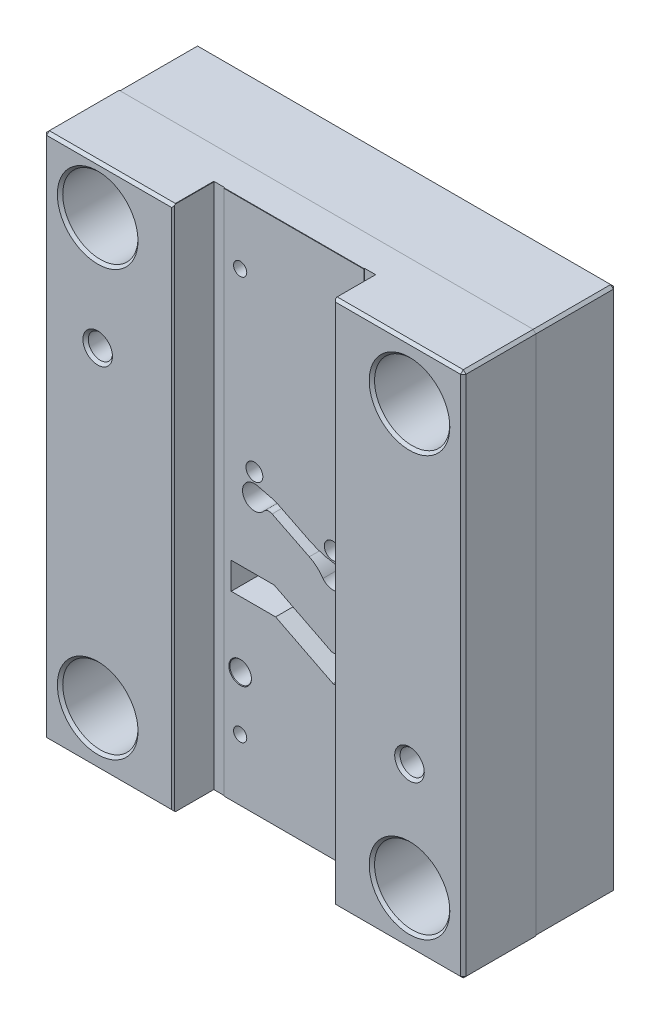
ISO-10303-21;
HEADER;
FILE_DESCRIPTION(('STEP AP214'),'2;1');
FILE_NAME('part.step','',(''),(''),'','','');
FILE_SCHEMA(('AUTOMOTIVE_DESIGN { 1 0 10303 214 1 1 1 1 }'));
ENDSEC;
DATA;
#1=APPLICATION_CONTEXT('core data for automotive mechanical design processes');
#2=APPLICATION_PROTOCOL_DEFINITION('international standard','automotive_design',2000,#1);
#3=PRODUCT_CONTEXT('',#1,'mechanical');
#4=PRODUCT('Part','Part','',(#3));
#5=PRODUCT_RELATED_PRODUCT_CATEGORY('part','',(#4));
#6=PRODUCT_DEFINITION_FORMATION('','',#4);
#7=PRODUCT_DEFINITION_CONTEXT('part definition',#1,'design');
#8=PRODUCT_DEFINITION('design','',#6,#7);
#9=PRODUCT_DEFINITION_SHAPE('','',#8);
#10=(LENGTH_UNIT() NAMED_UNIT(*) SI_UNIT(.MILLI.,.METRE.));
#11=(NAMED_UNIT(*) PLANE_ANGLE_UNIT() SI_UNIT($,.RADIAN.));
#12=(NAMED_UNIT(*) SI_UNIT($,.STERADIAN.) SOLID_ANGLE_UNIT());
#13=UNCERTAINTY_MEASURE_WITH_UNIT(LENGTH_MEASURE(1.E-05),#10,'distance_accuracy_value','');
#14=(GEOMETRIC_REPRESENTATION_CONTEXT(3) GLOBAL_UNCERTAINTY_ASSIGNED_CONTEXT((#13)) GLOBAL_UNIT_ASSIGNED_CONTEXT((#10,
#11,#12)) REPRESENTATION_CONTEXT('',''));
#15=CARTESIAN_POINT('',(0.,0.,0.));
#16=DIRECTION('',(0.,0.,1.));
#17=DIRECTION('',(1.,0.,0.));
#18=AXIS2_PLACEMENT_3D('',#15,#16,#17);
#19=CARTESIAN_POINT('',(58.0000000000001,23.0000000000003,26.0000000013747));
#20=DIRECTION('',(0.,0.,1.));
#21=DIRECTION('',(1.,0.,0.));
#22=AXIS2_PLACEMENT_3D('',#19,#20,#21);
#23=CONICAL_SURFACE('',#22,2.45849999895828,1.02974425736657);
#24=CARTESIAN_POINT('',(57.9999999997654,23.0000000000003,24.5227841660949));
#25=VERTEX_POINT('',#24);
#26=VERTEX_LOOP('',#25);
#27=FACE_BOUND('',#26,.T.);
#28=CARTESIAN_POINT('',(58.0000000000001,23.0000000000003,26.));
#29=DIRECTION('',(0.,0.,1.));
#30=DIRECTION('',(1.,0.,0.));
#31=AXIS2_PLACEMENT_3D('',#28,#29,#30);
#32=CIRCLE('',#31,2.4585);
#33=CARTESIAN_POINT('',(60.4585000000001,23.0000000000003,26.));
#34=VERTEX_POINT('',#33);
#35=EDGE_CURVE('E602',#34,#34,#32,.T.);
#36=ORIENTED_EDGE('',*,*,#35,.T.);
#37=EDGE_LOOP('',(#36));
#38=FACE_BOUND('',#37,.T.);
#39=ADVANCED_FACE('F17',(#27,#38),#23,.F.);
#40=CARTESIAN_POINT('',(99.0000000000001,161.,26.0000000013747));
#41=DIRECTION('',(0.,0.,1.));
#42=DIRECTION('',(1.,0.,0.));
#43=AXIS2_PLACEMENT_3D('',#40,#41,#42);
#44=CONICAL_SURFACE('',#43,2.45849999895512,1.02974425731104);
#45=CARTESIAN_POINT('',(98.9999999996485,161.,24.5227841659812));
#46=VERTEX_POINT('',#45);
#47=VERTEX_LOOP('',#46);
#48=FACE_BOUND('',#47,.T.);
#49=CARTESIAN_POINT('',(99.0000000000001,161.,26.));
#50=DIRECTION('',(0.,0.,1.));
#51=DIRECTION('',(1.,0.,0.));
#52=AXIS2_PLACEMENT_3D('',#49,#50,#51);
#53=CIRCLE('',#52,2.4585);
#54=CARTESIAN_POINT('',(101.4585,161.,26.));
#55=VERTEX_POINT('',#54);
#56=EDGE_CURVE('E597',#55,#55,#53,.T.);
#57=ORIENTED_EDGE('',*,*,#56,.T.);
#58=EDGE_LOOP('',(#57));
#59=FACE_BOUND('',#58,.T.);
#60=ADVANCED_FACE('F999',(#48,#59),#44,.F.);
#61=CARTESIAN_POINT('',(58.,173.,26.0000000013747));
#62=DIRECTION('',(0.,0.,1.));
#63=DIRECTION('',(1.,0.,0.));
#64=AXIS2_PLACEMENT_3D('',#61,#62,#63);
#65=CONICAL_SURFACE('',#64,2.45849999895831,1.02974425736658);
#66=CARTESIAN_POINT('',(57.9999999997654,173.,24.5227841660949));
#67=VERTEX_POINT('',#66);
#68=VERTEX_LOOP('',#67);
#69=FACE_BOUND('',#68,.T.);
#70=CARTESIAN_POINT('',(58.,173.,26.));
#71=DIRECTION('',(0.,0.,1.));
#72=DIRECTION('',(1.,0.,0.));
#73=AXIS2_PLACEMENT_3D('',#70,#71,#72);
#74=CIRCLE('',#73,2.4585);
#75=CARTESIAN_POINT('',(60.4585,173.,26.));
#76=VERTEX_POINT('',#75);
#77=EDGE_CURVE('E592',#76,#76,#74,.T.);
#78=ORIENTED_EDGE('',*,*,#77,.T.);
#79=EDGE_LOOP('',(#78));
#80=FACE_BOUND('',#79,.T.);
#81=ADVANCED_FACE('F1542',(#69,#80),#65,.F.);
#82=CARTESIAN_POINT('',(98.0000000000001,23.0000000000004,26.0000000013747));
#83=DIRECTION('',(0.,0.,1.));
#84=DIRECTION('',(1.,0.,0.));
#85=AXIS2_PLACEMENT_3D('',#82,#83,#84);
#86=CONICAL_SURFACE('',#85,2.45849999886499,1.02974425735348);
#87=CARTESIAN_POINT('',(97.9999999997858,23.0000000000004,24.5227841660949));
#88=VERTEX_POINT('',#87);
#89=VERTEX_LOOP('',#88);
#90=FACE_BOUND('',#89,.T.);
#91=CARTESIAN_POINT('',(98.0000000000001,23.0000000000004,26.));
#92=DIRECTION('',(0.,0.,1.));
#93=DIRECTION('',(1.,0.,0.));
#94=AXIS2_PLACEMENT_3D('',#91,#92,#93);
#95=CIRCLE('',#94,2.4585);
#96=CARTESIAN_POINT('',(100.4585,23.0000000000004,26.));
#97=VERTEX_POINT('',#96);
#98=EDGE_CURVE('E589',#97,#97,#95,.T.);
#99=ORIENTED_EDGE('',*,*,#98,.T.);
#100=EDGE_LOOP('',(#99));
#101=FACE_BOUND('',#100,.T.);
#102=ADVANCED_FACE('F1544',(#90,#101),#86,.F.);
#103=CARTESIAN_POINT('',(48.,196.,41.7));
#104=DIRECTION('',(-1.,0.,0.));
#105=DIRECTION('',(0.,0.,1.));
#106=AXIS2_PLACEMENT_3D('',#103,#104,#105);
#107=PLANE('',#106);
#108=DIRECTION('',(0.,0.707106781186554,0.707106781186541));
#109=VECTOR('',#108,1.);
#110=CARTESIAN_POINT('',(48.,0.100000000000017,56.1));
#111=LINE('',#110,#109);
#112=CARTESIAN_POINT('',(48.,0.100000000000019,56.1));
#113=VERTEX_POINT('',#112);
#114=CARTESIAN_POINT('',(48.,0.499999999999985,56.5));
#115=VERTEX_POINT('',#114);
#116=EDGE_CURVE('E687',#113,#115,#111,.T.);
#117=ORIENTED_EDGE('',*,*,#116,.F.);
#118=DIRECTION('',(0.,0.,1.));
#119=VECTOR('',#118,1.);
#120=CARTESIAN_POINT('',(48.,0.100000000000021,20.85));
#121=LINE('',#120,#119);
#122=CARTESIAN_POINT('',(48.,0.100000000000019,41.7));
#123=VERTEX_POINT('',#122);
#124=EDGE_CURVE('E666',#123,#113,#121,.T.);
#125=ORIENTED_EDGE('',*,*,#124,.F.);
#126=DIRECTION('',(0.,1.,0.));
#127=VECTOR('',#126,1.);
#128=CARTESIAN_POINT('',(48.,196.,41.7));
#129=LINE('',#128,#127);
#130=CARTESIAN_POINT('',(48.,195.9,41.7));
#131=VERTEX_POINT('',#130);
#132=EDGE_CURVE('E642',#123,#131,#129,.T.);
#133=ORIENTED_EDGE('',*,*,#132,.T.);
#134=DIRECTION('',(0.,0.,1.));
#135=VECTOR('',#134,1.);
#136=CARTESIAN_POINT('',(47.9999999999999,195.9,20.85));
#137=LINE('',#136,#135);
#138=CARTESIAN_POINT('',(48.,195.9,56.1000000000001));
#139=VERTEX_POINT('',#138);
#140=EDGE_CURVE('E675',#139,#131,#137,.F.);
#141=ORIENTED_EDGE('',*,*,#140,.F.);
#142=DIRECTION('',(0.,0.707106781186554,-0.707106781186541));
#143=VECTOR('',#142,1.);
#144=CARTESIAN_POINT('',(48.,195.5,56.5));
#145=LINE('',#144,#143);
#146=CARTESIAN_POINT('',(48.,195.5,56.5));
#147=VERTEX_POINT('',#146);
#148=EDGE_CURVE('E690',#147,#139,#145,.T.);
#149=ORIENTED_EDGE('',*,*,#148,.F.);
#150=DIRECTION('',(0.,1.,0.));
#151=VECTOR('',#150,1.);
#152=CARTESIAN_POINT('',(48.,147.,56.5));
#153=LINE('',#152,#151);
#154=EDGE_CURVE('E586',#115,#147,#153,.T.);
#155=ORIENTED_EDGE('',*,*,#154,.F.);
#156=EDGE_LOOP('',(#117,#125,#133,#141,#149,#155));
#157=FACE_BOUND('',#156,.T.);
#158=ADVANCED_FACE('F1551',(#157),#107,.F.);
#159=CARTESIAN_POINT('',(0.,195.,56.));
#160=DIRECTION('',(-0.577350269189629,0.57735026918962,0.577350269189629));
#161=DIRECTION('',(0.707106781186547,0.,0.707106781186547));
#162=AXIS2_PLACEMENT_3D('',#159,#160,#161);
#163=PLANE('',#162);
#164=DIRECTION('',(-0.707106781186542,-0.707106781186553,0.));
#165=VECTOR('',#164,1.);
#166=CARTESIAN_POINT('',(0.499999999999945,195.5,56.));
#167=LINE('',#166,#165);
#168=CARTESIAN_POINT('',(0.,195.,56.));
#169=VERTEX_POINT('',#168);
#170=CARTESIAN_POINT('',(0.999999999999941,196.,56.));
#171=VERTEX_POINT('',#170);
#172=EDGE_CURVE('E669',#169,#171,#167,.F.);
#173=ORIENTED_EDGE('',*,*,#172,.F.);
#174=DIRECTION('',(0.707106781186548,0.,0.707106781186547));
#175=VECTOR('',#174,1.);
#176=CARTESIAN_POINT('',(0.499999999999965,195.,56.5));
#177=LINE('',#176,#175);
#178=CARTESIAN_POINT('',(0.999999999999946,195.,57.));
#179=VERTEX_POINT('',#178);
#180=EDGE_CURVE('E574',#179,#169,#177,.F.);
#181=ORIENTED_EDGE('',*,*,#180,.F.);
#182=DIRECTION('',(0.,-0.707106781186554,0.707106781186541));
#183=VECTOR('',#182,1.);
#184=CARTESIAN_POINT('',(0.999999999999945,195.5,56.5));
#185=LINE('',#184,#183);
#186=EDGE_CURVE('E577',#171,#179,#185,.T.);
#187=ORIENTED_EDGE('',*,*,#186,.F.);
#188=EDGE_LOOP('',(#173,#181,#187));
#189=FACE_BOUND('',#188,.T.);
#190=ADVANCED_FACE('F1557',(#189),#163,.T.);
#191=CARTESIAN_POINT('',(0.499999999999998,0.499999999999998,56.));
#192=DIRECTION('',(-0.577350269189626,-0.577350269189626,0.577350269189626));
#193=DIRECTION('',(0.,-0.707106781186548,-0.707106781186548));
#194=AXIS2_PLACEMENT_3D('',#191,#192,#193);
#195=PLANE('',#194);
#196=DIRECTION('',(0.707106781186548,0.,0.707106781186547));
#197=VECTOR('',#196,1.);
#198=CARTESIAN_POINT('',(0.499999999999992,0.999999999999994,56.5));
#199=LINE('',#198,#197);
#200=CARTESIAN_POINT('',(0.,0.999999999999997,56.));
#201=VERTEX_POINT('',#200);
#202=CARTESIAN_POINT('',(0.999999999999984,0.999999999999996,57.));
#203=VERTEX_POINT('',#202);
#204=EDGE_CURVE('E571',#201,#203,#199,.T.);
#205=ORIENTED_EDGE('',*,*,#204,.F.);
#206=DIRECTION('',(0.707106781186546,-0.707106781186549,0.));
#207=VECTOR('',#206,1.);
#208=CARTESIAN_POINT('',(0.499999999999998,0.5,56.));
#209=LINE('',#208,#207);
#210=CARTESIAN_POINT('',(0.999999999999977,0.,56.));
#211=VERTEX_POINT('',#210);
#212=EDGE_CURVE('E660',#211,#201,#209,.F.);
#213=ORIENTED_EDGE('',*,*,#212,.F.);
#214=DIRECTION('',(0.,-0.707106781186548,-0.707106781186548));
#215=VECTOR('',#214,1.);
#216=CARTESIAN_POINT('',(0.999999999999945,0.499999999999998,56.5));
#217=LINE('',#216,#215);
#218=EDGE_CURVE('E565',#203,#211,#217,.T.);
#219=ORIENTED_EDGE('',*,*,#218,.F.);
#220=EDGE_LOOP('',(#205,#213,#219));
#221=FACE_BOUND('',#220,.T.);
#222=ADVANCED_FACE('F1561',(#221),#195,.T.);
#223=CARTESIAN_POINT('',(108.,196.,57.));
#224=DIRECTION('',(1.,0.,0.));
#225=DIRECTION('',(0.,0.,-1.));
#226=AXIS2_PLACEMENT_3D('',#223,#224,#225);
#227=PLANE('',#226);
#228=DIRECTION('',(0.,-0.707106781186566,0.707106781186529));
#229=VECTOR('',#228,1.);
#230=CARTESIAN_POINT('',(108.,195.9,56.1000000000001));
#231=LINE('',#230,#229);
#232=CARTESIAN_POINT('',(108.,195.9,56.1000000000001));
#233=VERTEX_POINT('',#232);
#234=CARTESIAN_POINT('',(108.,195.5,56.5));
#235=VERTEX_POINT('',#234);
#236=EDGE_CURVE('E681',#233,#235,#231,.T.);
#237=ORIENTED_EDGE('',*,*,#236,.F.);
#238=DIRECTION('',(0.,0.,1.));
#239=VECTOR('',#238,1.);
#240=CARTESIAN_POINT('',(108.,195.9,28.5));
#241=LINE('',#240,#239);
#242=CARTESIAN_POINT('',(108.,195.9,41.7));
#243=VERTEX_POINT('',#242);
#244=EDGE_CURVE('E678',#243,#233,#241,.T.);
#245=ORIENTED_EDGE('',*,*,#244,.F.);
#246=DIRECTION('',(0.,1.,0.));
#247=VECTOR('',#246,1.);
#248=CARTESIAN_POINT('',(108.,196.,41.7));
#249=LINE('',#248,#247);
#250=CARTESIAN_POINT('',(108.,0.100000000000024,41.7));
#251=VERTEX_POINT('',#250);
#252=EDGE_CURVE('E651',#243,#251,#249,.F.);
#253=ORIENTED_EDGE('',*,*,#252,.T.);
#254=DIRECTION('',(0.,0.,1.));
#255=VECTOR('',#254,1.);
#256=CARTESIAN_POINT('',(108.,0.100000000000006,28.5));
#257=LINE('',#256,#255);
#258=CARTESIAN_POINT('',(108.,0.100000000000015,56.1));
#259=VERTEX_POINT('',#258);
#260=EDGE_CURVE('E657',#259,#251,#257,.F.);
#261=ORIENTED_EDGE('',*,*,#260,.F.);
#262=DIRECTION('',(0.,-0.707106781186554,-0.707106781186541));
#263=VECTOR('',#262,1.);
#264=CARTESIAN_POINT('',(108.,0.5,56.5));
#265=LINE('',#264,#263);
#266=CARTESIAN_POINT('',(108.,0.5,56.5));
#267=VERTEX_POINT('',#266);
#268=EDGE_CURVE('E684',#267,#259,#265,.T.);
#269=ORIENTED_EDGE('',*,*,#268,.F.);
#270=DIRECTION('',(0.,1.,0.));
#271=VECTOR('',#270,1.);
#272=CARTESIAN_POINT('',(108.,147.,56.5));
#273=LINE('',#272,#271);
#274=EDGE_CURVE('E554',#235,#267,#273,.F.);
#275=ORIENTED_EDGE('',*,*,#274,.F.);
#276=EDGE_LOOP('',(#237,#245,#253,#261,#269,#275));
#277=FACE_BOUND('',#276,.T.);
#278=ADVANCED_FACE('F1565',(#277),#227,.F.);
#279=CARTESIAN_POINT('',(155.5,0.500000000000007,56.));
#280=DIRECTION('',(0.577350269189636,-0.577350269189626,0.577350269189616));
#281=DIRECTION('',(0.707106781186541,0.707106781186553,0.));
#282=AXIS2_PLACEMENT_3D('',#279,#280,#281);
#283=PLANE('',#282);
#284=DIRECTION('',(0.707106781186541,0.,-0.707106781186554));
#285=VECTOR('',#284,1.);
#286=CARTESIAN_POINT('',(155.5,1.,56.5));
#287=LINE('',#286,#285);
#288=CARTESIAN_POINT('',(155.,1.,57.));
#289=VERTEX_POINT('',#288);
#290=CARTESIAN_POINT('',(156.,1.00000000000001,56.));
#291=VERTEX_POINT('',#290);
#292=EDGE_CURVE('E542',#289,#291,#287,.T.);
#293=ORIENTED_EDGE('',*,*,#292,.F.);
#294=DIRECTION('',(0.,-0.707106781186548,-0.707106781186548));
#295=VECTOR('',#294,1.);
#296=CARTESIAN_POINT('',(155.,0.499999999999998,56.5));
#297=LINE('',#296,#295);
#298=CARTESIAN_POINT('',(155.,0.,56.));
#299=VERTEX_POINT('',#298);
#300=EDGE_CURVE('E545',#299,#289,#297,.F.);
#301=ORIENTED_EDGE('',*,*,#300,.F.);
#302=DIRECTION('',(0.707106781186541,0.707106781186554,0.));
#303=VECTOR('',#302,1.);
#304=CARTESIAN_POINT('',(155.5,0.500000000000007,56.));
#305=LINE('',#304,#303);
#306=EDGE_CURVE('E627',#291,#299,#305,.F.);
#307=ORIENTED_EDGE('',*,*,#306,.F.);
#308=EDGE_LOOP('',(#293,#301,#307));
#309=FACE_BOUND('',#308,.T.);
#310=ADVANCED_FACE('F1569',(#309),#283,.T.);
#311=CARTESIAN_POINT('',(155.5,195.5,56.));
#312=DIRECTION('',(0.577350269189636,0.577350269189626,0.577350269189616));
#313=DIRECTION('',(-0.707106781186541,0.707106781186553,0.));
#314=AXIS2_PLACEMENT_3D('',#311,#312,#313);
#315=PLANE('',#314);
#316=DIRECTION('',(0.,-0.707106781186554,0.707106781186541));
#317=VECTOR('',#316,1.);
#318=CARTESIAN_POINT('',(155.,195.5,56.5));
#319=LINE('',#318,#317);
#320=CARTESIAN_POINT('',(155.,195.,57.));
#321=VERTEX_POINT('',#320);
#322=CARTESIAN_POINT('',(155.,196.,56.));
#323=VERTEX_POINT('',#322);
#324=EDGE_CURVE('E533',#321,#323,#319,.F.);
#325=ORIENTED_EDGE('',*,*,#324,.F.);
#326=DIRECTION('',(0.707106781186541,0.,-0.707106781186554));
#327=VECTOR('',#326,1.);
#328=CARTESIAN_POINT('',(155.5,195.,56.5));
#329=LINE('',#328,#327);
#330=CARTESIAN_POINT('',(156.,195.,56.));
#331=VERTEX_POINT('',#330);
#332=EDGE_CURVE('E539',#331,#321,#329,.F.);
#333=ORIENTED_EDGE('',*,*,#332,.F.);
#334=DIRECTION('',(-0.707106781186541,0.707106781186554,0.));
#335=VECTOR('',#334,1.);
#336=CARTESIAN_POINT('',(155.5,195.5,56.));
#337=LINE('',#336,#335);
#338=EDGE_CURVE('E633',#323,#331,#337,.F.);
#339=ORIENTED_EDGE('',*,*,#338,.F.);
#340=EDGE_LOOP('',(#325,#333,#339));
#341=FACE_BOUND('',#340,.T.);
#342=ADVANCED_FACE('F1573',(#341),#315,.T.);
#343=CARTESIAN_POINT('',(108.05,195.95,28.5));
#344=DIRECTION('',(-0.707106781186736,0.707106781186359,0.));
#345=DIRECTION('',(-0.707106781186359,-0.707106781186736,0.));
#346=AXIS2_PLACEMENT_3D('',#343,#344,#345);
#347=PLANE('',#346);
#348=DIRECTION('',(-0.707106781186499,-0.707106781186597,0.));
#349=VECTOR('',#348,1.);
#350=CARTESIAN_POINT('',(108.1,196.,41.7));
#351=LINE('',#350,#349);
#352=CARTESIAN_POINT('',(108.1,196.,41.7));
#353=VERTEX_POINT('',#352);
#354=EDGE_CURVE('E654',#353,#243,#351,.T.);
#355=ORIENTED_EDGE('',*,*,#354,.T.);
#356=ORIENTED_EDGE('',*,*,#244,.T.);
#357=DIRECTION('',(-0.577350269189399,-0.577350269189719,0.577350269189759));
#358=VECTOR('',#357,1.);
#359=CARTESIAN_POINT('',(108.1,196.,56.));
#360=LINE('',#359,#358);
#361=CARTESIAN_POINT('',(108.1,196.,56.));
#362=VERTEX_POINT('',#361);
#363=EDGE_CURVE('E528',#362,#233,#360,.T.);
#364=ORIENTED_EDGE('',*,*,#363,.F.);
#365=DIRECTION('',(0.,0.,1.));
#366=VECTOR('',#365,1.);
#367=CARTESIAN_POINT('',(108.1,196.,0.));
#368=LINE('',#367,#366);
#369=EDGE_CURVE('E522',#353,#362,#368,.T.);
#370=ORIENTED_EDGE('',*,*,#369,.F.);
#371=EDGE_LOOP('',(#355,#356,#364,#370));
#372=FACE_BOUND('',#371,.T.);
#373=ADVANCED_FACE('F1577',(#372),#347,.T.);
#374=CARTESIAN_POINT('',(47.95,195.95,20.85));
#375=DIRECTION('',(0.707106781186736,0.707106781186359,0.));
#376=DIRECTION('',(-0.707106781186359,0.707106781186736,0.));
#377=AXIS2_PLACEMENT_3D('',#374,#375,#376);
#378=PLANE('',#377);
#379=DIRECTION('',(-0.707106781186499,0.707106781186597,0.));
#380=VECTOR('',#379,1.);
#381=CARTESIAN_POINT('',(48.,195.9,41.7));
#382=LINE('',#381,#380);
#383=CARTESIAN_POINT('',(47.9,196.,41.7));
#384=VERTEX_POINT('',#383);
#385=EDGE_CURVE('E639',#131,#384,#382,.T.);
#386=ORIENTED_EDGE('',*,*,#385,.T.);
#387=DIRECTION('',(0.,0.,1.));
#388=VECTOR('',#387,1.);
#389=CARTESIAN_POINT('',(47.9,196.,0.));
#390=LINE('',#389,#388);
#391=CARTESIAN_POINT('',(47.9,196.,56.));
#392=VERTEX_POINT('',#391);
#393=EDGE_CURVE('E507',#392,#384,#390,.F.);
#394=ORIENTED_EDGE('',*,*,#393,.F.);
#395=DIRECTION('',(-0.577350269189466,0.577350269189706,-0.577350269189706));
#396=VECTOR('',#395,1.);
#397=CARTESIAN_POINT('',(48.,195.9,56.1000000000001));
#398=LINE('',#397,#396);
#399=EDGE_CURVE('E580',#139,#392,#398,.T.);
#400=ORIENTED_EDGE('',*,*,#399,.F.);
#401=ORIENTED_EDGE('',*,*,#140,.T.);
#402=EDGE_LOOP('',(#386,#394,#400,#401));
#403=FACE_BOUND('',#402,.T.);
#404=ADVANCED_FACE('F1581',(#403),#378,.T.);
#405=CARTESIAN_POINT('',(0.499999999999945,195.5,0.));
#406=DIRECTION('',(-0.707106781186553,0.707106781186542,0.));
#407=DIRECTION('',(-0.707106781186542,-0.707106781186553,0.));
#408=AXIS2_PLACEMENT_3D('',#405,#406,#407);
#409=PLANE('',#408);
#410=ORIENTED_EDGE('',*,*,#172,.T.);
#411=DIRECTION('',(0.,0.,1.));
#412=VECTOR('',#411,1.);
#413=CARTESIAN_POINT('',(0.999999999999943,196.,0.));
#414=LINE('',#413,#412);
#415=CARTESIAN_POINT('',(0.999999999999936,196.,30.));
#416=VERTEX_POINT('',#415);
#417=EDGE_CURVE('E513',#416,#171,#414,.T.);
#418=ORIENTED_EDGE('',*,*,#417,.F.);
#419=DIRECTION('',(-0.707106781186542,-0.707106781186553,0.));
#420=VECTOR('',#419,1.);
#421=CARTESIAN_POINT('',(0.499999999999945,195.5,30.));
#422=LINE('',#421,#420);
#423=CARTESIAN_POINT('',(0.,195.,30.));
#424=VERTEX_POINT('',#423);
#425=EDGE_CURVE('E672',#416,#424,#422,.T.);
#426=ORIENTED_EDGE('',*,*,#425,.T.);
#427=DIRECTION('',(0.,0.,1.));
#428=VECTOR('',#427,1.);
#429=CARTESIAN_POINT('',(0.,195.,0.));
#430=LINE('',#429,#428);
#431=EDGE_CURVE('E489',#169,#424,#430,.F.);
#432=ORIENTED_EDGE('',*,*,#431,.F.);
#433=EDGE_LOOP('',(#410,#418,#426,#432));
#434=FACE_BOUND('',#433,.T.);
#435=ADVANCED_FACE('F1585',(#434),#409,.T.);
#436=CARTESIAN_POINT('',(47.95,0.050000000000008,20.85));
#437=DIRECTION('',(0.707106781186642,-0.707106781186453,0.));
#438=DIRECTION('',(0.707106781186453,0.707106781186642,0.));
#439=AXIS2_PLACEMENT_3D('',#436,#437,#438);
#440=PLANE('',#439);
#441=DIRECTION('',(0.707106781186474,0.707106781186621,0.));
#442=VECTOR('',#441,1.);
#443=CARTESIAN_POINT('',(47.9,0.,41.7));
#444=LINE('',#443,#442);
#445=CARTESIAN_POINT('',(47.9,0.,41.7));
#446=VERTEX_POINT('',#445);
#447=EDGE_CURVE('E645',#446,#123,#444,.T.);
#448=ORIENTED_EDGE('',*,*,#447,.T.);
#449=ORIENTED_EDGE('',*,*,#124,.T.);
#450=DIRECTION('',(0.577350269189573,0.577350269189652,0.577350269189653));
#451=VECTOR('',#450,1.);
#452=CARTESIAN_POINT('',(47.8999999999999,0.,56.));
#453=LINE('',#452,#451);
#454=CARTESIAN_POINT('',(47.9,0.,56.));
#455=VERTEX_POINT('',#454);
#456=EDGE_CURVE('E560',#455,#113,#453,.T.);
#457=ORIENTED_EDGE('',*,*,#456,.F.);
#458=DIRECTION('',(0.,0.,-1.));
#459=VECTOR('',#458,1.);
#460=CARTESIAN_POINT('',(47.9,0.,0.));
#461=LINE('',#460,#459);
#462=EDGE_CURVE('E480',#446,#455,#461,.F.);
#463=ORIENTED_EDGE('',*,*,#462,.F.);
#464=EDGE_LOOP('',(#448,#449,#457,#463));
#465=FACE_BOUND('',#464,.T.);
#466=ADVANCED_FACE('F1589',(#465),#440,.T.);
#467=CARTESIAN_POINT('',(0.499999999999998,0.5,0.));
#468=DIRECTION('',(-0.707106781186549,-0.707106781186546,0.));
#469=DIRECTION('',(0.707106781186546,-0.707106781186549,0.));
#470=AXIS2_PLACEMENT_3D('',#467,#468,#469);
#471=PLANE('',#470);
#472=ORIENTED_EDGE('',*,*,#212,.T.);
#473=DIRECTION('',(0.,0.,1.));
#474=VECTOR('',#473,1.);
#475=CARTESIAN_POINT('',(0.,0.999999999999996,0.));
#476=LINE('',#475,#474);
#477=CARTESIAN_POINT('',(0.,1.,30.));
#478=VERTEX_POINT('',#477);
#479=EDGE_CURVE('E486',#478,#201,#476,.T.);
#480=ORIENTED_EDGE('',*,*,#479,.F.);
#481=DIRECTION('',(0.707106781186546,-0.707106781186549,0.));
#482=VECTOR('',#481,1.);
#483=CARTESIAN_POINT('',(0.499999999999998,0.5,30.));
#484=LINE('',#483,#482);
#485=CARTESIAN_POINT('',(0.999999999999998,0.,30.));
#486=VERTEX_POINT('',#485);
#487=EDGE_CURVE('E663',#478,#486,#484,.T.);
#488=ORIENTED_EDGE('',*,*,#487,.T.);
#489=DIRECTION('',(0.,0.,-1.));
#490=VECTOR('',#489,1.);
#491=CARTESIAN_POINT('',(1.,0.,0.));
#492=LINE('',#491,#490);
#493=EDGE_CURVE('E474',#211,#486,#492,.T.);
#494=ORIENTED_EDGE('',*,*,#493,.F.);
#495=EDGE_LOOP('',(#472,#480,#488,#494));
#496=FACE_BOUND('',#495,.T.);
#497=ADVANCED_FACE('F1593',(#496),#471,.T.);
#498=CARTESIAN_POINT('',(108.05,0.050000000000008,28.5));
#499=DIRECTION('',(-0.707106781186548,-0.707106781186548,0.));
#500=DIRECTION('',(0.707106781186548,-0.707106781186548,0.));
#501=AXIS2_PLACEMENT_3D('',#498,#499,#500);
#502=PLANE('',#501);
#503=DIRECTION('',(0.707106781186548,-0.707106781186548,0.));
#504=VECTOR('',#503,1.);
#505=CARTESIAN_POINT('',(108.,0.100000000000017,41.7));
#506=LINE('',#505,#504);
#507=CARTESIAN_POINT('',(108.1,0.,41.7));
#508=VERTEX_POINT('',#507);
#509=EDGE_CURVE('E648',#251,#508,#506,.T.);
#510=ORIENTED_EDGE('',*,*,#509,.T.);
#511=DIRECTION('',(0.,0.,-1.));
#512=VECTOR('',#511,1.);
#513=CARTESIAN_POINT('',(108.1,0.,0.));
#514=LINE('',#513,#512);
#515=CARTESIAN_POINT('',(108.1,0.,56.));
#516=VERTEX_POINT('',#515);
#517=EDGE_CURVE('E465',#516,#508,#514,.T.);
#518=ORIENTED_EDGE('',*,*,#517,.F.);
#519=DIRECTION('',(0.577350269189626,-0.577350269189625,-0.577350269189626));
#520=VECTOR('',#519,1.);
#521=CARTESIAN_POINT('',(108.,0.10000000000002,56.1));
#522=LINE('',#521,#520);
#523=EDGE_CURVE('E548',#259,#516,#522,.T.);
#524=ORIENTED_EDGE('',*,*,#523,.F.);
#525=ORIENTED_EDGE('',*,*,#260,.T.);
#526=EDGE_LOOP('',(#510,#518,#524,#525));
#527=FACE_BOUND('',#526,.T.);
#528=ADVANCED_FACE('F1597',(#527),#502,.T.);
#529=CARTESIAN_POINT('',(108.,196.,41.7));
#530=DIRECTION('',(0.,0.,-1.));
#531=DIRECTION('',(-1.,0.,0.));
#532=AXIS2_PLACEMENT_3D('',#529,#530,#531);
#533=PLANE('',#532);
#534=ORIENTED_EDGE('',*,*,#509,.F.);
#535=ORIENTED_EDGE('',*,*,#252,.F.);
#536=ORIENTED_EDGE('',*,*,#354,.F.);
#537=DIRECTION('',(1.,0.,0.));
#538=VECTOR('',#537,1.);
#539=CARTESIAN_POINT('',(0.,196.,41.7));
#540=LINE('',#539,#538);
#541=CARTESIAN_POINT('',(104.,196.,41.7));
#542=VERTEX_POINT('',#541);
#543=EDGE_CURVE('E492',#542,#353,#540,.T.);
#544=ORIENTED_EDGE('',*,*,#543,.F.);
#545=DIRECTION('',(0.,1.,0.));
#546=VECTOR('',#545,1.);
#547=CARTESIAN_POINT('',(104.,196.,41.7));
#548=LINE('',#547,#546);
#549=CARTESIAN_POINT('',(104.,0.,41.7));
#550=VERTEX_POINT('',#549);
#551=EDGE_CURVE('E624',#542,#550,#548,.F.);
#552=ORIENTED_EDGE('',*,*,#551,.T.);
#553=DIRECTION('',(1.,0.,0.));
#554=VECTOR('',#553,1.);
#555=CARTESIAN_POINT('',(156.,0.,41.7));
#556=LINE('',#555,#554);
#557=EDGE_CURVE('E462',#508,#550,#556,.F.);
#558=ORIENTED_EDGE('',*,*,#557,.F.);
#559=EDGE_LOOP('',(#534,#535,#536,#544,#552,#558));
#560=FACE_BOUND('',#559,.T.);
#561=ADVANCED_FACE('F1601',(#560),#533,.F.);
#562=CARTESIAN_POINT('',(52.,196.,41.7));
#563=DIRECTION('',(0.,0.,-1.));
#564=DIRECTION('',(-1.,0.,0.));
#565=AXIS2_PLACEMENT_3D('',#562,#563,#564);
#566=PLANE('',#565);
#567=DIRECTION('',(0.,1.,0.));
#568=VECTOR('',#567,1.);
#569=CARTESIAN_POINT('',(52.,196.,41.7));
#570=LINE('',#569,#568);
#571=CARTESIAN_POINT('',(52.,0.,41.7));
#572=VERTEX_POINT('',#571);
#573=CARTESIAN_POINT('',(52.,196.,41.7));
#574=VERTEX_POINT('',#573);
#575=EDGE_CURVE('E615',#572,#574,#570,.T.);
#576=ORIENTED_EDGE('',*,*,#575,.T.);
#577=DIRECTION('',(1.,0.,0.));
#578=VECTOR('',#577,1.);
#579=CARTESIAN_POINT('',(0.,196.,41.7));
#580=LINE('',#579,#578);
#581=EDGE_CURVE('E504',#384,#574,#580,.T.);
#582=ORIENTED_EDGE('',*,*,#581,.F.);
#583=ORIENTED_EDGE('',*,*,#385,.F.);
#584=ORIENTED_EDGE('',*,*,#132,.F.);
#585=ORIENTED_EDGE('',*,*,#447,.F.);
#586=DIRECTION('',(1.,0.,0.));
#587=VECTOR('',#586,1.);
#588=CARTESIAN_POINT('',(156.,0.,41.7));
#589=LINE('',#588,#587);
#590=EDGE_CURVE('E450',#572,#446,#589,.F.);
#591=ORIENTED_EDGE('',*,*,#590,.F.);
#592=EDGE_LOOP('',(#576,#582,#583,#584,#585,#591));
#593=FACE_BOUND('',#592,.T.);
#594=ADVANCED_FACE('F1605',(#593),#566,.F.);
#595=CARTESIAN_POINT('',(155.5,195.5,0.));
#596=DIRECTION('',(0.707106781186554,0.707106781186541,0.));
#597=DIRECTION('',(-0.707106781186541,0.707106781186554,0.));
#598=AXIS2_PLACEMENT_3D('',#595,#596,#597);
#599=PLANE('',#598);
#600=ORIENTED_EDGE('',*,*,#338,.T.);
#601=DIRECTION('',(0.,0.,-1.));
#602=VECTOR('',#601,1.);
#603=CARTESIAN_POINT('',(156.,195.,0.));
#604=LINE('',#603,#602);
#605=CARTESIAN_POINT('',(156.,195.,30.));
#606=VERTEX_POINT('',#605);
#607=EDGE_CURVE('E447',#606,#331,#604,.F.);
#608=ORIENTED_EDGE('',*,*,#607,.F.);
#609=DIRECTION('',(-0.707106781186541,0.707106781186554,0.));
#610=VECTOR('',#609,1.);
#611=CARTESIAN_POINT('',(155.5,195.5,30.));
#612=LINE('',#611,#610);
#613=CARTESIAN_POINT('',(155.,196.,30.));
#614=VERTEX_POINT('',#613);
#615=EDGE_CURVE('E636',#606,#614,#612,.T.);
#616=ORIENTED_EDGE('',*,*,#615,.T.);
#617=DIRECTION('',(0.,0.,1.));
#618=VECTOR('',#617,1.);
#619=CARTESIAN_POINT('',(155.,196.,0.));
#620=LINE('',#619,#618);
#621=EDGE_CURVE('E516',#323,#614,#620,.F.);
#622=ORIENTED_EDGE('',*,*,#621,.F.);
#623=EDGE_LOOP('',(#600,#608,#616,#622));
#624=FACE_BOUND('',#623,.T.);
#625=ADVANCED_FACE('F1609',(#624),#599,.T.);
#626=CARTESIAN_POINT('',(155.5,0.500000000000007,0.));
#627=DIRECTION('',(0.707106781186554,-0.707106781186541,0.));
#628=DIRECTION('',(0.707106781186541,0.707106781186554,0.));
#629=AXIS2_PLACEMENT_3D('',#626,#627,#628);
#630=PLANE('',#629);
#631=ORIENTED_EDGE('',*,*,#306,.T.);
#632=DIRECTION('',(0.,0.,-1.));
#633=VECTOR('',#632,1.);
#634=CARTESIAN_POINT('',(155.,0.,0.));
#635=LINE('',#634,#633);
#636=CARTESIAN_POINT('',(155.,0.,30.));
#637=VERTEX_POINT('',#636);
#638=EDGE_CURVE('E471',#637,#299,#635,.F.);
#639=ORIENTED_EDGE('',*,*,#638,.F.);
#640=DIRECTION('',(0.707106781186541,0.707106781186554,0.));
#641=VECTOR('',#640,1.);
#642=CARTESIAN_POINT('',(155.5,0.500000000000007,30.));
#643=LINE('',#642,#641);
#644=CARTESIAN_POINT('',(156.,1.00000000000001,30.));
#645=VERTEX_POINT('',#644);
#646=EDGE_CURVE('E630',#637,#645,#643,.T.);
#647=ORIENTED_EDGE('',*,*,#646,.T.);
#648=DIRECTION('',(0.,0.,-1.));
#649=VECTOR('',#648,1.);
#650=CARTESIAN_POINT('',(156.,1.,0.));
#651=LINE('',#650,#649);
#652=EDGE_CURVE('E207',#291,#645,#651,.T.);
#653=ORIENTED_EDGE('',*,*,#652,.F.);
#654=EDGE_LOOP('',(#631,#639,#647,#653));
#655=FACE_BOUND('',#654,.T.);
#656=ADVANCED_FACE('F1613',(#655),#630,.T.);
#657=CARTESIAN_POINT('',(104.,196.,41.7));
#658=DIRECTION('',(-1.,0.,0.));
#659=DIRECTION('',(0.,0.,1.));
#660=AXIS2_PLACEMENT_3D('',#657,#658,#659);
#661=PLANE('',#660);
#662=DIRECTION('',(0.,1.,0.));
#663=VECTOR('',#662,1.);
#664=CARTESIAN_POINT('',(104.,196.,42.));
#665=LINE('',#664,#663);
#666=CARTESIAN_POINT('',(104.,195.9,42.));
#667=VERTEX_POINT('',#666);
#668=CARTESIAN_POINT('',(104.,0.100000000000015,42.));
#669=VERTEX_POINT('',#668);
#670=EDGE_CURVE('E206',#667,#669,#665,.F.);
#671=ORIENTED_EDGE('',*,*,#670,.T.);
#672=DIRECTION('',(0.,-0.70710678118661,-0.707106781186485));
#673=VECTOR('',#672,1.);
#674=CARTESIAN_POINT('',(104.,0.0500000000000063,41.95));
#675=LINE('',#674,#673);
#676=CARTESIAN_POINT('',(104.,0.,41.9));
#677=VERTEX_POINT('',#676);
#678=EDGE_CURVE('E621',#677,#669,#675,.F.);
#679=ORIENTED_EDGE('',*,*,#678,.F.);
#680=DIRECTION('',(0.,0.,-1.));
#681=VECTOR('',#680,1.);
#682=CARTESIAN_POINT('',(104.,0.,0.));
#683=LINE('',#682,#681);
#684=EDGE_CURVE('E459',#550,#677,#683,.F.);
#685=ORIENTED_EDGE('',*,*,#684,.F.);
#686=ORIENTED_EDGE('',*,*,#551,.F.);
#687=DIRECTION('',(0.,0.,1.));
#688=VECTOR('',#687,1.);
#689=CARTESIAN_POINT('',(104.,196.,0.));
#690=LINE('',#689,#688);
#691=CARTESIAN_POINT('',(104.,196.,41.9));
#692=VERTEX_POINT('',#691);
#693=EDGE_CURVE('E495',#692,#542,#690,.F.);
#694=ORIENTED_EDGE('',*,*,#693,.F.);
#695=DIRECTION('',(0.,-0.707106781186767,0.707106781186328));
#696=VECTOR('',#695,1.);
#697=CARTESIAN_POINT('',(104.,195.95,41.95));
#698=LINE('',#697,#696);
#699=EDGE_CURVE('E612',#667,#692,#698,.F.);
#700=ORIENTED_EDGE('',*,*,#699,.F.);
#701=EDGE_LOOP('',(#671,#679,#685,#686,#694,#700));
#702=FACE_BOUND('',#701,.T.);
#703=ADVANCED_FACE('F908',(#702),#661,.F.);
#704=CARTESIAN_POINT('',(130.,0.050000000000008,41.95));
#705=DIRECTION('',(0.,-0.707106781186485,0.70710678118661));
#706=DIRECTION('',(0.,-0.70710678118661,-0.707106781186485));
#707=AXIS2_PLACEMENT_3D('',#704,#705,#706);
#708=PLANE('',#707);
#709=ORIENTED_EDGE('',*,*,#678,.T.);
#710=DIRECTION('',(-1.,0.,0.));
#711=VECTOR('',#710,1.);
#712=CARTESIAN_POINT('',(104.,0.100000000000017,42.));
#713=LINE('',#712,#711);
#714=CARTESIAN_POINT('',(51.9999999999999,0.0999999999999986,42.));
#715=VERTEX_POINT('',#714);
#716=EDGE_CURVE('E432',#669,#715,#713,.T.);
#717=ORIENTED_EDGE('',*,*,#716,.T.);
#718=DIRECTION('',(0.,-0.707106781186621,-0.707106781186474));
#719=VECTOR('',#718,1.);
#720=CARTESIAN_POINT('',(52.,0.100000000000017,42.));
#721=LINE('',#720,#719);
#722=CARTESIAN_POINT('',(51.9999999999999,0.,41.9));
#723=VERTEX_POINT('',#722);
#724=EDGE_CURVE('E618',#715,#723,#721,.T.);
#725=ORIENTED_EDGE('',*,*,#724,.T.);
#726=DIRECTION('',(1.,0.,0.));
#727=VECTOR('',#726,1.);
#728=CARTESIAN_POINT('',(156.,0.,41.9));
#729=LINE('',#728,#727);
#730=EDGE_CURVE('E456',#677,#723,#729,.F.);
#731=ORIENTED_EDGE('',*,*,#730,.F.);
#732=EDGE_LOOP('',(#709,#717,#725,#731));
#733=FACE_BOUND('',#732,.T.);
#734=ADVANCED_FACE('F898',(#733),#708,.T.);
#735=CARTESIAN_POINT('',(52.,196.,42.));
#736=DIRECTION('',(1.,0.,0.));
#737=DIRECTION('',(0.,0.,-1.));
#738=AXIS2_PLACEMENT_3D('',#735,#736,#737);
#739=PLANE('',#738);
#740=DIRECTION('',(0.,0.,1.));
#741=VECTOR('',#740,1.);
#742=CARTESIAN_POINT('',(52.,196.,0.));
#743=LINE('',#742,#741);
#744=CARTESIAN_POINT('',(52.,196.,41.9));
#745=VERTEX_POINT('',#744);
#746=EDGE_CURVE('E501',#574,#745,#743,.T.);
#747=ORIENTED_EDGE('',*,*,#746,.F.);
#748=ORIENTED_EDGE('',*,*,#575,.F.);
#749=DIRECTION('',(0.,0.,-1.));
#750=VECTOR('',#749,1.);
#751=CARTESIAN_POINT('',(52.,0.,0.));
#752=LINE('',#751,#750);
#753=EDGE_CURVE('E453',#723,#572,#752,.T.);
#754=ORIENTED_EDGE('',*,*,#753,.F.);
#755=ORIENTED_EDGE('',*,*,#724,.F.);
#756=DIRECTION('',(0.,1.,0.));
#757=VECTOR('',#756,1.);
#758=CARTESIAN_POINT('',(52.,196.,42.));
#759=LINE('',#758,#757);
#760=CARTESIAN_POINT('',(52.,195.9,42.));
#761=VERTEX_POINT('',#760);
#762=EDGE_CURVE('E429',#715,#761,#759,.T.);
#763=ORIENTED_EDGE('',*,*,#762,.T.);
#764=DIRECTION('',(0.,-0.707106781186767,0.707106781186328));
#765=VECTOR('',#764,1.);
#766=CARTESIAN_POINT('',(52.,195.95,41.95));
#767=LINE('',#766,#765);
#768=EDGE_CURVE('E607',#745,#761,#767,.T.);
#769=ORIENTED_EDGE('',*,*,#768,.F.);
#770=EDGE_LOOP('',(#747,#748,#754,#755,#763,#769));
#771=FACE_BOUND('',#770,.T.);
#772=ADVANCED_FACE('F1014',(#771),#739,.F.);
#773=CARTESIAN_POINT('',(52.,195.95,41.95));
#774=DIRECTION('',(0.,0.707106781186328,0.707106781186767));
#775=DIRECTION('',(0.,-0.707106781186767,0.707106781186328));
#776=AXIS2_PLACEMENT_3D('',#773,#774,#775);
#777=PLANE('',#776);
#778=ORIENTED_EDGE('',*,*,#768,.T.);
#779=DIRECTION('',(-1.,0.,0.));
#780=VECTOR('',#779,1.);
#781=CARTESIAN_POINT('',(104.,195.9,42.));
#782=LINE('',#781,#780);
#783=EDGE_CURVE('E426',#761,#667,#782,.F.);
#784=ORIENTED_EDGE('',*,*,#783,.T.);
#785=ORIENTED_EDGE('',*,*,#699,.T.);
#786=DIRECTION('',(1.,0.,0.));
#787=VECTOR('',#786,1.);
#788=CARTESIAN_POINT('',(0.,196.,41.9));
#789=LINE('',#788,#787);
#790=EDGE_CURVE('E498',#745,#692,#789,.T.);
#791=ORIENTED_EDGE('',*,*,#790,.F.);
#792=EDGE_LOOP('',(#778,#784,#785,#791));
#793=FACE_BOUND('',#792,.T.);
#794=ADVANCED_FACE('F1004',(#793),#777,.T.);
#795=CARTESIAN_POINT('',(58.0000000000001,23.0000000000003,34.));
#796=DIRECTION('',(0.,0.,1.));
#797=DIRECTION('',(1.,0.,0.));
#798=AXIS2_PLACEMENT_3D('',#795,#796,#797);
#799=CYLINDRICAL_SURFACE('',#798,2.4585);
#800=ORIENTED_EDGE('',*,*,#35,.F.);
#801=EDGE_LOOP('',(#800));
#802=FACE_BOUND('',#801,.T.);
#803=CARTESIAN_POINT('',(58.0000000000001,23.0000000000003,42.));
#804=DIRECTION('',(0.,0.,1.));
#805=DIRECTION('',(1.,0.,0.));
#806=AXIS2_PLACEMENT_3D('',#803,#804,#805);
#807=CIRCLE('',#806,2.4585);
#808=CARTESIAN_POINT('',(60.4585000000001,23.0000000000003,42.));
#809=VERTEX_POINT('',#808);
#810=EDGE_CURVE('E863',#809,#809,#807,.T.);
#811=ORIENTED_EDGE('',*,*,#810,.T.);
#812=EDGE_LOOP('',(#811));
#813=FACE_BOUND('',#812,.T.);
#814=ADVANCED_FACE('F867',(#802,#813),#799,.F.);
#815=CARTESIAN_POINT('',(99.0000000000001,161.,34.));
#816=DIRECTION('',(0.,0.,1.));
#817=DIRECTION('',(1.,0.,0.));
#818=AXIS2_PLACEMENT_3D('',#815,#816,#817);
#819=CYLINDRICAL_SURFACE('',#818,2.4585);
#820=ORIENTED_EDGE('',*,*,#56,.F.);
#821=EDGE_LOOP('',(#820));
#822=FACE_BOUND('',#821,.T.);
#823=CARTESIAN_POINT('',(99.0000000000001,161.,42.));
#824=DIRECTION('',(0.,0.,1.));
#825=DIRECTION('',(1.,0.,0.));
#826=AXIS2_PLACEMENT_3D('',#823,#824,#825);
#827=CIRCLE('',#826,2.4585);
#828=CARTESIAN_POINT('',(101.4585,161.,42.));
#829=VERTEX_POINT('',#828);
#830=EDGE_CURVE('E860',#829,#829,#827,.T.);
#831=ORIENTED_EDGE('',*,*,#830,.T.);
#832=EDGE_LOOP('',(#831));
#833=FACE_BOUND('',#832,.T.);
#834=ADVANCED_FACE('F1003',(#822,#833),#819,.F.);
#835=CARTESIAN_POINT('',(58.,173.,34.));
#836=DIRECTION('',(0.,0.,1.));
#837=DIRECTION('',(1.,0.,0.));
#838=AXIS2_PLACEMENT_3D('',#835,#836,#837);
#839=CYLINDRICAL_SURFACE('',#838,2.4585);
#840=ORIENTED_EDGE('',*,*,#77,.F.);
#841=EDGE_LOOP('',(#840));
#842=FACE_BOUND('',#841,.T.);
#843=CARTESIAN_POINT('',(58.,173.,42.));
#844=DIRECTION('',(0.,0.,1.));
#845=DIRECTION('',(1.,0.,0.));
#846=AXIS2_PLACEMENT_3D('',#843,#844,#845);
#847=CIRCLE('',#846,2.4585);
#848=CARTESIAN_POINT('',(60.4585,173.,42.));
#849=VERTEX_POINT('',#848);
#850=EDGE_CURVE('E857',#849,#849,#847,.T.);
#851=ORIENTED_EDGE('',*,*,#850,.T.);
#852=EDGE_LOOP('',(#851));
#853=FACE_BOUND('',#852,.T.);
#854=ADVANCED_FACE('F1011',(#842,#853),#839,.F.);
#855=CARTESIAN_POINT('',(98.0000000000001,23.0000000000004,34.));
#856=DIRECTION('',(0.,0.,1.));
#857=DIRECTION('',(1.,0.,0.));
#858=AXIS2_PLACEMENT_3D('',#855,#856,#857);
#859=CYLINDRICAL_SURFACE('',#858,2.4585);
#860=ORIENTED_EDGE('',*,*,#98,.F.);
#861=EDGE_LOOP('',(#860));
#862=FACE_BOUND('',#861,.T.);
#863=CARTESIAN_POINT('',(98.0000000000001,23.0000000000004,42.));
#864=DIRECTION('',(0.,0.,1.));
#865=DIRECTION('',(1.,0.,0.));
#866=AXIS2_PLACEMENT_3D('',#863,#864,#865);
#867=CIRCLE('',#866,2.4585);
#868=CARTESIAN_POINT('',(100.4585,23.0000000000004,42.));
#869=VERTEX_POINT('',#868);
#870=EDGE_CURVE('E854',#869,#869,#867,.T.);
#871=ORIENTED_EDGE('',*,*,#870,.T.);
#872=EDGE_LOOP('',(#871));
#873=FACE_BOUND('',#872,.T.);
#874=ADVANCED_FACE('F1525',(#862,#873),#859,.F.);
#875=CARTESIAN_POINT('',(20.,136.,57.));
#876=DIRECTION('',(0.,0.,-1.));
#877=DIRECTION('',(-1.,0.,0.));
#878=AXIS2_PLACEMENT_3D('',#875,#876,#877);
#879=CYLINDRICAL_SURFACE('',#878,4.5);
#880=CARTESIAN_POINT('',(20.,136.,55.9999999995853));
#881=DIRECTION('',(0.,0.,1.));
#882=DIRECTION('',(-1.,0.,0.));
#883=AXIS2_PLACEMENT_3D('',#880,#881,#882);
#884=CIRCLE('',#883,4.50000000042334);
#885=CARTESIAN_POINT('',(15.4999999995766,136.,55.9999999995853));
#886=VERTEX_POINT('',#885);
#887=EDGE_CURVE('E557',#886,#886,#884,.T.);
#888=ORIENTED_EDGE('',*,*,#887,.T.);
#889=EDGE_LOOP('',(#888));
#890=FACE_BOUND('',#889,.T.);
#891=CARTESIAN_POINT('',(20.,136.,27.));
#892=DIRECTION('',(0.,0.,-1.));
#893=DIRECTION('',(-1.,0.,0.));
#894=AXIS2_PLACEMENT_3D('',#891,#892,#893);
#895=CIRCLE('',#894,4.5);
#896=CARTESIAN_POINT('',(15.5,136.,27.));
#897=VERTEX_POINT('',#896);
#898=EDGE_CURVE('E425',#897,#897,#895,.T.);
#899=ORIENTED_EDGE('',*,*,#898,.T.);
#900=EDGE_LOOP('',(#899));
#901=FACE_BOUND('',#900,.T.);
#902=ADVANCED_FACE('F1521',(#890,#901),#879,.F.);
#903=CARTESIAN_POINT('',(47.75,147.,56.75));
#904=DIRECTION('',(0.707106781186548,0.,0.707106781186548));
#905=DIRECTION('',(0.707106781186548,0.,-0.707106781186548));
#906=AXIS2_PLACEMENT_3D('',#903,#904,#905);
#907=PLANE('',#906);
#908=DIRECTION('',(-0.577350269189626,0.577350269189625,0.577350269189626));
#909=VECTOR('',#908,1.);
#910=CARTESIAN_POINT('',(47.9999999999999,0.499999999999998,56.5));
#911=LINE('',#910,#909);
#912=CARTESIAN_POINT('',(47.4999999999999,0.999999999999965,57.));
#913=VERTEX_POINT('',#912);
#914=EDGE_CURVE('E568',#115,#913,#911,.T.);
#915=ORIENTED_EDGE('',*,*,#914,.F.);
#916=ORIENTED_EDGE('',*,*,#154,.T.);
#917=DIRECTION('',(0.577350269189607,0.577350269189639,-0.577350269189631));
#918=VECTOR('',#917,1.);
#919=CARTESIAN_POINT('',(47.5,195.,57.));
#920=LINE('',#919,#918);
#921=CARTESIAN_POINT('',(47.5,195.,57.));
#922=VERTEX_POINT('',#921);
#923=EDGE_CURVE('E583',#922,#147,#920,.T.);
#924=ORIENTED_EDGE('',*,*,#923,.F.);
#925=DIRECTION('',(0.,1.,0.));
#926=VECTOR('',#925,1.);
#927=CARTESIAN_POINT('',(47.5,98.,57.));
#928=LINE('',#927,#926);
#929=EDGE_CURVE('E422',#913,#922,#928,.T.);
#930=ORIENTED_EDGE('',*,*,#929,.F.);
#931=EDGE_LOOP('',(#915,#916,#924,#930));
#932=FACE_BOUND('',#931,.T.);
#933=ADVANCED_FACE('F1517',(#932),#907,.T.);
#934=CARTESIAN_POINT('',(39.,195.5,56.5));
#935=DIRECTION('',(0.,0.707106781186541,0.707106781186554));
#936=DIRECTION('',(0.,-0.707106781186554,0.707106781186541));
#937=AXIS2_PLACEMENT_3D('',#934,#935,#936);
#938=PLANE('',#937);
#939=ORIENTED_EDGE('',*,*,#186,.T.);
#940=DIRECTION('',(1.,0.,0.));
#941=VECTOR('',#940,1.);
#942=CARTESIAN_POINT('',(78.,195.,57.));
#943=LINE('',#942,#941);
#944=EDGE_CURVE('E419',#922,#179,#943,.F.);
#945=ORIENTED_EDGE('',*,*,#944,.F.);
#946=ORIENTED_EDGE('',*,*,#923,.T.);
#947=ORIENTED_EDGE('',*,*,#148,.T.);
#948=ORIENTED_EDGE('',*,*,#399,.T.);
#949=DIRECTION('',(1.,0.,0.));
#950=VECTOR('',#949,1.);
#951=CARTESIAN_POINT('',(0.,196.,56.));
#952=LINE('',#951,#950);
#953=EDGE_CURVE('E510',#171,#392,#952,.T.);
#954=ORIENTED_EDGE('',*,*,#953,.F.);
#955=EDGE_LOOP('',(#939,#945,#946,#947,#948,#954));
#956=FACE_BOUND('',#955,.T.);
#957=ADVANCED_FACE('F1513',(#956),#938,.T.);
#958=CARTESIAN_POINT('',(0.499999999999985,49.,56.5));
#959=DIRECTION('',(-0.707106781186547,0.,0.707106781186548));
#960=DIRECTION('',(0.707106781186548,0.,0.707106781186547));
#961=AXIS2_PLACEMENT_3D('',#958,#959,#960);
#962=PLANE('',#961);
#963=ORIENTED_EDGE('',*,*,#204,.T.);
#964=DIRECTION('',(0.,1.,0.));
#965=VECTOR('',#964,1.);
#966=CARTESIAN_POINT('',(0.999999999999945,98.,57.));
#967=LINE('',#966,#965);
#968=EDGE_CURVE('E416',#179,#203,#967,.F.);
#969=ORIENTED_EDGE('',*,*,#968,.F.);
#970=ORIENTED_EDGE('',*,*,#180,.T.);
#971=DIRECTION('',(0.,1.,0.));
#972=VECTOR('',#971,1.);
#973=CARTESIAN_POINT('',(0.,0.,56.));
#974=LINE('',#973,#972);
#975=EDGE_CURVE('E483',#201,#169,#974,.T.);
#976=ORIENTED_EDGE('',*,*,#975,.F.);
#977=EDGE_LOOP('',(#963,#969,#970,#976));
#978=FACE_BOUND('',#977,.T.);
#979=ADVANCED_FACE('F1509',(#978),#962,.T.);
#980=CARTESIAN_POINT('',(117.,0.499999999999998,56.5));
#981=DIRECTION('',(0.,-0.707106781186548,0.707106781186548));
#982=DIRECTION('',(0.,-0.707106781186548,-0.707106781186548));
#983=AXIS2_PLACEMENT_3D('',#980,#981,#982);
#984=PLANE('',#983);
#985=ORIENTED_EDGE('',*,*,#456,.T.);
#986=ORIENTED_EDGE('',*,*,#116,.T.);
#987=ORIENTED_EDGE('',*,*,#914,.T.);
#988=DIRECTION('',(1.,0.,0.));
#989=VECTOR('',#988,1.);
#990=CARTESIAN_POINT('',(78.,1.,57.));
#991=LINE('',#990,#989);
#992=EDGE_CURVE('E413',#203,#913,#991,.T.);
#993=ORIENTED_EDGE('',*,*,#992,.F.);
#994=ORIENTED_EDGE('',*,*,#218,.T.);
#995=DIRECTION('',(1.,0.,0.));
#996=VECTOR('',#995,1.);
#997=CARTESIAN_POINT('',(156.,0.,56.));
#998=LINE('',#997,#996);
#999=EDGE_CURVE('E477',#455,#211,#998,.F.);
#1000=ORIENTED_EDGE('',*,*,#999,.F.);
#1001=EDGE_LOOP('',(#985,#986,#987,#993,#994,#1000));
#1002=FACE_BOUND('',#1001,.T.);
#1003=ADVANCED_FACE('F1505',(#1002),#984,.T.);
#1004=CARTESIAN_POINT('',(20.,136.,57.0000000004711));
#1005=DIRECTION('',(0.,0.,1.));
#1006=DIRECTION('',(0.,-1.,0.));
#1007=AXIS2_PLACEMENT_3D('',#1004,#1005,#1006);
#1008=CONICAL_SURFACE('',#1007,5.49999999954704,0.785398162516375);
#1009=CARTESIAN_POINT('',(20.,136.,57.0000000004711));
#1010=DIRECTION('',(0.,0.,1.));
#1011=DIRECTION('',(0.,-1.,0.));
#1012=AXIS2_PLACEMENT_3D('',#1009,#1010,#1011);
#1013=CIRCLE('',#1012,5.49999999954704);
#1014=CARTESIAN_POINT('',(20.,130.500000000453,57.0000000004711));
#1015=VERTEX_POINT('',#1014);
#1016=EDGE_CURVE('E412',#1015,#1015,#1013,.F.);
#1017=ORIENTED_EDGE('',*,*,#1016,.F.);
#1018=EDGE_LOOP('',(#1017));
#1019=FACE_BOUND('',#1018,.T.);
#1020=ORIENTED_EDGE('',*,*,#887,.F.);
#1021=EDGE_LOOP('',(#1020));
#1022=FACE_BOUND('',#1021,.T.);
#1023=ADVANCED_FACE('F1501',(#1019,#1022),#1008,.F.);
#1024=CARTESIAN_POINT('',(108.25,147.,56.75));
#1025=DIRECTION('',(-0.707106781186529,0.,0.707106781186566));
#1026=DIRECTION('',(0.707106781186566,0.,0.707106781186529));
#1027=AXIS2_PLACEMENT_3D('',#1024,#1025,#1026);
#1028=PLANE('',#1027);
#1029=DIRECTION('',(0.577350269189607,-0.577350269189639,0.577350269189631));
#1030=VECTOR('',#1029,1.);
#1031=CARTESIAN_POINT('',(108.,195.5,56.5));
#1032=LINE('',#1031,#1030);
#1033=CARTESIAN_POINT('',(108.5,195.,57.));
#1034=VERTEX_POINT('',#1033);
#1035=EDGE_CURVE('E536',#235,#1034,#1032,.T.);
#1036=ORIENTED_EDGE('',*,*,#1035,.F.);
#1037=ORIENTED_EDGE('',*,*,#274,.T.);
#1038=DIRECTION('',(-0.577350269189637,-0.57735026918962,-0.577350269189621));
#1039=VECTOR('',#1038,1.);
#1040=CARTESIAN_POINT('',(108.5,0.999999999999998,57.));
#1041=LINE('',#1040,#1039);
#1042=CARTESIAN_POINT('',(108.5,1.,57.));
#1043=VERTEX_POINT('',#1042);
#1044=EDGE_CURVE('E551',#1043,#267,#1041,.T.);
#1045=ORIENTED_EDGE('',*,*,#1044,.F.);
#1046=DIRECTION('',(0.,1.,0.));
#1047=VECTOR('',#1046,1.);
#1048=CARTESIAN_POINT('',(108.5,98.,57.));
#1049=LINE('',#1048,#1047);
#1050=EDGE_CURVE('E409',#1034,#1043,#1049,.F.);
#1051=ORIENTED_EDGE('',*,*,#1050,.F.);
#1052=EDGE_LOOP('',(#1036,#1037,#1045,#1051));
#1053=FACE_BOUND('',#1052,.T.);
#1054=ADVANCED_FACE('F1497',(#1053),#1028,.T.);
#1055=CARTESIAN_POINT('',(117.,0.499999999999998,56.5));
#1056=DIRECTION('',(0.,-0.707106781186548,0.707106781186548));
#1057=DIRECTION('',(0.,-0.707106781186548,-0.707106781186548));
#1058=AXIS2_PLACEMENT_3D('',#1055,#1056,#1057);
#1059=PLANE('',#1058);
#1060=ORIENTED_EDGE('',*,*,#300,.T.);
#1061=DIRECTION('',(1.,0.,0.));
#1062=VECTOR('',#1061,1.);
#1063=CARTESIAN_POINT('',(78.,1.,57.));
#1064=LINE('',#1063,#1062);
#1065=EDGE_CURVE('E406',#1043,#289,#1064,.T.);
#1066=ORIENTED_EDGE('',*,*,#1065,.F.);
#1067=ORIENTED_EDGE('',*,*,#1044,.T.);
#1068=ORIENTED_EDGE('',*,*,#268,.T.);
#1069=ORIENTED_EDGE('',*,*,#523,.T.);
#1070=DIRECTION('',(1.,0.,0.));
#1071=VECTOR('',#1070,1.);
#1072=CARTESIAN_POINT('',(156.,0.,56.));
#1073=LINE('',#1072,#1071);
#1074=EDGE_CURVE('E468',#299,#516,#1073,.F.);
#1075=ORIENTED_EDGE('',*,*,#1074,.F.);
#1076=EDGE_LOOP('',(#1060,#1066,#1067,#1068,#1069,#1075));
#1077=FACE_BOUND('',#1076,.T.);
#1078=ADVANCED_FACE('F1493',(#1077),#1059,.T.);
#1079=CARTESIAN_POINT('',(155.5,147.,56.5));
#1080=DIRECTION('',(0.707106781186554,0.,0.707106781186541));
#1081=DIRECTION('',(0.707106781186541,0.,-0.707106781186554));
#1082=AXIS2_PLACEMENT_3D('',#1079,#1080,#1081);
#1083=PLANE('',#1082);
#1084=ORIENTED_EDGE('',*,*,#332,.T.);
#1085=DIRECTION('',(0.,1.,0.));
#1086=VECTOR('',#1085,1.);
#1087=CARTESIAN_POINT('',(155.,98.,57.));
#1088=LINE('',#1087,#1086);
#1089=EDGE_CURVE('E403',#289,#321,#1088,.T.);
#1090=ORIENTED_EDGE('',*,*,#1089,.F.);
#1091=ORIENTED_EDGE('',*,*,#292,.T.);
#1092=DIRECTION('',(0.,1.,0.));
#1093=VECTOR('',#1092,1.);
#1094=CARTESIAN_POINT('',(156.,196.,56.));
#1095=LINE('',#1094,#1093);
#1096=EDGE_CURVE('E444',#331,#291,#1095,.F.);
#1097=ORIENTED_EDGE('',*,*,#1096,.F.);
#1098=EDGE_LOOP('',(#1084,#1090,#1091,#1097));
#1099=FACE_BOUND('',#1098,.T.);
#1100=ADVANCED_FACE('F1489',(#1099),#1083,.T.);
#1101=CARTESIAN_POINT('',(39.,195.5,56.5));
#1102=DIRECTION('',(0.,0.707106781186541,0.707106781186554));
#1103=DIRECTION('',(0.,-0.707106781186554,0.707106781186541));
#1104=AXIS2_PLACEMENT_3D('',#1101,#1102,#1103);
#1105=PLANE('',#1104);
#1106=ORIENTED_EDGE('',*,*,#363,.T.);
#1107=ORIENTED_EDGE('',*,*,#236,.T.);
#1108=ORIENTED_EDGE('',*,*,#1035,.T.);
#1109=DIRECTION('',(1.,0.,0.));
#1110=VECTOR('',#1109,1.);
#1111=CARTESIAN_POINT('',(78.,195.,57.));
#1112=LINE('',#1111,#1110);
#1113=EDGE_CURVE('E399',#321,#1034,#1112,.F.);
#1114=ORIENTED_EDGE('',*,*,#1113,.F.);
#1115=ORIENTED_EDGE('',*,*,#324,.T.);
#1116=DIRECTION('',(1.,0.,0.));
#1117=VECTOR('',#1116,1.);
#1118=CARTESIAN_POINT('',(0.,196.,56.));
#1119=LINE('',#1118,#1117);
#1120=EDGE_CURVE('E519',#362,#323,#1119,.T.);
#1121=ORIENTED_EDGE('',*,*,#1120,.F.);
#1122=EDGE_LOOP('',(#1106,#1107,#1108,#1114,#1115,#1121));
#1123=FACE_BOUND('',#1122,.T.);
#1124=ADVANCED_FACE('F1485',(#1123),#1105,.T.);
#1125=CARTESIAN_POINT('',(136.,60.,57.0000000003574));
#1126=DIRECTION('',(0.,0.,1.));
#1127=DIRECTION('',(1.,0.,0.));
#1128=AXIS2_PLACEMENT_3D('',#1125,#1126,#1127);
#1129=CONICAL_SURFACE('',#1128,5.49999999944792,0.785398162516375);
#1130=CARTESIAN_POINT('',(136.,60.,57.0000000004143));
#1131=DIRECTION('',(0.,0.,1.));
#1132=DIRECTION('',(1.,0.,0.));
#1133=AXIS2_PLACEMENT_3D('',#1130,#1131,#1132);
#1134=CIRCLE('',#1133,5.49999999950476);
#1135=CARTESIAN_POINT('',(141.499999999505,60.,57.0000000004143));
#1136=VERTEX_POINT('',#1135);
#1137=EDGE_CURVE('E402',#1136,#1136,#1134,.F.);
#1138=ORIENTED_EDGE('',*,*,#1137,.F.);
#1139=EDGE_LOOP('',(#1138));
#1140=FACE_BOUND('',#1139,.T.);
#1141=CARTESIAN_POINT('',(136.,60.,56.));
#1142=DIRECTION('',(0.,0.,-1.));
#1143=DIRECTION('',(-1.,0.,0.));
#1144=AXIS2_PLACEMENT_3D('',#1141,#1142,#1143);
#1145=CIRCLE('',#1144,4.5);
#1146=CARTESIAN_POINT('',(131.5,60.,56.));
#1147=VERTEX_POINT('',#1146);
#1148=EDGE_CURVE('E525',#1147,#1147,#1145,.T.);
#1149=ORIENTED_EDGE('',*,*,#1148,.T.);
#1150=EDGE_LOOP('',(#1149));
#1151=FACE_BOUND('',#1150,.T.);
#1152=ADVANCED_FACE('F1481',(#1140,#1151),#1129,.F.);
#1153=CARTESIAN_POINT('',(136.,60.,57.));
#1154=DIRECTION('',(0.,0.,-1.));
#1155=DIRECTION('',(-1.,0.,0.));
#1156=AXIS2_PLACEMENT_3D('',#1153,#1154,#1155);
#1157=CYLINDRICAL_SURFACE('',#1156,4.5);
#1158=ORIENTED_EDGE('',*,*,#1148,.F.);
#1159=EDGE_LOOP('',(#1158));
#1160=FACE_BOUND('',#1159,.T.);
#1161=CARTESIAN_POINT('',(136.,60.,27.));
#1162=DIRECTION('',(0.,0.,-1.));
#1163=DIRECTION('',(-1.,0.,0.));
#1164=AXIS2_PLACEMENT_3D('',#1161,#1162,#1163);
#1165=CIRCLE('',#1164,4.5);
#1166=CARTESIAN_POINT('',(131.5,60.,27.));
#1167=VERTEX_POINT('',#1166);
#1168=EDGE_CURVE('E396',#1167,#1167,#1165,.T.);
#1169=ORIENTED_EDGE('',*,*,#1168,.T.);
#1170=EDGE_LOOP('',(#1169));
#1171=FACE_BOUND('',#1170,.T.);
#1172=ADVANCED_FACE('F1477',(#1160,#1171),#1157,.F.);
#1173=CARTESIAN_POINT('',(57.9999999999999,43.0000000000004,42.00000000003));
#1174=DIRECTION('',(0.,0.,1.));
#1175=DIRECTION('',(1.,0.,0.));
#1176=AXIS2_PLACEMENT_3D('',#1173,#1174,#1175);
#1177=CONICAL_SURFACE('',#1176,4.19999999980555,0.785398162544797);
#1178=CARTESIAN_POINT('',(57.9999999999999,43.0000000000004,42.0000000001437));
#1179=DIRECTION('',(0.,0.,1.));
#1180=DIRECTION('',(1.,0.,0.));
#1181=AXIS2_PLACEMENT_3D('',#1178,#1179,#1180);
#1182=CIRCLE('',#1181,4.19999999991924);
#1183=CARTESIAN_POINT('',(62.1999999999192,43.0000000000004,42.0000000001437));
#1184=VERTEX_POINT('',#1183);
#1185=EDGE_CURVE('E851',#1184,#1184,#1182,.T.);
#1186=ORIENTED_EDGE('',*,*,#1185,.T.);
#1187=EDGE_LOOP('',(#1186));
#1188=FACE_BOUND('',#1187,.T.);
#1189=CARTESIAN_POINT('',(57.9999999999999,43.0000000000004,41.8));
#1190=DIRECTION('',(0.,0.,1.));
#1191=DIRECTION('',(1.,0.,0.));
#1192=AXIS2_PLACEMENT_3D('',#1189,#1190,#1191);
#1193=CIRCLE('',#1192,4.);
#1194=CARTESIAN_POINT('',(61.9999999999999,43.0000000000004,41.8));
#1195=VERTEX_POINT('',#1194);
#1196=EDGE_CURVE('E393',#1195,#1195,#1193,.F.);
#1197=ORIENTED_EDGE('',*,*,#1196,.T.);
#1198=EDGE_LOOP('',(#1197));
#1199=FACE_BOUND('',#1198,.T.);
#1200=ADVANCED_FACE('F1473',(#1188,#1199),#1177,.F.);
#1201=CARTESIAN_POINT('',(0.,196.,0.));
#1202=DIRECTION('',(0.,1.,0.));
#1203=DIRECTION('',(0.,0.,1.));
#1204=AXIS2_PLACEMENT_3D('',#1201,#1202,#1203);
#1205=PLANE('',#1204);
#1206=ORIENTED_EDGE('',*,*,#693,.T.);
#1207=ORIENTED_EDGE('',*,*,#543,.T.);
#1208=ORIENTED_EDGE('',*,*,#369,.T.);
#1209=ORIENTED_EDGE('',*,*,#1120,.T.);
#1210=ORIENTED_EDGE('',*,*,#621,.T.);
#1211=DIRECTION('',(1.,0.,0.));
#1212=VECTOR('',#1211,1.);
#1213=CARTESIAN_POINT('',(78.,196.,30.));
#1214=LINE('',#1213,#1212);
#1215=EDGE_CURVE('E390',#614,#416,#1214,.F.);
#1216=ORIENTED_EDGE('',*,*,#1215,.T.);
#1217=ORIENTED_EDGE('',*,*,#417,.T.);
#1218=ORIENTED_EDGE('',*,*,#953,.T.);
#1219=ORIENTED_EDGE('',*,*,#393,.T.);
#1220=ORIENTED_EDGE('',*,*,#581,.T.);
#1221=ORIENTED_EDGE('',*,*,#746,.T.);
#1222=ORIENTED_EDGE('',*,*,#790,.T.);
#1223=EDGE_LOOP('',(#1206,#1207,#1208,#1209,#1210,#1216,#1217,#1218,#1219,#1220,#1221,#1222));
#1224=FACE_BOUND('',#1223,.T.);
#1225=ADVANCED_FACE('F1469',(#1224),#1205,.T.);
#1226=CARTESIAN_POINT('',(0.,0.,0.));
#1227=DIRECTION('',(-1.,0.,0.));
#1228=DIRECTION('',(0.,0.,1.));
#1229=AXIS2_PLACEMENT_3D('',#1226,#1227,#1228);
#1230=PLANE('',#1229);
#1231=ORIENTED_EDGE('',*,*,#479,.T.);
#1232=ORIENTED_EDGE('',*,*,#975,.T.);
#1233=ORIENTED_EDGE('',*,*,#431,.T.);
#1234=DIRECTION('',(0.,1.,0.));
#1235=VECTOR('',#1234,1.);
#1236=CARTESIAN_POINT('',(0.,98.,30.));
#1237=LINE('',#1236,#1235);
#1238=EDGE_CURVE('E387',#424,#478,#1237,.F.);
#1239=ORIENTED_EDGE('',*,*,#1238,.T.);
#1240=EDGE_LOOP('',(#1231,#1232,#1233,#1239));
#1241=FACE_BOUND('',#1240,.T.);
#1242=ADVANCED_FACE('F1466',(#1241),#1230,.T.);
#1243=CARTESIAN_POINT('',(156.,0.,0.));
#1244=DIRECTION('',(0.,-1.,0.));
#1245=DIRECTION('',(0.,0.,-1.));
#1246=AXIS2_PLACEMENT_3D('',#1243,#1244,#1245);
#1247=PLANE('',#1246);
#1248=ORIENTED_EDGE('',*,*,#753,.T.);
#1249=ORIENTED_EDGE('',*,*,#590,.T.);
#1250=ORIENTED_EDGE('',*,*,#462,.T.);
#1251=ORIENTED_EDGE('',*,*,#999,.T.);
#1252=ORIENTED_EDGE('',*,*,#493,.T.);
#1253=DIRECTION('',(1.,0.,0.));
#1254=VECTOR('',#1253,1.);
#1255=CARTESIAN_POINT('',(78.,0.,30.));
#1256=LINE('',#1255,#1254);
#1257=EDGE_CURVE('E384',#486,#637,#1256,.T.);
#1258=ORIENTED_EDGE('',*,*,#1257,.T.);
#1259=ORIENTED_EDGE('',*,*,#638,.T.);
#1260=ORIENTED_EDGE('',*,*,#1074,.T.);
#1261=ORIENTED_EDGE('',*,*,#517,.T.);
#1262=ORIENTED_EDGE('',*,*,#557,.T.);
#1263=ORIENTED_EDGE('',*,*,#684,.T.);
#1264=ORIENTED_EDGE('',*,*,#730,.T.);
#1265=EDGE_LOOP('',(#1248,#1249,#1250,#1251,#1252,#1258,#1259,#1260,#1261,#1262,#1263,#1264));
#1266=FACE_BOUND('',#1265,.T.);
#1267=ADVANCED_FACE('F1462',(#1266),#1247,.T.);
#1268=CARTESIAN_POINT('',(156.,196.,0.));
#1269=DIRECTION('',(1.,0.,0.));
#1270=DIRECTION('',(0.,0.,-1.));
#1271=AXIS2_PLACEMENT_3D('',#1268,#1269,#1270);
#1272=PLANE('',#1271);
#1273=ORIENTED_EDGE('',*,*,#652,.T.);
#1274=DIRECTION('',(0.,1.,0.));
#1275=VECTOR('',#1274,1.);
#1276=CARTESIAN_POINT('',(156.,98.,30.));
#1277=LINE('',#1276,#1275);
#1278=EDGE_CURVE('E381',#645,#606,#1277,.T.);
#1279=ORIENTED_EDGE('',*,*,#1278,.T.);
#1280=ORIENTED_EDGE('',*,*,#607,.T.);
#1281=ORIENTED_EDGE('',*,*,#1096,.T.);
#1282=EDGE_LOOP('',(#1273,#1279,#1280,#1281));
#1283=FACE_BOUND('',#1282,.T.);
#1284=ADVANCED_FACE('F1459',(#1283),#1272,.T.);
#1285=CARTESIAN_POINT('',(69.2650298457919,99.6208786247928,42.));
#1286=DIRECTION('',(0.,0.,-1.));
#1287=DIRECTION('',(-1.,0.,0.));
#1288=AXIS2_PLACEMENT_3D('',#1285,#1286,#1287);
#1289=CYLINDRICAL_SURFACE('',#1288,5.31232995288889);
#1290=DIRECTION('',(0.,0.,1.));
#1291=VECTOR('',#1290,1.);
#1292=CARTESIAN_POINT('',(71.6353798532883,104.375065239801,42.));
#1293=LINE('',#1292,#1291);
#1294=CARTESIAN_POINT('',(71.6353798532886,104.375065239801,22.));
#1295=VERTEX_POINT('',#1294);
#1296=CARTESIAN_POINT('',(71.6353798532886,104.375065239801,42.));
#1297=VERTEX_POINT('',#1296);
#1298=EDGE_CURVE('E215',#1295,#1297,#1293,.T.);
#1299=ORIENTED_EDGE('',*,*,#1298,.T.);
#1300=CARTESIAN_POINT('',(69.2650298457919,99.6208786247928,42.));
#1301=DIRECTION('',(0.,0.,-1.));
#1302=DIRECTION('',(-1.,0.,0.));
#1303=AXIS2_PLACEMENT_3D('',#1300,#1301,#1302);
#1304=CIRCLE('',#1303,5.31232995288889);
#1305=CARTESIAN_POINT('',(70.5501987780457,104.775409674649,42.));
#1306=VERTEX_POINT('',#1305);
#1307=EDGE_CURVE('E211',#1297,#1306,#1304,.F.);
#1308=ORIENTED_EDGE('',*,*,#1307,.T.);
#1309=DIRECTION('',(0.,0.,1.));
#1310=VECTOR('',#1309,1.);
#1311=CARTESIAN_POINT('',(70.5501987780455,104.775409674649,42.));
#1312=LINE('',#1311,#1310);
#1313=CARTESIAN_POINT('',(70.5501987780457,104.775409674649,22.));
#1314=VERTEX_POINT('',#1313);
#1315=EDGE_CURVE('E209',#1306,#1314,#1312,.F.);
#1316=ORIENTED_EDGE('',*,*,#1315,.T.);
#1317=CARTESIAN_POINT('',(69.2650298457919,99.6208786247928,22.));
#1318=DIRECTION('',(0.,0.,-1.));
#1319=DIRECTION('',(-1.,0.,0.));
#1320=AXIS2_PLACEMENT_3D('',#1317,#1318,#1319);
#1321=CIRCLE('',#1320,5.31232995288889);
#1322=EDGE_CURVE('E20',#1295,#1314,#1321,.F.);
#1323=ORIENTED_EDGE('',*,*,#1322,.F.);
#1324=EDGE_LOOP('',(#1299,#1308,#1316,#1323));
#1325=FACE_BOUND('',#1324,.T.);
#1326=ADVANCED_FACE('F210',(#1325),#1289,.F.);
#1327=CARTESIAN_POINT('',(104.,196.,42.));
#1328=DIRECTION('',(0.,0.,-1.));
#1329=DIRECTION('',(-1.,0.,0.));
#1330=AXIS2_PLACEMENT_3D('',#1327,#1328,#1329);
#1331=PLANE('',#1330);
#1332=ORIENTED_EDGE('',*,*,#1185,.F.);
#1333=EDGE_LOOP('',(#1332));
#1334=FACE_BOUND('',#1333,.T.);
#1335=ORIENTED_EDGE('',*,*,#870,.F.);
#1336=EDGE_LOOP('',(#1335));
#1337=FACE_BOUND('',#1336,.T.);
#1338=ORIENTED_EDGE('',*,*,#850,.F.);
#1339=EDGE_LOOP('',(#1338));
#1340=FACE_BOUND('',#1339,.T.);
#1341=ORIENTED_EDGE('',*,*,#830,.F.);
#1342=EDGE_LOOP('',(#1341));
#1343=FACE_BOUND('',#1342,.T.);
#1344=ORIENTED_EDGE('',*,*,#810,.F.);
#1345=EDGE_LOOP('',(#1344));
#1346=FACE_BOUND('',#1345,.T.);
#1347=DIRECTION('',(1.,0.,0.));
#1348=VECTOR('',#1347,1.);
#1349=CARTESIAN_POINT('',(92.0884346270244,66.5900000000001,42.));
#1350=LINE('',#1349,#1348);
#1351=CARTESIAN_POINT('',(92.0884346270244,66.5900000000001,42.));
#1352=VERTEX_POINT('',#1351);
#1353=CARTESIAN_POINT('',(101.088434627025,66.5900000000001,42.));
#1354=VERTEX_POINT('',#1353);
#1355=EDGE_CURVE('E316',#1352,#1354,#1350,.T.);
#1356=ORIENTED_EDGE('',*,*,#1355,.T.);
#1357=DIRECTION('',(0.,1.,0.));
#1358=VECTOR('',#1357,1.);
#1359=CARTESIAN_POINT('',(101.088434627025,66.59,42.));
#1360=LINE('',#1359,#1358);
#1361=CARTESIAN_POINT('',(101.088434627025,56.5899999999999,42.));
#1362=VERTEX_POINT('',#1361);
#1363=EDGE_CURVE('E310',#1354,#1362,#1360,.F.);
#1364=ORIENTED_EDGE('',*,*,#1363,.T.);
#1365=DIRECTION('',(1.,0.,0.));
#1366=VECTOR('',#1365,1.);
#1367=CARTESIAN_POINT('',(101.088434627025,56.59,42.));
#1368=LINE('',#1367,#1366);
#1369=CARTESIAN_POINT('',(92.6110734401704,56.5899999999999,42.));
#1370=VERTEX_POINT('',#1369);
#1371=EDGE_CURVE('E304',#1362,#1370,#1368,.F.);
#1372=ORIENTED_EDGE('',*,*,#1371,.T.);
#1373=DIRECTION('',(0.892204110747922,-0.451632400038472,0.));
#1374=VECTOR('',#1373,1.);
#1375=CARTESIAN_POINT('',(92.6110734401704,56.59,42.));
#1376=LINE('',#1375,#1374);
#1377=CARTESIAN_POINT('',(71.1864217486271,67.4351269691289,42.));
#1378=VERTEX_POINT('',#1377);
#1379=EDGE_CURVE('E298',#1370,#1378,#1376,.F.);
#1380=ORIENTED_EDGE('',*,*,#1379,.T.);
#1381=DIRECTION('',(1.,0.,0.));
#1382=VECTOR('',#1381,1.);
#1383=CARTESIAN_POINT('',(71.186421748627,67.4351269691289,42.));
#1384=LINE('',#1383,#1382);
#1385=CARTESIAN_POINT('',(54.663782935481,67.4351269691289,42.));
#1386=VERTEX_POINT('',#1385);
#1387=EDGE_CURVE('E340',#1378,#1386,#1384,.F.);
#1388=ORIENTED_EDGE('',*,*,#1387,.T.);
#1389=DIRECTION('',(0.,1.,0.));
#1390=VECTOR('',#1389,1.);
#1391=CARTESIAN_POINT('',(54.663782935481,67.4351269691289,42.));
#1392=LINE('',#1391,#1390);
#1393=CARTESIAN_POINT('',(54.663782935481,77.4351269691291,42.));
#1394=VERTEX_POINT('',#1393);
#1395=EDGE_CURVE('E334',#1386,#1394,#1392,.T.);
#1396=ORIENTED_EDGE('',*,*,#1395,.T.);
#1397=DIRECTION('',(1.,0.,0.));
#1398=VECTOR('',#1397,1.);
#1399=CARTESIAN_POINT('',(54.663782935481,77.4351269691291,42.));
#1400=LINE('',#1399,#1398);
#1401=CARTESIAN_POINT('',(70.6637829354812,77.4351269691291,42.));
#1402=VERTEX_POINT('',#1401);
#1403=EDGE_CURVE('E328',#1394,#1402,#1400,.T.);
#1404=ORIENTED_EDGE('',*,*,#1403,.T.);
#1405=DIRECTION('',(-0.89220411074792,0.451632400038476,0.));
#1406=VECTOR('',#1405,1.);
#1407=CARTESIAN_POINT('',(70.6637829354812,77.4351269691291,42.));
#1408=LINE('',#1407,#1406);
#1409=EDGE_CURVE('E322',#1402,#1352,#1408,.F.);
#1410=ORIENTED_EDGE('',*,*,#1409,.T.);
#1411=EDGE_LOOP('',(#1356,#1364,#1372,#1380,#1388,#1396,#1404,#1410));
#1412=FACE_BOUND('',#1411,.T.);
#1413=CARTESIAN_POINT('',(92.4499999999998,99.3900000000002,42.));
#1414=DIRECTION('',(0.,0.,-1.));
#1415=DIRECTION('',(-1.,0.,0.));
#1416=AXIS2_PLACEMENT_3D('',#1413,#1414,#1415);
#1417=CIRCLE('',#1416,3.13532995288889);
#1418=CARTESIAN_POINT('',(89.3146700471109,99.3900000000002,42.));
#1419=VERTEX_POINT('',#1418);
#1420=EDGE_CURVE('E343',#1419,#1419,#1417,.T.);
#1421=ORIENTED_EDGE('',*,*,#1420,.T.);
#1422=EDGE_LOOP('',(#1421));
#1423=FACE_BOUND('',#1422,.T.);
#1424=CARTESIAN_POINT('',(63.3022175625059,110.235126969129,42.));
#1425=DIRECTION('',(0.,0.,-1.));
#1426=DIRECTION('',(-1.,0.,0.));
#1427=AXIS2_PLACEMENT_3D('',#1424,#1425,#1426);
#1428=CIRCLE('',#1427,3.13532995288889);
#1429=CARTESIAN_POINT('',(60.166887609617,110.235126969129,42.));
#1430=VERTEX_POINT('',#1429);
#1431=EDGE_CURVE('E346',#1430,#1430,#1428,.T.);
#1432=ORIENTED_EDGE('',*,*,#1431,.T.);
#1433=EDGE_LOOP('',(#1432));
#1434=FACE_BOUND('',#1433,.T.);
#1435=CARTESIAN_POINT('',(92.4499999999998,91.1899999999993,42.));
#1436=DIRECTION('',(0.,0.,-1.));
#1437=DIRECTION('',(-1.,0.,0.));
#1438=AXIS2_PLACEMENT_3D('',#1435,#1436,#1437);
#1439=CIRCLE('',#1438,4.41232995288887);
#1440=CARTESIAN_POINT('',(92.987159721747,95.5695108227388,42.));
#1441=VERTEX_POINT('',#1440);
#1442=CARTESIAN_POINT('',(88.8337022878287,88.661948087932,42.));
#1443=VERTEX_POINT('',#1442);
#1444=EDGE_CURVE('E361',#1441,#1443,#1439,.T.);
#1445=ORIENTED_EDGE('',*,*,#1444,.T.);
#1446=CARTESIAN_POINT('',(77.6154365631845,80.8195743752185,42.));
#1447=DIRECTION('',(0.,0.,-1.));
#1448=DIRECTION('',(-1.,0.,0.));
#1449=AXIS2_PLACEMENT_3D('',#1446,#1447,#1448);
#1450=CIRCLE('',#1449,13.6876700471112);
#1451=CARTESIAN_POINT('',(83.7228450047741,93.0691406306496,42.));
#1452=VERTEX_POINT('',#1451);
#1453=EDGE_CURVE('E357',#1452,#1443,#1450,.T.);
#1454=ORIENTED_EDGE('',*,*,#1453,.F.);
#1455=DIRECTION('',(0.894934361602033,-0.446197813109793,0.));
#1456=VECTOR('',#1455,1.);
#1457=CARTESIAN_POINT('',(83.722845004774,93.0691406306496,42.));
#1458=LINE('',#1457,#1456);
#1459=CARTESIAN_POINT('',(69.9065552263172,99.9576886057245,42.));
#1460=VERTEX_POINT('',#1459);
#1461=EDGE_CURVE('E351',#1452,#1460,#1458,.F.);
#1462=ORIENTED_EDGE('',*,*,#1461,.T.);
#1463=CARTESIAN_POINT('',(68.7519425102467,97.6418937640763,42.));
#1464=DIRECTION('',(0.,0.,-1.));
#1465=DIRECTION('',(-1.,0.,0.));
#1466=AXIS2_PLACEMENT_3D('',#1463,#1464,#1465);
#1467=CIRCLE('',#1466,2.58767004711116);
#1468=CARTESIAN_POINT('',(66.7373582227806,99.2659277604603,42.));
#1469=VERTEX_POINT('',#1468);
#1470=EDGE_CURVE('E347',#1469,#1460,#1467,.T.);
#1471=ORIENTED_EDGE('',*,*,#1470,.F.);
#1472=CARTESIAN_POINT('',(63.3022175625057,102.035126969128,42.));
#1473=DIRECTION('',(0.,0.,-1.));
#1474=DIRECTION('',(-1.,0.,0.));
#1475=AXIS2_PLACEMENT_3D('',#1472,#1473,#1474);
#1476=CIRCLE('',#1475,4.41232995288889);
#1477=CARTESIAN_POINT('',(64.3696567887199,106.316391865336,42.));
#1478=VERTEX_POINT('',#1477);
#1479=EDGE_CURVE('E367',#1469,#1478,#1476,.T.);
#1480=ORIENTED_EDGE('',*,*,#1479,.T.);
#1481=DIRECTION('',(-0.970295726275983,0.241921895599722,0.));
#1482=VECTOR('',#1481,1.);
#1483=CARTESIAN_POINT('',(64.3696567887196,106.316391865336,42.));
#1484=LINE('',#1483,#1482);
#1485=EDGE_CURVE('E216',#1478,#1306,#1484,.F.);
#1486=ORIENTED_EDGE('',*,*,#1485,.T.);
#1487=ORIENTED_EDGE('',*,*,#1307,.F.);
#1488=DIRECTION('',(-0.894934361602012,0.446197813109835,0.));
#1489=VECTOR('',#1488,1.);
#1490=CARTESIAN_POINT('',(71.6353798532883,104.375065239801,42.));
#1491=LINE('',#1490,#1489);
#1492=CARTESIAN_POINT('',(83.679238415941,98.3702188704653,42.));
#1493=VERTEX_POINT('',#1492);
#1494=EDGE_CURVE('E366',#1297,#1493,#1491,.F.);
#1495=ORIENTED_EDGE('',*,*,#1494,.T.);
#1496=CARTESIAN_POINT('',(96.4796140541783,124.043800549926,42.));
#1497=DIRECTION('',(0.,0.,-1.));
#1498=DIRECTION('',(-1.,0.,0.));
#1499=AXIS2_PLACEMENT_3D('',#1496,#1497,#1498);
#1500=CIRCLE('',#1499,28.6876700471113);
#1501=EDGE_CURVE('E364',#1441,#1493,#1500,.T.);
#1502=ORIENTED_EDGE('',*,*,#1501,.F.);
#1503=EDGE_LOOP('',(#1445,#1454,#1462,#1471,#1480,#1486,#1487,#1495,#1502));
#1504=FACE_BOUND('',#1503,.T.);
#1505=ORIENTED_EDGE('',*,*,#762,.F.);
#1506=ORIENTED_EDGE('',*,*,#716,.F.);
#1507=ORIENTED_EDGE('',*,*,#670,.F.);
#1508=ORIENTED_EDGE('',*,*,#783,.F.);
#1509=EDGE_LOOP('',(#1505,#1506,#1507,#1508));
#1510=FACE_BOUND('',#1509,.T.);
#1511=ADVANCED_FACE('F869',(#1334,#1337,#1340,#1343,#1346,#1412,#1423,#1434,#1504,#1510),#1331,.F.);
#1512=CARTESIAN_POINT('',(20.,136.,27.));
#1513=DIRECTION('',(0.,0.,-1.));
#1514=DIRECTION('',(-1.,0.,0.));
#1515=AXIS2_PLACEMENT_3D('',#1512,#1513,#1514);
#1516=PLANE('',#1515);
#1517=CARTESIAN_POINT('',(20.,136.,27.0000000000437));
#1518=DIRECTION('',(0.,0.,1.));
#1519=DIRECTION('',(1.,0.,0.));
#1520=AXIS2_PLACEMENT_3D('',#1517,#1518,#1519);
#1521=CIRCLE('',#1520,4.09999999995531);
#1522=CARTESIAN_POINT('',(24.0999999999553,136.,27.0000000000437));
#1523=VERTEX_POINT('',#1522);
#1524=EDGE_CURVE('E297',#1523,#1523,#1521,.F.);
#1525=ORIENTED_EDGE('',*,*,#1524,.T.);
#1526=EDGE_LOOP('',(#1525));
#1527=FACE_BOUND('',#1526,.T.);
#1528=ORIENTED_EDGE('',*,*,#898,.F.);
#1529=EDGE_LOOP('',(#1528));
#1530=FACE_BOUND('',#1529,.T.);
#1531=ADVANCED_FACE('F872',(#1527,#1530),#1516,.F.);
#1532=CARTESIAN_POINT('',(78.,98.,57.));
#1533=DIRECTION('',(0.,0.,1.));
#1534=DIRECTION('',(1.,0.,0.));
#1535=AXIS2_PLACEMENT_3D('',#1532,#1533,#1534);
#1536=PLANE('',#1535);
#1537=ORIENTED_EDGE('',*,*,#1016,.T.);
#1538=EDGE_LOOP('',(#1537));
#1539=FACE_BOUND('',#1538,.T.);
#1540=CARTESIAN_POINT('',(20.,20.,57.0000000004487));
#1541=DIRECTION('',(0.,0.,1.));
#1542=DIRECTION('',(0.,-1.,0.));
#1543=AXIS2_PLACEMENT_3D('',#1540,#1541,#1542);
#1544=CIRCLE('',#1543,14.9999999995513);
#1545=CARTESIAN_POINT('',(20.,5.00000000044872,57.0000000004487));
#1546=VERTEX_POINT('',#1545);
#1547=EDGE_CURVE('E828',#1546,#1546,#1544,.F.);
#1548=ORIENTED_EDGE('',*,*,#1547,.T.);
#1549=EDGE_LOOP('',(#1548));
#1550=FACE_BOUND('',#1549,.T.);
#1551=CARTESIAN_POINT('',(20.,178.,57.0000000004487));
#1552=DIRECTION('',(0.,0.,1.));
#1553=DIRECTION('',(0.,-1.,0.));
#1554=AXIS2_PLACEMENT_3D('',#1551,#1552,#1553);
#1555=CIRCLE('',#1554,14.9999999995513);
#1556=CARTESIAN_POINT('',(20.,163.000000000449,57.0000000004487));
#1557=VERTEX_POINT('',#1556);
#1558=EDGE_CURVE('E825',#1557,#1557,#1555,.F.);
#1559=ORIENTED_EDGE('',*,*,#1558,.T.);
#1560=EDGE_LOOP('',(#1559));
#1561=FACE_BOUND('',#1560,.T.);
#1562=ORIENTED_EDGE('',*,*,#968,.T.);
#1563=ORIENTED_EDGE('',*,*,#992,.T.);
#1564=ORIENTED_EDGE('',*,*,#929,.T.);
#1565=ORIENTED_EDGE('',*,*,#944,.T.);
#1566=EDGE_LOOP('',(#1562,#1563,#1564,#1565));
#1567=FACE_BOUND('',#1566,.T.);
#1568=ADVANCED_FACE('F1449',(#1539,#1550,#1561,#1567),#1536,.T.);
#1569=CARTESIAN_POINT('',(78.,98.,57.));
#1570=DIRECTION('',(0.,0.,1.));
#1571=DIRECTION('',(1.,0.,0.));
#1572=AXIS2_PLACEMENT_3D('',#1569,#1570,#1571);
#1573=PLANE('',#1572);
#1574=CARTESIAN_POINT('',(136.,20.,57.0000000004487));
#1575=DIRECTION('',(0.,0.,1.));
#1576=DIRECTION('',(1.,0.,0.));
#1577=AXIS2_PLACEMENT_3D('',#1574,#1575,#1576);
#1578=CIRCLE('',#1577,14.9999999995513);
#1579=CARTESIAN_POINT('',(150.999999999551,20.,57.0000000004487));
#1580=VERTEX_POINT('',#1579);
#1581=EDGE_CURVE('E819',#1580,#1580,#1578,.F.);
#1582=ORIENTED_EDGE('',*,*,#1581,.T.);
#1583=EDGE_LOOP('',(#1582));
#1584=FACE_BOUND('',#1583,.T.);
#1585=ORIENTED_EDGE('',*,*,#1137,.T.);
#1586=EDGE_LOOP('',(#1585));
#1587=FACE_BOUND('',#1586,.T.);
#1588=CARTESIAN_POINT('',(136.,176.,57.0000000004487));
#1589=DIRECTION('',(0.,0.,1.));
#1590=DIRECTION('',(1.,0.,0.));
#1591=AXIS2_PLACEMENT_3D('',#1588,#1589,#1590);
#1592=CIRCLE('',#1591,14.9999999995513);
#1593=CARTESIAN_POINT('',(150.999999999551,176.,57.0000000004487));
#1594=VERTEX_POINT('',#1593);
#1595=EDGE_CURVE('E822',#1594,#1594,#1592,.F.);
#1596=ORIENTED_EDGE('',*,*,#1595,.T.);
#1597=EDGE_LOOP('',(#1596));
#1598=FACE_BOUND('',#1597,.T.);
#1599=ORIENTED_EDGE('',*,*,#1089,.T.);
#1600=ORIENTED_EDGE('',*,*,#1113,.T.);
#1601=ORIENTED_EDGE('',*,*,#1050,.T.);
#1602=ORIENTED_EDGE('',*,*,#1065,.T.);
#1603=EDGE_LOOP('',(#1599,#1600,#1601,#1602));
#1604=FACE_BOUND('',#1603,.T.);
#1605=ADVANCED_FACE('F1445',(#1584,#1587,#1598,#1604),#1573,.T.);
#1606=CARTESIAN_POINT('',(136.,60.,27.));
#1607=DIRECTION('',(0.,0.,-1.));
#1608=DIRECTION('',(-1.,0.,0.));
#1609=AXIS2_PLACEMENT_3D('',#1606,#1607,#1608);
#1610=PLANE('',#1609);
#1611=CARTESIAN_POINT('',(136.,60.,27.0000000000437));
#1612=DIRECTION('',(0.,0.,1.));
#1613=DIRECTION('',(1.,0.,0.));
#1614=AXIS2_PLACEMENT_3D('',#1611,#1612,#1613);
#1615=CIRCLE('',#1614,4.09999999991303);
#1616=CARTESIAN_POINT('',(140.099999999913,60.,27.0000000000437));
#1617=VERTEX_POINT('',#1616);
#1618=EDGE_CURVE('E291',#1617,#1617,#1615,.F.);
#1619=ORIENTED_EDGE('',*,*,#1618,.T.);
#1620=EDGE_LOOP('',(#1619));
#1621=FACE_BOUND('',#1620,.T.);
#1622=ORIENTED_EDGE('',*,*,#1168,.F.);
#1623=EDGE_LOOP('',(#1622));
#1624=FACE_BOUND('',#1623,.T.);
#1625=ADVANCED_FACE('F1441',(#1621,#1624),#1610,.F.);
#1626=CARTESIAN_POINT('',(57.9999999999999,43.0000000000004,35.5));
#1627=DIRECTION('',(0.,0.,1.));
#1628=DIRECTION('',(1.,0.,0.));
#1629=AXIS2_PLACEMENT_3D('',#1626,#1627,#1628);
#1630=CYLINDRICAL_SURFACE('',#1629,4.);
#1631=ORIENTED_EDGE('',*,*,#1196,.F.);
#1632=EDGE_LOOP('',(#1631));
#1633=FACE_BOUND('',#1632,.T.);
#1634=CARTESIAN_POINT('',(57.9999999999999,43.0000000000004,29.0000000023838));
#1635=DIRECTION('',(0.,0.,1.));
#1636=DIRECTION('',(1.,0.,0.));
#1637=AXIS2_PLACEMENT_3D('',#1634,#1635,#1636);
#1638=CIRCLE('',#1637,3.99999999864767);
#1639=CARTESIAN_POINT('',(61.9999999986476,43.0000000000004,29.0000000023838));
#1640=VERTEX_POINT('',#1639);
#1641=EDGE_CURVE('E288',#1640,#1640,#1638,.F.);
#1642=ORIENTED_EDGE('',*,*,#1641,.T.);
#1643=EDGE_LOOP('',(#1642));
#1644=FACE_BOUND('',#1643,.T.);
#1645=ADVANCED_FACE('F1437',(#1633,#1644),#1630,.F.);
#1646=CARTESIAN_POINT('',(0.650000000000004,0.650000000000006,0.));
#1647=DIRECTION('',(-0.707106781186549,-0.707106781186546,0.));
#1648=DIRECTION('',(0.707106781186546,-0.707106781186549,0.));
#1649=AXIS2_PLACEMENT_3D('',#1646,#1647,#1648);
#1650=PLANE('',#1649);
#1651=DIRECTION('',(-0.707106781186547,0.707106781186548,0.));
#1652=VECTOR('',#1651,1.);
#1653=CARTESIAN_POINT('',(1.15,0.150000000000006,1.));
#1654=LINE('',#1653,#1652);
#1655=CARTESIAN_POINT('',(1.15,0.150000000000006,1.));
#1656=VERTEX_POINT('',#1655);
#1657=CARTESIAN_POINT('',(0.150000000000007,1.15,1.));
#1658=VERTEX_POINT('',#1657);
#1659=EDGE_CURVE('E276',#1656,#1658,#1654,.T.);
#1660=ORIENTED_EDGE('',*,*,#1659,.F.);
#1661=DIRECTION('',(0.,0.,-1.));
#1662=VECTOR('',#1661,1.);
#1663=CARTESIAN_POINT('',(1.15000000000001,0.150000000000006,0.));
#1664=LINE('',#1663,#1662);
#1665=CARTESIAN_POINT('',(1.15,0.150000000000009,30.));
#1666=VERTEX_POINT('',#1665);
#1667=EDGE_CURVE('E273',#1666,#1656,#1664,.T.);
#1668=ORIENTED_EDGE('',*,*,#1667,.F.);
#1669=DIRECTION('',(-0.707106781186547,0.707106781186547,0.));
#1670=VECTOR('',#1669,1.);
#1671=CARTESIAN_POINT('',(1.15,0.150000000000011,30.));
#1672=LINE('',#1671,#1670);
#1673=CARTESIAN_POINT('',(0.150000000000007,1.15000000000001,30.));
#1674=VERTEX_POINT('',#1673);
#1675=EDGE_CURVE('E375',#1666,#1674,#1672,.T.);
#1676=ORIENTED_EDGE('',*,*,#1675,.T.);
#1677=DIRECTION('',(0.,0.,1.));
#1678=VECTOR('',#1677,1.);
#1679=CARTESIAN_POINT('',(0.150000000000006,1.15,0.));
#1680=LINE('',#1679,#1678);
#1681=EDGE_CURVE('E282',#1658,#1674,#1680,.T.);
#1682=ORIENTED_EDGE('',*,*,#1681,.F.);
#1683=EDGE_LOOP('',(#1660,#1668,#1676,#1682));
#1684=FACE_BOUND('',#1683,.T.);
#1685=ADVANCED_FACE('F1433',(#1684),#1650,.T.);
#1686=CARTESIAN_POINT('',(155.35,0.650000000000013,0.));
#1687=DIRECTION('',(0.707106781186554,-0.707106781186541,0.));
#1688=DIRECTION('',(0.707106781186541,0.707106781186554,0.));
#1689=AXIS2_PLACEMENT_3D('',#1686,#1687,#1688);
#1690=PLANE('',#1689);
#1691=DIRECTION('',(-0.707106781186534,-0.707106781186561,0.));
#1692=VECTOR('',#1691,1.);
#1693=CARTESIAN_POINT('',(155.85,1.15000000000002,1.));
#1694=LINE('',#1693,#1692);
#1695=CARTESIAN_POINT('',(155.85,1.15000000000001,0.999999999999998));
#1696=VERTEX_POINT('',#1695);
#1697=CARTESIAN_POINT('',(154.85,0.150000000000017,1.));
#1698=VERTEX_POINT('',#1697);
#1699=EDGE_CURVE('E264',#1696,#1698,#1694,.T.);
#1700=ORIENTED_EDGE('',*,*,#1699,.F.);
#1701=DIRECTION('',(0.,0.,-1.));
#1702=VECTOR('',#1701,1.);
#1703=CARTESIAN_POINT('',(155.85,1.15000000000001,0.));
#1704=LINE('',#1703,#1702);
#1705=CARTESIAN_POINT('',(155.85,1.15000000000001,30.));
#1706=VERTEX_POINT('',#1705);
#1707=EDGE_CURVE('E255',#1706,#1696,#1704,.T.);
#1708=ORIENTED_EDGE('',*,*,#1707,.F.);
#1709=DIRECTION('',(-0.707106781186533,-0.707106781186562,0.));
#1710=VECTOR('',#1709,1.);
#1711=CARTESIAN_POINT('',(155.85,1.15000000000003,30.));
#1712=LINE('',#1711,#1710);
#1713=CARTESIAN_POINT('',(154.85,0.150000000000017,30.));
#1714=VERTEX_POINT('',#1713);
#1715=EDGE_CURVE('E378',#1706,#1714,#1712,.T.);
#1716=ORIENTED_EDGE('',*,*,#1715,.T.);
#1717=DIRECTION('',(0.,0.,-1.));
#1718=VECTOR('',#1717,1.);
#1719=CARTESIAN_POINT('',(154.85,0.150000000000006,0.));
#1720=LINE('',#1719,#1718);
#1721=EDGE_CURVE('E270',#1698,#1714,#1720,.F.);
#1722=ORIENTED_EDGE('',*,*,#1721,.F.);
#1723=EDGE_LOOP('',(#1700,#1708,#1716,#1722));
#1724=FACE_BOUND('',#1723,.T.);
#1725=ADVANCED_FACE('F1429',(#1724),#1690,.T.);
#1726=CARTESIAN_POINT('',(0.649999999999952,195.35,0.));
#1727=DIRECTION('',(-0.707106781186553,0.707106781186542,0.));
#1728=DIRECTION('',(-0.707106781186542,-0.707106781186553,0.));
#1729=AXIS2_PLACEMENT_3D('',#1726,#1727,#1728);
#1730=PLANE('',#1729);
#1731=DIRECTION('',(0.70710678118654,0.707106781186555,0.));
#1732=VECTOR('',#1731,1.);
#1733=CARTESIAN_POINT('',(0.149999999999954,194.85,1.));
#1734=LINE('',#1733,#1732);
#1735=CARTESIAN_POINT('',(0.149999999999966,194.85,0.999999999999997));
#1736=VERTEX_POINT('',#1735);
#1737=CARTESIAN_POINT('',(1.14999999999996,195.85,1.));
#1738=VERTEX_POINT('',#1737);
#1739=EDGE_CURVE('E249',#1736,#1738,#1734,.T.);
#1740=ORIENTED_EDGE('',*,*,#1739,.F.);
#1741=DIRECTION('',(0.,0.,1.));
#1742=VECTOR('',#1741,1.);
#1743=CARTESIAN_POINT('',(0.150000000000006,194.85,0.));
#1744=LINE('',#1743,#1742);
#1745=CARTESIAN_POINT('',(0.149999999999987,194.85,30.));
#1746=VERTEX_POINT('',#1745);
#1747=EDGE_CURVE('E285',#1746,#1736,#1744,.F.);
#1748=ORIENTED_EDGE('',*,*,#1747,.F.);
#1749=DIRECTION('',(0.707106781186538,0.707106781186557,0.));
#1750=VECTOR('',#1749,1.);
#1751=CARTESIAN_POINT('',(0.149999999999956,194.85,30.));
#1752=LINE('',#1751,#1750);
#1753=CARTESIAN_POINT('',(1.14999999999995,195.85,30.));
#1754=VERTEX_POINT('',#1753);
#1755=EDGE_CURVE('E372',#1746,#1754,#1752,.T.);
#1756=ORIENTED_EDGE('',*,*,#1755,.T.);
#1757=DIRECTION('',(0.,0.,1.));
#1758=VECTOR('',#1757,1.);
#1759=CARTESIAN_POINT('',(1.14999999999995,195.85,0.));
#1760=LINE('',#1759,#1758);
#1761=EDGE_CURVE('E246',#1738,#1754,#1760,.T.);
#1762=ORIENTED_EDGE('',*,*,#1761,.F.);
#1763=EDGE_LOOP('',(#1740,#1748,#1756,#1762));
#1764=FACE_BOUND('',#1763,.T.);
#1765=ADVANCED_FACE('F1425',(#1764),#1730,.T.);
#1766=CARTESIAN_POINT('',(78.,98.,30.));
#1767=DIRECTION('',(0.,0.,1.));
#1768=DIRECTION('',(1.,0.,0.));
#1769=AXIS2_PLACEMENT_3D('',#1766,#1767,#1768);
#1770=PLANE('',#1769);
#1771=DIRECTION('',(0.,1.,0.));
#1772=VECTOR('',#1771,1.);
#1773=CARTESIAN_POINT('',(0.150000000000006,0.150000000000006,30.));
#1774=LINE('',#1773,#1772);
#1775=EDGE_CURVE('E279',#1674,#1746,#1774,.T.);
#1776=ORIENTED_EDGE('',*,*,#1775,.F.);
#1777=ORIENTED_EDGE('',*,*,#1675,.F.);
#1778=DIRECTION('',(1.,0.,0.));
#1779=VECTOR('',#1778,1.);
#1780=CARTESIAN_POINT('',(155.85,0.150000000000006,30.));
#1781=LINE('',#1780,#1779);
#1782=EDGE_CURVE('E267',#1714,#1666,#1781,.F.);
#1783=ORIENTED_EDGE('',*,*,#1782,.F.);
#1784=ORIENTED_EDGE('',*,*,#1715,.F.);
#1785=DIRECTION('',(0.,1.,0.));
#1786=VECTOR('',#1785,1.);
#1787=CARTESIAN_POINT('',(155.85,195.85,30.));
#1788=LINE('',#1787,#1786);
#1789=CARTESIAN_POINT('',(155.85,194.85,30.));
#1790=VERTEX_POINT('',#1789);
#1791=EDGE_CURVE('E258',#1790,#1706,#1788,.F.);
#1792=ORIENTED_EDGE('',*,*,#1791,.F.);
#1793=DIRECTION('',(-0.707106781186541,0.707106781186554,0.));
#1794=VECTOR('',#1793,1.);
#1795=CARTESIAN_POINT('',(155.35,195.35,30.));
#1796=LINE('',#1795,#1794);
#1797=CARTESIAN_POINT('',(154.85,195.85,30.));
#1798=VERTEX_POINT('',#1797);
#1799=EDGE_CURVE('E369',#1798,#1790,#1796,.F.);
#1800=ORIENTED_EDGE('',*,*,#1799,.F.);
#1801=DIRECTION('',(1.,0.,0.));
#1802=VECTOR('',#1801,1.);
#1803=CARTESIAN_POINT('',(0.149999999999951,195.85,30.));
#1804=LINE('',#1803,#1802);
#1805=EDGE_CURVE('E243',#1754,#1798,#1804,.T.);
#1806=ORIENTED_EDGE('',*,*,#1805,.F.);
#1807=ORIENTED_EDGE('',*,*,#1755,.F.);
#1808=EDGE_LOOP('',(#1776,#1777,#1783,#1784,#1792,#1800,#1806,#1807));
#1809=FACE_BOUND('',#1808,.T.);
#1810=ORIENTED_EDGE('',*,*,#1278,.F.);
#1811=ORIENTED_EDGE('',*,*,#646,.F.);
#1812=ORIENTED_EDGE('',*,*,#1257,.F.);
#1813=ORIENTED_EDGE('',*,*,#487,.F.);
#1814=ORIENTED_EDGE('',*,*,#1238,.F.);
#1815=ORIENTED_EDGE('',*,*,#425,.F.);
#1816=ORIENTED_EDGE('',*,*,#1215,.F.);
#1817=ORIENTED_EDGE('',*,*,#615,.F.);
#1818=EDGE_LOOP('',(#1810,#1811,#1812,#1813,#1814,#1815,#1816,#1817));
#1819=FACE_BOUND('',#1818,.T.);
#1820=ADVANCED_FACE('F1421',(#1809,#1819),#1770,.F.);
#1821=CARTESIAN_POINT('',(155.35,195.35,0.));
#1822=DIRECTION('',(0.707106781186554,0.707106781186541,0.));
#1823=DIRECTION('',(-0.707106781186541,0.707106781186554,0.));
#1824=AXIS2_PLACEMENT_3D('',#1821,#1822,#1823);
#1825=PLANE('',#1824);
#1826=DIRECTION('',(0.707106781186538,-0.707106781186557,0.));
#1827=VECTOR('',#1826,1.);
#1828=CARTESIAN_POINT('',(154.85,195.85,1.));
#1829=LINE('',#1828,#1827);
#1830=CARTESIAN_POINT('',(154.85,195.85,1.));
#1831=VERTEX_POINT('',#1830);
#1832=CARTESIAN_POINT('',(155.85,194.85,0.999999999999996));
#1833=VERTEX_POINT('',#1832);
#1834=EDGE_CURVE('E252',#1831,#1833,#1829,.T.);
#1835=ORIENTED_EDGE('',*,*,#1834,.F.);
#1836=DIRECTION('',(0.,0.,1.));
#1837=VECTOR('',#1836,1.);
#1838=CARTESIAN_POINT('',(154.85,195.85,0.));
#1839=LINE('',#1838,#1837);
#1840=EDGE_CURVE('E225',#1798,#1831,#1839,.F.);
#1841=ORIENTED_EDGE('',*,*,#1840,.F.);
#1842=ORIENTED_EDGE('',*,*,#1799,.T.);
#1843=DIRECTION('',(0.,0.,-1.));
#1844=VECTOR('',#1843,1.);
#1845=CARTESIAN_POINT('',(155.85,194.85,0.));
#1846=LINE('',#1845,#1844);
#1847=EDGE_CURVE('E261',#1833,#1790,#1846,.F.);
#1848=ORIENTED_EDGE('',*,*,#1847,.F.);
#1849=EDGE_LOOP('',(#1835,#1841,#1842,#1848));
#1850=FACE_BOUND('',#1849,.T.);
#1851=ADVANCED_FACE('F1417',(#1850),#1825,.T.);
#1852=CARTESIAN_POINT('',(63.3022175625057,102.035126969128,42.));
#1853=DIRECTION('',(0.,0.,-1.));
#1854=DIRECTION('',(-1.,0.,0.));
#1855=AXIS2_PLACEMENT_3D('',#1852,#1853,#1854);
#1856=CYLINDRICAL_SURFACE('',#1855,4.41232995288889);
#1857=DIRECTION('',(0.,0.,1.));
#1858=VECTOR('',#1857,1.);
#1859=CARTESIAN_POINT('',(64.3696567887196,106.316391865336,42.));
#1860=LINE('',#1859,#1858);
#1861=CARTESIAN_POINT('',(64.3696567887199,106.316391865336,22.));
#1862=VERTEX_POINT('',#1861);
#1863=EDGE_CURVE('E220',#1862,#1478,#1860,.T.);
#1864=ORIENTED_EDGE('',*,*,#1863,.T.);
#1865=ORIENTED_EDGE('',*,*,#1479,.F.);
#1866=DIRECTION('',(0.,0.,-1.));
#1867=VECTOR('',#1866,1.);
#1868=CARTESIAN_POINT('',(66.7373582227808,99.2659277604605,42.));
#1869=LINE('',#1868,#1867);
#1870=CARTESIAN_POINT('',(66.7373582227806,99.2659277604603,22.));
#1871=VERTEX_POINT('',#1870);
#1872=EDGE_CURVE('E348',#1871,#1469,#1869,.F.);
#1873=ORIENTED_EDGE('',*,*,#1872,.F.);
#1874=CARTESIAN_POINT('',(63.3022175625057,102.035126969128,22.));
#1875=DIRECTION('',(0.,0.,-1.));
#1876=DIRECTION('',(-1.,0.,0.));
#1877=AXIS2_PLACEMENT_3D('',#1874,#1875,#1876);
#1878=CIRCLE('',#1877,4.41232995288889);
#1879=EDGE_CURVE('E221',#1871,#1862,#1878,.T.);
#1880=ORIENTED_EDGE('',*,*,#1879,.T.);
#1881=EDGE_LOOP('',(#1864,#1865,#1873,#1880));
#1882=FACE_BOUND('',#1881,.T.);
#1883=ADVANCED_FACE('F1414',(#1882),#1856,.F.);
#1884=CARTESIAN_POINT('',(64.3696567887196,106.316391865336,42.));
#1885=DIRECTION('',(0.241921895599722,0.970295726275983,0.));
#1886=DIRECTION('',(-0.970295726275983,0.241921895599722,0.));
#1887=AXIS2_PLACEMENT_3D('',#1884,#1885,#1886);
#1888=PLANE('',#1887);
#1889=ORIENTED_EDGE('',*,*,#1315,.F.);
#1890=ORIENTED_EDGE('',*,*,#1485,.F.);
#1891=ORIENTED_EDGE('',*,*,#1863,.F.);
#1892=DIRECTION('',(0.970295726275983,-0.241921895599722,0.));
#1893=VECTOR('',#1892,1.);
#1894=CARTESIAN_POINT('',(64.3696567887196,106.316391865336,22.));
#1895=LINE('',#1894,#1893);
#1896=EDGE_CURVE('E201',#1862,#1314,#1895,.T.);
#1897=ORIENTED_EDGE('',*,*,#1896,.T.);
#1898=EDGE_LOOP('',(#1889,#1890,#1891,#1897));
#1899=FACE_BOUND('',#1898,.T.);
#1900=ADVANCED_FACE('F218',(#1899),#1888,.F.);
#1901=CARTESIAN_POINT('',(71.6353798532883,104.375065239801,42.));
#1902=DIRECTION('',(0.446197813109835,0.894934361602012,0.));
#1903=DIRECTION('',(-0.894934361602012,0.446197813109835,0.));
#1904=AXIS2_PLACEMENT_3D('',#1901,#1902,#1903);
#1905=PLANE('',#1904);
#1906=DIRECTION('',(0.,0.,-1.));
#1907=VECTOR('',#1906,1.);
#1908=CARTESIAN_POINT('',(83.6792384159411,98.3702188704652,42.));
#1909=LINE('',#1908,#1907);
#1910=CARTESIAN_POINT('',(83.679238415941,98.3702188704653,22.));
#1911=VERTEX_POINT('',#1910);
#1912=EDGE_CURVE('E362',#1493,#1911,#1909,.T.);
#1913=ORIENTED_EDGE('',*,*,#1912,.F.);
#1914=ORIENTED_EDGE('',*,*,#1494,.F.);
#1915=ORIENTED_EDGE('',*,*,#1298,.F.);
#1916=DIRECTION('',(0.894934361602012,-0.446197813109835,0.));
#1917=VECTOR('',#1916,1.);
#1918=CARTESIAN_POINT('',(71.6353798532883,104.375065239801,22.));
#1919=LINE('',#1918,#1917);
#1920=EDGE_CURVE('E205',#1295,#1911,#1919,.T.);
#1921=ORIENTED_EDGE('',*,*,#1920,.T.);
#1922=EDGE_LOOP('',(#1913,#1914,#1915,#1921));
#1923=FACE_BOUND('',#1922,.T.);
#1924=ADVANCED_FACE('F1407',(#1923),#1905,.F.);
#1925=CARTESIAN_POINT('',(96.4796140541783,124.043800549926,42.));
#1926=DIRECTION('',(0.,0.,-1.));
#1927=DIRECTION('',(-1.,0.,0.));
#1928=AXIS2_PLACEMENT_3D('',#1925,#1926,#1927);
#1929=CYLINDRICAL_SURFACE('',#1928,28.6876700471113);
#1930=ORIENTED_EDGE('',*,*,#1501,.T.);
#1931=ORIENTED_EDGE('',*,*,#1912,.T.);
#1932=CARTESIAN_POINT('',(96.4796140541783,124.043800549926,22.));
#1933=DIRECTION('',(0.,0.,-1.));
#1934=DIRECTION('',(-1.,0.,0.));
#1935=AXIS2_PLACEMENT_3D('',#1932,#1933,#1934);
#1936=CIRCLE('',#1935,28.6876700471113);
#1937=CARTESIAN_POINT('',(92.987159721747,95.5695108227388,22.));
#1938=VERTEX_POINT('',#1937);
#1939=EDGE_CURVE('E223',#1911,#1938,#1936,.F.);
#1940=ORIENTED_EDGE('',*,*,#1939,.T.);
#1941=DIRECTION('',(0.,0.,-1.));
#1942=VECTOR('',#1941,1.);
#1943=CARTESIAN_POINT('',(92.9871597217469,95.5695108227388,42.));
#1944=LINE('',#1943,#1942);
#1945=EDGE_CURVE('E358',#1938,#1441,#1944,.F.);
#1946=ORIENTED_EDGE('',*,*,#1945,.T.);
#1947=EDGE_LOOP('',(#1930,#1931,#1940,#1946));
#1948=FACE_BOUND('',#1947,.T.);
#1949=ADVANCED_FACE('F1403',(#1948),#1929,.T.);
#1950=CARTESIAN_POINT('',(92.4499999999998,91.1899999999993,42.));
#1951=DIRECTION('',(0.,0.,-1.));
#1952=DIRECTION('',(-1.,0.,0.));
#1953=AXIS2_PLACEMENT_3D('',#1950,#1951,#1952);
#1954=CYLINDRICAL_SURFACE('',#1953,4.41232995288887);
#1955=DIRECTION('',(0.,0.,-1.));
#1956=VECTOR('',#1955,1.);
#1957=CARTESIAN_POINT('',(88.8337022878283,88.6619480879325,42.));
#1958=LINE('',#1957,#1956);
#1959=CARTESIAN_POINT('',(88.8337022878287,88.661948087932,22.));
#1960=VERTEX_POINT('',#1959);
#1961=EDGE_CURVE('E355',#1443,#1960,#1958,.T.);
#1962=ORIENTED_EDGE('',*,*,#1961,.F.);
#1963=ORIENTED_EDGE('',*,*,#1444,.F.);
#1964=ORIENTED_EDGE('',*,*,#1945,.F.);
#1965=CARTESIAN_POINT('',(92.4499999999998,91.1899999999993,22.));
#1966=DIRECTION('',(0.,0.,-1.));
#1967=DIRECTION('',(-1.,0.,0.));
#1968=AXIS2_PLACEMENT_3D('',#1965,#1966,#1967);
#1969=CIRCLE('',#1968,4.41232995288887);
#1970=EDGE_CURVE('E812',#1938,#1960,#1969,.T.);
#1971=ORIENTED_EDGE('',*,*,#1970,.T.);
#1972=EDGE_LOOP('',(#1962,#1963,#1964,#1971));
#1973=FACE_BOUND('',#1972,.T.);
#1974=ADVANCED_FACE('F1399',(#1973),#1954,.F.);
#1975=CARTESIAN_POINT('',(77.6154365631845,80.8195743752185,42.));
#1976=DIRECTION('',(0.,0.,-1.));
#1977=DIRECTION('',(-1.,0.,0.));
#1978=AXIS2_PLACEMENT_3D('',#1975,#1976,#1977);
#1979=CYLINDRICAL_SURFACE('',#1978,13.6876700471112);
#1980=ORIENTED_EDGE('',*,*,#1453,.T.);
#1981=ORIENTED_EDGE('',*,*,#1961,.T.);
#1982=CARTESIAN_POINT('',(77.6154365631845,80.8195743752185,22.));
#1983=DIRECTION('',(0.,0.,-1.));
#1984=DIRECTION('',(-1.,0.,0.));
#1985=AXIS2_PLACEMENT_3D('',#1982,#1983,#1984);
#1986=CIRCLE('',#1985,13.6876700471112);
#1987=CARTESIAN_POINT('',(83.7228450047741,93.0691406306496,22.));
#1988=VERTEX_POINT('',#1987);
#1989=EDGE_CURVE('E809',#1960,#1988,#1986,.F.);
#1990=ORIENTED_EDGE('',*,*,#1989,.T.);
#1991=DIRECTION('',(0.,0.,1.));
#1992=VECTOR('',#1991,1.);
#1993=CARTESIAN_POINT('',(83.722845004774,93.0691406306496,42.));
#1994=LINE('',#1993,#1992);
#1995=EDGE_CURVE('E352',#1988,#1452,#1994,.T.);
#1996=ORIENTED_EDGE('',*,*,#1995,.T.);
#1997=EDGE_LOOP('',(#1980,#1981,#1990,#1996));
#1998=FACE_BOUND('',#1997,.T.);
#1999=ADVANCED_FACE('F1395',(#1998),#1979,.T.);
#2000=CARTESIAN_POINT('',(83.722845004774,93.0691406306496,42.));
#2001=DIRECTION('',(-0.446197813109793,-0.894934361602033,0.));
#2002=DIRECTION('',(0.894934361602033,-0.446197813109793,0.));
#2003=AXIS2_PLACEMENT_3D('',#2000,#2001,#2002);
#2004=PLANE('',#2003);
#2005=DIRECTION('',(0.,0.,-1.));
#2006=VECTOR('',#2005,1.);
#2007=CARTESIAN_POINT('',(69.906555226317,99.9576886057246,42.));
#2008=LINE('',#2007,#2006);
#2009=CARTESIAN_POINT('',(69.9065552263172,99.9576886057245,22.));
#2010=VERTEX_POINT('',#2009);
#2011=EDGE_CURVE('E344',#1460,#2010,#2008,.T.);
#2012=ORIENTED_EDGE('',*,*,#2011,.F.);
#2013=ORIENTED_EDGE('',*,*,#1461,.F.);
#2014=ORIENTED_EDGE('',*,*,#1995,.F.);
#2015=DIRECTION('',(-0.894934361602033,0.446197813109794,0.));
#2016=VECTOR('',#2015,1.);
#2017=CARTESIAN_POINT('',(83.722845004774,93.0691406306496,22.));
#2018=LINE('',#2017,#2016);
#2019=EDGE_CURVE('E808',#1988,#2010,#2018,.T.);
#2020=ORIENTED_EDGE('',*,*,#2019,.T.);
#2021=EDGE_LOOP('',(#2012,#2013,#2014,#2020));
#2022=FACE_BOUND('',#2021,.T.);
#2023=ADVANCED_FACE('F1391',(#2022),#2004,.F.);
#2024=CARTESIAN_POINT('',(68.7519425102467,97.6418937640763,42.));
#2025=DIRECTION('',(0.,0.,-1.));
#2026=DIRECTION('',(-1.,0.,0.));
#2027=AXIS2_PLACEMENT_3D('',#2024,#2025,#2026);
#2028=CYLINDRICAL_SURFACE('',#2027,2.58767004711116);
#2029=ORIENTED_EDGE('',*,*,#1470,.T.);
#2030=ORIENTED_EDGE('',*,*,#2011,.T.);
#2031=CARTESIAN_POINT('',(68.7519425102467,97.6418937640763,22.));
#2032=DIRECTION('',(0.,0.,-1.));
#2033=DIRECTION('',(-1.,0.,0.));
#2034=AXIS2_PLACEMENT_3D('',#2031,#2032,#2033);
#2035=CIRCLE('',#2034,2.58767004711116);
#2036=EDGE_CURVE('E805',#2010,#1871,#2035,.F.);
#2037=ORIENTED_EDGE('',*,*,#2036,.T.);
#2038=ORIENTED_EDGE('',*,*,#1872,.T.);
#2039=EDGE_LOOP('',(#2029,#2030,#2037,#2038));
#2040=FACE_BOUND('',#2039,.T.);
#2041=ADVANCED_FACE('F1387',(#2040),#2028,.T.);
#2042=CARTESIAN_POINT('',(63.3022175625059,110.235126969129,42.));
#2043=DIRECTION('',(0.,0.,-1.));
#2044=DIRECTION('',(-1.,0.,0.));
#2045=AXIS2_PLACEMENT_3D('',#2042,#2043,#2044);
#2046=CYLINDRICAL_SURFACE('',#2045,3.13532995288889);
#2047=ORIENTED_EDGE('',*,*,#1431,.F.);
#2048=EDGE_LOOP('',(#2047));
#2049=FACE_BOUND('',#2048,.T.);
#2050=CARTESIAN_POINT('',(63.3022175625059,110.235126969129,22.));
#2051=DIRECTION('',(0.,0.,-1.));
#2052=DIRECTION('',(-1.,0.,0.));
#2053=AXIS2_PLACEMENT_3D('',#2050,#2051,#2052);
#2054=CIRCLE('',#2053,3.13532995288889);
#2055=CARTESIAN_POINT('',(60.166887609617,110.235126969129,22.));
#2056=VERTEX_POINT('',#2055);
#2057=EDGE_CURVE('E802',#2056,#2056,#2054,.T.);
#2058=ORIENTED_EDGE('',*,*,#2057,.T.);
#2059=EDGE_LOOP('',(#2058));
#2060=FACE_BOUND('',#2059,.T.);
#2061=ADVANCED_FACE('F1383',(#2049,#2060),#2046,.F.);
#2062=CARTESIAN_POINT('',(92.4499999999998,99.3900000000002,42.));
#2063=DIRECTION('',(0.,0.,-1.));
#2064=DIRECTION('',(-1.,0.,0.));
#2065=AXIS2_PLACEMENT_3D('',#2062,#2063,#2064);
#2066=CYLINDRICAL_SURFACE('',#2065,3.13532995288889);
#2067=ORIENTED_EDGE('',*,*,#1420,.F.);
#2068=EDGE_LOOP('',(#2067));
#2069=FACE_BOUND('',#2068,.T.);
#2070=CARTESIAN_POINT('',(92.4499999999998,99.3900000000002,22.));
#2071=DIRECTION('',(0.,0.,-1.));
#2072=DIRECTION('',(-1.,0.,0.));
#2073=AXIS2_PLACEMENT_3D('',#2070,#2071,#2072);
#2074=CIRCLE('',#2073,3.13532995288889);
#2075=CARTESIAN_POINT('',(89.3146700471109,99.3900000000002,22.));
#2076=VERTEX_POINT('',#2075);
#2077=EDGE_CURVE('E798',#2076,#2076,#2074,.T.);
#2078=ORIENTED_EDGE('',*,*,#2077,.T.);
#2079=EDGE_LOOP('',(#2078));
#2080=FACE_BOUND('',#2079,.T.);
#2081=ADVANCED_FACE('F1379',(#2069,#2080),#2066,.F.);
#2082=CARTESIAN_POINT('',(71.186421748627,67.4351269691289,42.));
#2083=DIRECTION('',(0.,-1.,0.));
#2084=DIRECTION('',(0.,0.,-1.));
#2085=AXIS2_PLACEMENT_3D('',#2082,#2083,#2084);
#2086=PLANE('',#2085);
#2087=DIRECTION('',(0.,0.,1.));
#2088=VECTOR('',#2087,1.);
#2089=CARTESIAN_POINT('',(54.663782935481,67.4351269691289,42.));
#2090=LINE('',#2089,#2088);
#2091=CARTESIAN_POINT('',(54.663782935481,67.4351269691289,22.));
#2092=VERTEX_POINT('',#2091);
#2093=EDGE_CURVE('E337',#2092,#1386,#2090,.T.);
#2094=ORIENTED_EDGE('',*,*,#2093,.T.);
#2095=ORIENTED_EDGE('',*,*,#1387,.F.);
#2096=DIRECTION('',(0.,0.,1.));
#2097=VECTOR('',#2096,1.);
#2098=CARTESIAN_POINT('',(71.186421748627,67.435126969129,42.));
#2099=LINE('',#2098,#2097);
#2100=CARTESIAN_POINT('',(71.1864217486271,67.4351269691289,22.));
#2101=VERTEX_POINT('',#2100);
#2102=EDGE_CURVE('E294',#1378,#2101,#2099,.F.);
#2103=ORIENTED_EDGE('',*,*,#2102,.T.);
#2104=DIRECTION('',(1.,0.,0.));
#2105=VECTOR('',#2104,1.);
#2106=CARTESIAN_POINT('',(78.,67.4351269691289,22.));
#2107=LINE('',#2106,#2105);
#2108=EDGE_CURVE('E801',#2101,#2092,#2107,.F.);
#2109=ORIENTED_EDGE('',*,*,#2108,.T.);
#2110=EDGE_LOOP('',(#2094,#2095,#2103,#2109));
#2111=FACE_BOUND('',#2110,.T.);
#2112=ADVANCED_FACE('F1375',(#2111),#2086,.F.);
#2113=CARTESIAN_POINT('',(54.663782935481,67.4351269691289,42.));
#2114=DIRECTION('',(-1.,0.,0.));
#2115=DIRECTION('',(0.,0.,1.));
#2116=AXIS2_PLACEMENT_3D('',#2113,#2114,#2115);
#2117=PLANE('',#2116);
#2118=DIRECTION('',(0.,0.,1.));
#2119=VECTOR('',#2118,1.);
#2120=CARTESIAN_POINT('',(54.663782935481,77.4351269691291,42.));
#2121=LINE('',#2120,#2119);
#2122=CARTESIAN_POINT('',(54.663782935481,77.4351269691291,22.));
#2123=VERTEX_POINT('',#2122);
#2124=EDGE_CURVE('E331',#2123,#1394,#2121,.T.);
#2125=ORIENTED_EDGE('',*,*,#2124,.T.);
#2126=ORIENTED_EDGE('',*,*,#1395,.F.);
#2127=ORIENTED_EDGE('',*,*,#2093,.F.);
#2128=DIRECTION('',(0.,1.,0.));
#2129=VECTOR('',#2128,1.);
#2130=CARTESIAN_POINT('',(54.663782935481,67.0125634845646,22.));
#2131=LINE('',#2130,#2129);
#2132=EDGE_CURVE('E2115',#2092,#2123,#2131,.T.);
#2133=ORIENTED_EDGE('',*,*,#2132,.T.);
#2134=EDGE_LOOP('',(#2125,#2126,#2127,#2133));
#2135=FACE_BOUND('',#2134,.T.);
#2136=ADVANCED_FACE('F1371',(#2135),#2117,.F.);
#2137=CARTESIAN_POINT('',(54.663782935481,77.4351269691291,42.));
#2138=DIRECTION('',(0.,1.,0.));
#2139=DIRECTION('',(0.,0.,1.));
#2140=AXIS2_PLACEMENT_3D('',#2137,#2138,#2139);
#2141=PLANE('',#2140);
#2142=DIRECTION('',(0.,0.,1.));
#2143=VECTOR('',#2142,1.);
#2144=CARTESIAN_POINT('',(70.6637829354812,77.4351269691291,42.));
#2145=LINE('',#2144,#2143);
#2146=CARTESIAN_POINT('',(70.6637829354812,77.4351269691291,22.));
#2147=VERTEX_POINT('',#2146);
#2148=EDGE_CURVE('E325',#2147,#1402,#2145,.T.);
#2149=ORIENTED_EDGE('',*,*,#2148,.T.);
#2150=ORIENTED_EDGE('',*,*,#1403,.F.);
#2151=ORIENTED_EDGE('',*,*,#2124,.F.);
#2152=DIRECTION('',(1.,0.,0.));
#2153=VECTOR('',#2152,1.);
#2154=CARTESIAN_POINT('',(78.,77.4351269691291,22.));
#2155=LINE('',#2154,#2153);
#2156=EDGE_CURVE('E2112',#2123,#2147,#2155,.T.);
#2157=ORIENTED_EDGE('',*,*,#2156,.T.);
#2158=EDGE_LOOP('',(#2149,#2150,#2151,#2157));
#2159=FACE_BOUND('',#2158,.T.);
#2160=ADVANCED_FACE('F1367',(#2159),#2141,.F.);
#2161=CARTESIAN_POINT('',(70.6637829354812,77.4351269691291,42.));
#2162=DIRECTION('',(0.451632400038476,0.89220411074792,0.));
#2163=DIRECTION('',(-0.89220411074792,0.451632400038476,0.));
#2164=AXIS2_PLACEMENT_3D('',#2161,#2162,#2163);
#2165=PLANE('',#2164);
#2166=DIRECTION('',(0.,0.,1.));
#2167=VECTOR('',#2166,1.);
#2168=CARTESIAN_POINT('',(92.0884346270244,66.5900000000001,42.));
#2169=LINE('',#2168,#2167);
#2170=CARTESIAN_POINT('',(92.0884346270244,66.5900000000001,22.));
#2171=VERTEX_POINT('',#2170);
#2172=EDGE_CURVE('E319',#2171,#1352,#2169,.T.);
#2173=ORIENTED_EDGE('',*,*,#2172,.T.);
#2174=ORIENTED_EDGE('',*,*,#1409,.F.);
#2175=ORIENTED_EDGE('',*,*,#2148,.F.);
#2176=DIRECTION('',(0.89220411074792,-0.451632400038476,0.));
#2177=VECTOR('',#2176,1.);
#2178=CARTESIAN_POINT('',(70.6637829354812,77.4351269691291,22.));
#2179=LINE('',#2178,#2177);
#2180=EDGE_CURVE('E2109',#2147,#2171,#2179,.T.);
#2181=ORIENTED_EDGE('',*,*,#2180,.T.);
#2182=EDGE_LOOP('',(#2173,#2174,#2175,#2181));
#2183=FACE_BOUND('',#2182,.T.);
#2184=ADVANCED_FACE('F1363',(#2183),#2165,.F.);
#2185=CARTESIAN_POINT('',(92.0884346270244,66.5900000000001,42.));
#2186=DIRECTION('',(0.,1.,0.));
#2187=DIRECTION('',(0.,0.,1.));
#2188=AXIS2_PLACEMENT_3D('',#2185,#2186,#2187);
#2189=PLANE('',#2188);
#2190=DIRECTION('',(0.,0.,-1.));
#2191=VECTOR('',#2190,1.);
#2192=CARTESIAN_POINT('',(101.088434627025,66.59,42.));
#2193=LINE('',#2192,#2191);
#2194=CARTESIAN_POINT('',(101.088434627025,66.5900000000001,22.));
#2195=VERTEX_POINT('',#2194);
#2196=EDGE_CURVE('E313',#2195,#1354,#2193,.F.);
#2197=ORIENTED_EDGE('',*,*,#2196,.T.);
#2198=ORIENTED_EDGE('',*,*,#1355,.F.);
#2199=ORIENTED_EDGE('',*,*,#2172,.F.);
#2200=DIRECTION('',(1.,0.,0.));
#2201=VECTOR('',#2200,1.);
#2202=CARTESIAN_POINT('',(78.,66.5900000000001,22.));
#2203=LINE('',#2202,#2201);
#2204=EDGE_CURVE('E2106',#2171,#2195,#2203,.T.);
#2205=ORIENTED_EDGE('',*,*,#2204,.T.);
#2206=EDGE_LOOP('',(#2197,#2198,#2199,#2205));
#2207=FACE_BOUND('',#2206,.T.);
#2208=ADVANCED_FACE('F1359',(#2207),#2189,.F.);
#2209=CARTESIAN_POINT('',(101.088434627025,66.59,42.));
#2210=DIRECTION('',(1.,0.,0.));
#2211=DIRECTION('',(0.,0.,-1.));
#2212=AXIS2_PLACEMENT_3D('',#2209,#2210,#2211);
#2213=PLANE('',#2212);
#2214=DIRECTION('',(0.,0.,-1.));
#2215=VECTOR('',#2214,1.);
#2216=CARTESIAN_POINT('',(101.088434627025,56.59,42.));
#2217=LINE('',#2216,#2215);
#2218=CARTESIAN_POINT('',(101.088434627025,56.59,22.));
#2219=VERTEX_POINT('',#2218);
#2220=EDGE_CURVE('E307',#2219,#1362,#2217,.F.);
#2221=ORIENTED_EDGE('',*,*,#2220,.T.);
#2222=ORIENTED_EDGE('',*,*,#1363,.F.);
#2223=ORIENTED_EDGE('',*,*,#2196,.F.);
#2224=DIRECTION('',(0.,1.,0.));
#2225=VECTOR('',#2224,1.);
#2226=CARTESIAN_POINT('',(101.088434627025,67.0125634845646,22.));
#2227=LINE('',#2226,#2225);
#2228=EDGE_CURVE('E2103',#2195,#2219,#2227,.F.);
#2229=ORIENTED_EDGE('',*,*,#2228,.T.);
#2230=EDGE_LOOP('',(#2221,#2222,#2223,#2229));
#2231=FACE_BOUND('',#2230,.T.);
#2232=ADVANCED_FACE('F1355',(#2231),#2213,.F.);
#2233=CARTESIAN_POINT('',(101.088434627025,56.59,42.));
#2234=DIRECTION('',(0.,-1.,0.));
#2235=DIRECTION('',(0.,0.,-1.));
#2236=AXIS2_PLACEMENT_3D('',#2233,#2234,#2235);
#2237=PLANE('',#2236);
#2238=DIRECTION('',(0.,0.,1.));
#2239=VECTOR('',#2238,1.);
#2240=CARTESIAN_POINT('',(92.6110734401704,56.59,42.));
#2241=LINE('',#2240,#2239);
#2242=CARTESIAN_POINT('',(92.6110734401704,56.59,22.));
#2243=VERTEX_POINT('',#2242);
#2244=EDGE_CURVE('E301',#2243,#1370,#2241,.T.);
#2245=ORIENTED_EDGE('',*,*,#2244,.T.);
#2246=ORIENTED_EDGE('',*,*,#1371,.F.);
#2247=ORIENTED_EDGE('',*,*,#2220,.F.);
#2248=DIRECTION('',(1.,0.,0.));
#2249=VECTOR('',#2248,1.);
#2250=CARTESIAN_POINT('',(78.,56.59,22.));
#2251=LINE('',#2250,#2249);
#2252=EDGE_CURVE('E2100',#2219,#2243,#2251,.F.);
#2253=ORIENTED_EDGE('',*,*,#2252,.T.);
#2254=EDGE_LOOP('',(#2245,#2246,#2247,#2253));
#2255=FACE_BOUND('',#2254,.T.);
#2256=ADVANCED_FACE('F1351',(#2255),#2237,.F.);
#2257=CARTESIAN_POINT('',(92.6110734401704,56.59,42.));
#2258=DIRECTION('',(-0.451632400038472,-0.892204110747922,0.));
#2259=DIRECTION('',(0.892204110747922,-0.451632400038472,0.));
#2260=AXIS2_PLACEMENT_3D('',#2257,#2258,#2259);
#2261=PLANE('',#2260);
#2262=ORIENTED_EDGE('',*,*,#2102,.F.);
#2263=ORIENTED_EDGE('',*,*,#1379,.F.);
#2264=ORIENTED_EDGE('',*,*,#2244,.F.);
#2265=DIRECTION('',(-0.892204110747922,0.451632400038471,0.));
#2266=VECTOR('',#2265,1.);
#2267=CARTESIAN_POINT('',(92.6110734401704,56.59,22.));
#2268=LINE('',#2267,#2266);
#2269=EDGE_CURVE('E2094',#2243,#2101,#2268,.T.);
#2270=ORIENTED_EDGE('',*,*,#2269,.T.);
#2271=EDGE_LOOP('',(#2262,#2263,#2264,#2270));
#2272=FACE_BOUND('',#2271,.T.);
#2273=ADVANCED_FACE('F1347',(#2272),#2261,.F.);
#2274=CARTESIAN_POINT('',(20.,136.,27.0000000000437));
#2275=DIRECTION('',(0.,0.,1.));
#2276=DIRECTION('',(1.,0.,0.));
#2277=AXIS2_PLACEMENT_3D('',#2274,#2275,#2276);
#2278=CONICAL_SURFACE('',#2277,4.09999999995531,0.785398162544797);
#2279=CARTESIAN_POINT('',(20.,136.,26.9));
#2280=DIRECTION('',(0.,0.,-1.));
#2281=DIRECTION('',(-1.,0.,0.));
#2282=AXIS2_PLACEMENT_3D('',#2279,#2280,#2281);
#2283=CIRCLE('',#2282,4.);
#2284=CARTESIAN_POINT('',(16.,136.,26.9));
#2285=VERTEX_POINT('',#2284);
#2286=EDGE_CURVE('E2089',#2285,#2285,#2283,.T.);
#2287=ORIENTED_EDGE('',*,*,#2286,.T.);
#2288=EDGE_LOOP('',(#2287));
#2289=FACE_BOUND('',#2288,.T.);
#2290=ORIENTED_EDGE('',*,*,#1524,.F.);
#2291=EDGE_LOOP('',(#2290));
#2292=FACE_BOUND('',#2291,.T.);
#2293=ADVANCED_FACE('F1343',(#2289,#2292),#2278,.F.);
#2294=CARTESIAN_POINT('',(136.,151.,23.9999999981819));
#2295=DIRECTION('',(0.,0.,-1.));
#2296=DIRECTION('',(-1.,0.,0.));
#2297=AXIS2_PLACEMENT_3D('',#2294,#2295,#2296);
#2298=CONICAL_SURFACE('',#2297,3.32349999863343,1.02974425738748);
#2299=CARTESIAN_POINT('',(136.000000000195,151.,25.9969602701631));
#2300=VERTEX_POINT('',#2299);
#2301=VERTEX_LOOP('',#2300);
#2302=FACE_BOUND('',#2301,.T.);
#2303=CARTESIAN_POINT('',(136.,151.,24.));
#2304=DIRECTION('',(0.,0.,-1.));
#2305=DIRECTION('',(-1.,0.,0.));
#2306=AXIS2_PLACEMENT_3D('',#2303,#2304,#2305);
#2307=CIRCLE('',#2306,3.3235);
#2308=CARTESIAN_POINT('',(132.6765,151.,24.));
#2309=VERTEX_POINT('',#2308);
#2310=EDGE_CURVE('E2084',#2309,#2309,#2307,.T.);
#2311=ORIENTED_EDGE('',*,*,#2310,.T.);
#2312=EDGE_LOOP('',(#2311));
#2313=FACE_BOUND('',#2312,.T.);
#2314=ADVANCED_FACE('F1339',(#2302,#2313),#2298,.F.);
#2315=CARTESIAN_POINT('',(20.,98.,23.9999999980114));
#2316=DIRECTION('',(0.,0.,-1.));
#2317=DIRECTION('',(-1.,0.,0.));
#2318=AXIS2_PLACEMENT_3D('',#2315,#2316,#2317);
#2319=CONICAL_SURFACE('',#2318,3.3234999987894,1.02974425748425);
#2320=CARTESIAN_POINT('',(20.0000000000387,98.,25.9969602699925));
#2321=VERTEX_POINT('',#2320);
#2322=VERTEX_LOOP('',#2321);
#2323=FACE_BOUND('',#2322,.T.);
#2324=CARTESIAN_POINT('',(20.,98.,24.));
#2325=DIRECTION('',(0.,0.,-1.));
#2326=DIRECTION('',(-1.,0.,0.));
#2327=AXIS2_PLACEMENT_3D('',#2324,#2325,#2326);
#2328=CIRCLE('',#2327,3.3235);
#2329=CARTESIAN_POINT('',(16.6765,98.,24.));
#2330=VERTEX_POINT('',#2329);
#2331=EDGE_CURVE('E2079',#2330,#2330,#2328,.T.);
#2332=ORIENTED_EDGE('',*,*,#2331,.T.);
#2333=EDGE_LOOP('',(#2332));
#2334=FACE_BOUND('',#2333,.T.);
#2335=ADVANCED_FACE('F1335',(#2323,#2334),#2319,.F.);
#2336=CARTESIAN_POINT('',(136.,45.,23.9999999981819));
#2337=DIRECTION('',(0.,0.,-1.));
#2338=DIRECTION('',(-1.,0.,0.));
#2339=AXIS2_PLACEMENT_3D('',#2336,#2337,#2338);
#2340=CONICAL_SURFACE('',#2339,3.32349999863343,1.02974425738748);
#2341=CARTESIAN_POINT('',(136.000000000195,45.,25.9969602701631));
#2342=VERTEX_POINT('',#2341);
#2343=VERTEX_LOOP('',#2342);
#2344=FACE_BOUND('',#2343,.T.);
#2345=CARTESIAN_POINT('',(136.,45.,24.));
#2346=DIRECTION('',(0.,0.,-1.));
#2347=DIRECTION('',(-1.,0.,0.));
#2348=AXIS2_PLACEMENT_3D('',#2345,#2346,#2347);
#2349=CIRCLE('',#2348,3.3235);
#2350=CARTESIAN_POINT('',(132.6765,45.,24.));
#2351=VERTEX_POINT('',#2350);
#2352=EDGE_CURVE('E2074',#2351,#2351,#2349,.T.);
#2353=ORIENTED_EDGE('',*,*,#2352,.T.);
#2354=EDGE_LOOP('',(#2353));
#2355=FACE_BOUND('',#2354,.T.);
#2356=ADVANCED_FACE('F1331',(#2344,#2355),#2340,.F.);
#2357=CARTESIAN_POINT('',(20.,20.,57.0000000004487));
#2358=DIRECTION('',(0.,0.,1.));
#2359=DIRECTION('',(0.,-1.,0.));
#2360=AXIS2_PLACEMENT_3D('',#2357,#2358,#2359);
#2361=CONICAL_SURFACE('',#2360,14.9999999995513,0.785398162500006);
#2362=ORIENTED_EDGE('',*,*,#1547,.F.);
#2363=EDGE_LOOP('',(#2362));
#2364=FACE_BOUND('',#2363,.T.);
#2365=CARTESIAN_POINT('',(20.,20.,56.));
#2366=DIRECTION('',(0.,0.,-1.));
#2367=DIRECTION('',(-1.,0.,0.));
#2368=AXIS2_PLACEMENT_3D('',#2365,#2366,#2367);
#2369=CIRCLE('',#2368,14.);
#2370=CARTESIAN_POINT('',(5.99999999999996,20.,56.));
#2371=VERTEX_POINT('',#2370);
#2372=EDGE_CURVE('E2069',#2371,#2371,#2369,.T.);
#2373=ORIENTED_EDGE('',*,*,#2372,.T.);
#2374=EDGE_LOOP('',(#2373));
#2375=FACE_BOUND('',#2374,.T.);
#2376=ADVANCED_FACE('F1327',(#2364,#2375),#2361,.F.);
#2377=CARTESIAN_POINT('',(20.,178.,57.0000000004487));
#2378=DIRECTION('',(0.,0.,1.));
#2379=DIRECTION('',(0.,-1.,0.));
#2380=AXIS2_PLACEMENT_3D('',#2377,#2378,#2379);
#2381=CONICAL_SURFACE('',#2380,14.9999999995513,0.785398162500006);
#2382=ORIENTED_EDGE('',*,*,#1558,.F.);
#2383=EDGE_LOOP('',(#2382));
#2384=FACE_BOUND('',#2383,.T.);
#2385=CARTESIAN_POINT('',(20.,178.,56.));
#2386=DIRECTION('',(0.,0.,-1.));
#2387=DIRECTION('',(-1.,0.,0.));
#2388=AXIS2_PLACEMENT_3D('',#2385,#2386,#2387);
#2389=CIRCLE('',#2388,14.);
#2390=CARTESIAN_POINT('',(5.99999999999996,178.,56.));
#2391=VERTEX_POINT('',#2390);
#2392=EDGE_CURVE('E2064',#2391,#2391,#2389,.T.);
#2393=ORIENTED_EDGE('',*,*,#2392,.T.);
#2394=EDGE_LOOP('',(#2393));
#2395=FACE_BOUND('',#2394,.T.);
#2396=ADVANCED_FACE('F1323',(#2384,#2395),#2381,.F.);
#2397=CARTESIAN_POINT('',(136.,176.,57.0000000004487));
#2398=DIRECTION('',(0.,0.,1.));
#2399=DIRECTION('',(1.,0.,0.));
#2400=AXIS2_PLACEMENT_3D('',#2397,#2398,#2399);
#2401=CONICAL_SURFACE('',#2400,14.9999999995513,0.7853981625);
#2402=ORIENTED_EDGE('',*,*,#1595,.F.);
#2403=EDGE_LOOP('',(#2402));
#2404=FACE_BOUND('',#2403,.T.);
#2405=CARTESIAN_POINT('',(136.,176.,56.));
#2406=DIRECTION('',(0.,0.,-1.));
#2407=DIRECTION('',(-1.,0.,0.));
#2408=AXIS2_PLACEMENT_3D('',#2405,#2406,#2407);
#2409=CIRCLE('',#2408,14.);
#2410=CARTESIAN_POINT('',(122.,176.,56.));
#2411=VERTEX_POINT('',#2410);
#2412=EDGE_CURVE('E2059',#2411,#2411,#2409,.T.);
#2413=ORIENTED_EDGE('',*,*,#2412,.T.);
#2414=EDGE_LOOP('',(#2413));
#2415=FACE_BOUND('',#2414,.T.);
#2416=ADVANCED_FACE('F1319',(#2404,#2415),#2401,.F.);
#2417=CARTESIAN_POINT('',(136.,20.,57.0000000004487));
#2418=DIRECTION('',(0.,0.,1.));
#2419=DIRECTION('',(1.,0.,0.));
#2420=AXIS2_PLACEMENT_3D('',#2417,#2418,#2419);
#2421=CONICAL_SURFACE('',#2420,14.9999999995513,0.7853981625);
#2422=ORIENTED_EDGE('',*,*,#1581,.F.);
#2423=EDGE_LOOP('',(#2422));
#2424=FACE_BOUND('',#2423,.T.);
#2425=CARTESIAN_POINT('',(136.,20.,56.));
#2426=DIRECTION('',(0.,0.,-1.));
#2427=DIRECTION('',(-1.,0.,0.));
#2428=AXIS2_PLACEMENT_3D('',#2425,#2426,#2427);
#2429=CIRCLE('',#2428,14.);
#2430=CARTESIAN_POINT('',(122.,20.,56.));
#2431=VERTEX_POINT('',#2430);
#2432=EDGE_CURVE('E2054',#2431,#2431,#2429,.T.);
#2433=ORIENTED_EDGE('',*,*,#2432,.T.);
#2434=EDGE_LOOP('',(#2433));
#2435=FACE_BOUND('',#2434,.T.);
#2436=ADVANCED_FACE('F1315',(#2424,#2435),#2421,.F.);
#2437=CARTESIAN_POINT('',(20.,45.,23.9999999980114));
#2438=DIRECTION('',(0.,0.,-1.));
#2439=DIRECTION('',(-1.,0.,0.));
#2440=AXIS2_PLACEMENT_3D('',#2437,#2438,#2439);
#2441=CONICAL_SURFACE('',#2440,3.3234999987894,1.02974425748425);
#2442=CARTESIAN_POINT('',(20.0000000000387,45.,25.9969602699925));
#2443=VERTEX_POINT('',#2442);
#2444=VERTEX_LOOP('',#2443);
#2445=FACE_BOUND('',#2444,.T.);
#2446=CARTESIAN_POINT('',(20.,45.,24.));
#2447=DIRECTION('',(0.,0.,-1.));
#2448=DIRECTION('',(-1.,0.,0.));
#2449=AXIS2_PLACEMENT_3D('',#2446,#2447,#2448);
#2450=CIRCLE('',#2449,3.3235);
#2451=CARTESIAN_POINT('',(16.6765,45.,24.));
#2452=VERTEX_POINT('',#2451);
#2453=EDGE_CURVE('E2049',#2452,#2452,#2450,.T.);
#2454=ORIENTED_EDGE('',*,*,#2453,.T.);
#2455=EDGE_LOOP('',(#2454));
#2456=FACE_BOUND('',#2455,.T.);
#2457=ADVANCED_FACE('F1311',(#2445,#2456),#2441,.F.);
#2458=CARTESIAN_POINT('',(136.,98.,23.9999999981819));
#2459=DIRECTION('',(0.,0.,-1.));
#2460=DIRECTION('',(-1.,0.,0.));
#2461=AXIS2_PLACEMENT_3D('',#2458,#2459,#2460);
#2462=CONICAL_SURFACE('',#2461,3.32349999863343,1.02974425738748);
#2463=CARTESIAN_POINT('',(136.000000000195,98.,25.9969602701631));
#2464=VERTEX_POINT('',#2463);
#2465=VERTEX_LOOP('',#2464);
#2466=FACE_BOUND('',#2465,.T.);
#2467=CARTESIAN_POINT('',(136.,98.,24.));
#2468=DIRECTION('',(0.,0.,-1.));
#2469=DIRECTION('',(-1.,0.,0.));
#2470=AXIS2_PLACEMENT_3D('',#2467,#2468,#2469);
#2471=CIRCLE('',#2470,3.3235);
#2472=CARTESIAN_POINT('',(132.6765,98.,24.));
#2473=VERTEX_POINT('',#2472);
#2474=EDGE_CURVE('E2044',#2473,#2473,#2471,.T.);
#2475=ORIENTED_EDGE('',*,*,#2474,.T.);
#2476=EDGE_LOOP('',(#2475));
#2477=FACE_BOUND('',#2476,.T.);
#2478=ADVANCED_FACE('F1307',(#2466,#2477),#2462,.F.);
#2479=CARTESIAN_POINT('',(20.,151.,23.9999999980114));
#2480=DIRECTION('',(0.,0.,-1.));
#2481=DIRECTION('',(-1.,0.,0.));
#2482=AXIS2_PLACEMENT_3D('',#2479,#2480,#2481);
#2483=CONICAL_SURFACE('',#2482,3.3234999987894,1.02974425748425);
#2484=CARTESIAN_POINT('',(20.0000000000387,151.,25.9969602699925));
#2485=VERTEX_POINT('',#2484);
#2486=VERTEX_LOOP('',#2485);
#2487=FACE_BOUND('',#2486,.T.);
#2488=CARTESIAN_POINT('',(20.,151.,24.));
#2489=DIRECTION('',(0.,0.,-1.));
#2490=DIRECTION('',(-1.,0.,0.));
#2491=AXIS2_PLACEMENT_3D('',#2488,#2489,#2490);
#2492=CIRCLE('',#2491,3.3235);
#2493=CARTESIAN_POINT('',(16.6765,151.,24.));
#2494=VERTEX_POINT('',#2493);
#2495=EDGE_CURVE('E2039',#2494,#2494,#2492,.T.);
#2496=ORIENTED_EDGE('',*,*,#2495,.T.);
#2497=EDGE_LOOP('',(#2496));
#2498=FACE_BOUND('',#2497,.T.);
#2499=ADVANCED_FACE('F1303',(#2487,#2498),#2483,.F.);
#2500=CARTESIAN_POINT('',(113.,11.,23.9999999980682));
#2501=DIRECTION('',(0.,0.,-1.));
#2502=DIRECTION('',(-1.,0.,0.));
#2503=AXIS2_PLACEMENT_3D('',#2500,#2501,#2502);
#2504=CONICAL_SURFACE('',#2503,3.32349999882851,1.02974425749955);
#2505=CARTESIAN_POINT('',(112.999999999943,11.,25.9969602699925));
#2506=VERTEX_POINT('',#2505);
#2507=VERTEX_LOOP('',#2506);
#2508=FACE_BOUND('',#2507,.T.);
#2509=CARTESIAN_POINT('',(113.,11.,24.));
#2510=DIRECTION('',(0.,0.,-1.));
#2511=DIRECTION('',(-1.,0.,0.));
#2512=AXIS2_PLACEMENT_3D('',#2509,#2510,#2511);
#2513=CIRCLE('',#2512,3.3235);
#2514=CARTESIAN_POINT('',(109.6765,11.,24.));
#2515=VERTEX_POINT('',#2514);
#2516=EDGE_CURVE('E2034',#2515,#2515,#2513,.T.);
#2517=ORIENTED_EDGE('',*,*,#2516,.T.);
#2518=EDGE_LOOP('',(#2517));
#2519=FACE_BOUND('',#2518,.T.);
#2520=ADVANCED_FACE('F1299',(#2508,#2519),#2504,.F.);
#2521=CARTESIAN_POINT('',(43.,185.,23.9999999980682));
#2522=DIRECTION('',(0.,0.,-1.));
#2523=DIRECTION('',(-1.,0.,0.));
#2524=AXIS2_PLACEMENT_3D('',#2521,#2522,#2523);
#2525=CONICAL_SURFACE('',#2524,3.3234999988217,1.0297442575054);
#2526=CARTESIAN_POINT('',(43.0000000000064,185.,25.9969602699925));
#2527=VERTEX_POINT('',#2526);
#2528=VERTEX_LOOP('',#2527);
#2529=FACE_BOUND('',#2528,.T.);
#2530=CARTESIAN_POINT('',(43.,185.,24.));
#2531=DIRECTION('',(0.,0.,-1.));
#2532=DIRECTION('',(-1.,0.,0.));
#2533=AXIS2_PLACEMENT_3D('',#2530,#2531,#2532);
#2534=CIRCLE('',#2533,3.3235);
#2535=CARTESIAN_POINT('',(39.6765,185.,24.));
#2536=VERTEX_POINT('',#2535);
#2537=EDGE_CURVE('E2029',#2536,#2536,#2534,.T.);
#2538=ORIENTED_EDGE('',*,*,#2537,.T.);
#2539=EDGE_LOOP('',(#2538));
#2540=FACE_BOUND('',#2539,.T.);
#2541=ADVANCED_FACE('F1295',(#2529,#2540),#2525,.F.);
#2542=CARTESIAN_POINT('',(113.,185.,23.9999999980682));
#2543=DIRECTION('',(0.,0.,-1.));
#2544=DIRECTION('',(-1.,0.,0.));
#2545=AXIS2_PLACEMENT_3D('',#2542,#2543,#2544);
#2546=CONICAL_SURFACE('',#2545,3.32349999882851,1.02974425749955);
#2547=CARTESIAN_POINT('',(112.999999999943,185.,25.9969602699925));
#2548=VERTEX_POINT('',#2547);
#2549=VERTEX_LOOP('',#2548);
#2550=FACE_BOUND('',#2549,.T.);
#2551=CARTESIAN_POINT('',(113.,185.,24.));
#2552=DIRECTION('',(0.,0.,-1.));
#2553=DIRECTION('',(-1.,0.,0.));
#2554=AXIS2_PLACEMENT_3D('',#2551,#2552,#2553);
#2555=CIRCLE('',#2554,3.3235);
#2556=CARTESIAN_POINT('',(109.6765,185.,24.));
#2557=VERTEX_POINT('',#2556);
#2558=EDGE_CURVE('E2024',#2557,#2557,#2555,.T.);
#2559=ORIENTED_EDGE('',*,*,#2558,.T.);
#2560=EDGE_LOOP('',(#2559));
#2561=FACE_BOUND('',#2560,.T.);
#2562=ADVANCED_FACE('F1291',(#2550,#2561),#2546,.F.);
#2563=CARTESIAN_POINT('',(43.,11.,23.9999999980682));
#2564=DIRECTION('',(0.,0.,-1.));
#2565=DIRECTION('',(-1.,0.,0.));
#2566=AXIS2_PLACEMENT_3D('',#2563,#2564,#2565);
#2567=CONICAL_SURFACE('',#2566,3.3234999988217,1.0297442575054);
#2568=CARTESIAN_POINT('',(43.0000000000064,11.,25.9969602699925));
#2569=VERTEX_POINT('',#2568);
#2570=VERTEX_LOOP('',#2569);
#2571=FACE_BOUND('',#2570,.T.);
#2572=CARTESIAN_POINT('',(43.,11.,24.));
#2573=DIRECTION('',(0.,0.,-1.));
#2574=DIRECTION('',(-1.,0.,0.));
#2575=AXIS2_PLACEMENT_3D('',#2572,#2573,#2574);
#2576=CIRCLE('',#2575,3.3235);
#2577=CARTESIAN_POINT('',(39.6765,11.,24.));
#2578=VERTEX_POINT('',#2577);
#2579=EDGE_CURVE('E2019',#2578,#2578,#2576,.T.);
#2580=ORIENTED_EDGE('',*,*,#2579,.T.);
#2581=EDGE_LOOP('',(#2580));
#2582=FACE_BOUND('',#2581,.T.);
#2583=ADVANCED_FACE('F1287',(#2571,#2582),#2567,.F.);
#2584=CARTESIAN_POINT('',(136.,60.,27.0000000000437));
#2585=DIRECTION('',(0.,0.,1.));
#2586=DIRECTION('',(1.,0.,0.));
#2587=AXIS2_PLACEMENT_3D('',#2584,#2585,#2586);
#2588=CONICAL_SURFACE('',#2587,4.09999999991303,0.785398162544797);
#2589=CARTESIAN_POINT('',(136.,60.,26.9));
#2590=DIRECTION('',(0.,0.,-1.));
#2591=DIRECTION('',(-1.,0.,0.));
#2592=AXIS2_PLACEMENT_3D('',#2589,#2590,#2591);
#2593=CIRCLE('',#2592,4.);
#2594=CARTESIAN_POINT('',(132.,60.,26.9));
#2595=VERTEX_POINT('',#2594);
#2596=EDGE_CURVE('E2014',#2595,#2595,#2593,.T.);
#2597=ORIENTED_EDGE('',*,*,#2596,.T.);
#2598=EDGE_LOOP('',(#2597));
#2599=FACE_BOUND('',#2598,.T.);
#2600=ORIENTED_EDGE('',*,*,#1618,.F.);
#2601=EDGE_LOOP('',(#2600));
#2602=FACE_BOUND('',#2601,.T.);
#2603=ADVANCED_FACE('F1283',(#2599,#2602),#2588,.F.);
#2604=CARTESIAN_POINT('',(57.9999999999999,43.0000000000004,29.0000000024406));
#2605=DIRECTION('',(0.,0.,1.));
#2606=DIRECTION('',(1.,0.,0.));
#2607=AXIS2_PLACEMENT_3D('',#2604,#2605,#2606);
#2608=CONICAL_SURFACE('',#2607,3.99999999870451,1.02974425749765);
#2609=ORIENTED_EDGE('',*,*,#1641,.F.);
#2610=EDGE_LOOP('',(#2609));
#2611=FACE_BOUND('',#2610,.T.);
#2612=CARTESIAN_POINT('',(57.9999999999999,43.0000000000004,28.0987090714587));
#2613=DIRECTION('',(0.,0.,-1.));
#2614=DIRECTION('',(-1.,0.,0.));
#2615=AXIS2_PLACEMENT_3D('',#2612,#2613,#2614);
#2616=CIRCLE('',#2615,2.5);
#2617=CARTESIAN_POINT('',(55.4999999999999,43.0000000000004,28.0987090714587));
#2618=VERTEX_POINT('',#2617);
#2619=EDGE_CURVE('E2011',#2618,#2618,#2616,.T.);
#2620=ORIENTED_EDGE('',*,*,#2619,.T.);
#2621=EDGE_LOOP('',(#2620));
#2622=FACE_BOUND('',#2621,.T.);
#2623=ADVANCED_FACE('F1279',(#2611,#2622),#2608,.F.);
#2624=CARTESIAN_POINT('',(0.150000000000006,0.150000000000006,0.));
#2625=DIRECTION('',(-1.,0.,0.));
#2626=DIRECTION('',(0.,0.,1.));
#2627=AXIS2_PLACEMENT_3D('',#2624,#2625,#2626);
#2628=PLANE('',#2627);
#2629=ORIENTED_EDGE('',*,*,#1681,.T.);
#2630=ORIENTED_EDGE('',*,*,#1775,.T.);
#2631=ORIENTED_EDGE('',*,*,#1747,.T.);
#2632=DIRECTION('',(0.,1.,0.));
#2633=VECTOR('',#2632,1.);
#2634=CARTESIAN_POINT('',(0.149999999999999,49.075,0.999999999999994));
#2635=LINE('',#2634,#2633);
#2636=EDGE_CURVE('E2003',#1658,#1736,#2635,.T.);
#2637=ORIENTED_EDGE('',*,*,#2636,.F.);
#2638=EDGE_LOOP('',(#2629,#2630,#2631,#2637));
#2639=FACE_BOUND('',#2638,.T.);
#2640=ADVANCED_FACE('F1275',(#2639),#2628,.T.);
#2641=CARTESIAN_POINT('',(1.15,0.650000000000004,0.5));
#2642=DIRECTION('',(-0.577350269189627,-0.577350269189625,-0.577350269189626));
#2643=DIRECTION('',(-0.707106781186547,0.,0.707106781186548));
#2644=AXIS2_PLACEMENT_3D('',#2641,#2642,#2643);
#2645=PLANE('',#2644);
#2646=DIRECTION('',(-0.707106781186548,0.,0.707106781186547));
#2647=VECTOR('',#2646,1.);
#2648=CARTESIAN_POINT('',(0.65,1.15000000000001,0.500000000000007));
#2649=LINE('',#2648,#2647);
#2650=CARTESIAN_POINT('',(1.14999999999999,1.15,0.));
#2651=VERTEX_POINT('',#2650);
#2652=EDGE_CURVE('E2006',#2651,#1658,#2649,.T.);
#2653=ORIENTED_EDGE('',*,*,#2652,.F.);
#2654=DIRECTION('',(0.,0.707106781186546,-0.707106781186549));
#2655=VECTOR('',#2654,1.);
#2656=CARTESIAN_POINT('',(1.15,0.650000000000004,0.5));
#2657=LINE('',#2656,#2655);
#2658=EDGE_CURVE('E2001',#1656,#2651,#2657,.T.);
#2659=ORIENTED_EDGE('',*,*,#2658,.F.);
#2660=ORIENTED_EDGE('',*,*,#1659,.T.);
#2661=EDGE_LOOP('',(#2653,#2659,#2660));
#2662=FACE_BOUND('',#2661,.T.);
#2663=ADVANCED_FACE('F1271',(#2662),#2645,.T.);
#2664=CARTESIAN_POINT('',(155.85,0.150000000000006,0.));
#2665=DIRECTION('',(0.,-1.,0.));
#2666=DIRECTION('',(0.,0.,-1.));
#2667=AXIS2_PLACEMENT_3D('',#2664,#2665,#2666);
#2668=PLANE('',#2667);
#2669=ORIENTED_EDGE('',*,*,#1721,.T.);
#2670=ORIENTED_EDGE('',*,*,#1782,.T.);
#2671=ORIENTED_EDGE('',*,*,#1667,.T.);
#2672=DIRECTION('',(1.,0.,0.));
#2673=VECTOR('',#2672,1.);
#2674=CARTESIAN_POINT('',(116.925,0.150000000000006,1.));
#2675=LINE('',#2674,#2673);
#2676=EDGE_CURVE('E1995',#1698,#1656,#2675,.F.);
#2677=ORIENTED_EDGE('',*,*,#2676,.F.);
#2678=EDGE_LOOP('',(#2669,#2670,#2671,#2677));
#2679=FACE_BOUND('',#2678,.T.);
#2680=ADVANCED_FACE('F1267',(#2679),#2668,.T.);
#2681=CARTESIAN_POINT('',(155.85,1.15000000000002,1.));
#2682=DIRECTION('',(0.577350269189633,-0.577350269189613,-0.577350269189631));
#2683=DIRECTION('',(-0.707106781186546,0.,-0.707106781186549));
#2684=AXIS2_PLACEMENT_3D('',#2681,#2682,#2683);
#2685=PLANE('',#2684);
#2686=DIRECTION('',(-0.707106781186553,0.,-0.707106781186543));
#2687=VECTOR('',#2686,1.);
#2688=CARTESIAN_POINT('',(155.35,1.15000000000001,0.499999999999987));
#2689=LINE('',#2688,#2687);
#2690=CARTESIAN_POINT('',(154.85,1.15,0.));
#2691=VERTEX_POINT('',#2690);
#2692=EDGE_CURVE('E1850',#1696,#2691,#2689,.T.);
#2693=ORIENTED_EDGE('',*,*,#2692,.F.);
#2694=ORIENTED_EDGE('',*,*,#1699,.T.);
#2695=DIRECTION('',(0.,0.707106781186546,-0.707106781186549));
#2696=VECTOR('',#2695,1.);
#2697=CARTESIAN_POINT('',(154.85,0.650000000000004,0.5));
#2698=LINE('',#2697,#2696);
#2699=EDGE_CURVE('E1998',#2691,#1698,#2698,.F.);
#2700=ORIENTED_EDGE('',*,*,#2699,.F.);
#2701=EDGE_LOOP('',(#2693,#2694,#2700));
#2702=FACE_BOUND('',#2701,.T.);
#2703=ADVANCED_FACE('F1263',(#2702),#2685,.T.);
#2704=CARTESIAN_POINT('',(155.85,195.85,0.));
#2705=DIRECTION('',(1.,0.,0.));
#2706=DIRECTION('',(0.,0.,-1.));
#2707=AXIS2_PLACEMENT_3D('',#2704,#2705,#2706);
#2708=PLANE('',#2707);
#2709=ORIENTED_EDGE('',*,*,#1707,.T.);
#2710=DIRECTION('',(0.,1.,0.));
#2711=VECTOR('',#2710,1.);
#2712=CARTESIAN_POINT('',(155.85,146.925,0.999999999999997));
#2713=LINE('',#2712,#2711);
#2714=EDGE_CURVE('E1842',#1833,#1696,#2713,.F.);
#2715=ORIENTED_EDGE('',*,*,#2714,.F.);
#2716=ORIENTED_EDGE('',*,*,#1847,.T.);
#2717=ORIENTED_EDGE('',*,*,#1791,.T.);
#2718=EDGE_LOOP('',(#2709,#2715,#2716,#2717));
#2719=FACE_BOUND('',#2718,.T.);
#2720=ADVANCED_FACE('F1259',(#2719),#2708,.T.);
#2721=CARTESIAN_POINT('',(154.85,195.85,1.));
#2722=DIRECTION('',(0.577350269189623,0.577350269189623,-0.577350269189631));
#2723=DIRECTION('',(-0.707106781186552,0.,-0.707106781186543));
#2724=AXIS2_PLACEMENT_3D('',#2721,#2722,#2723);
#2725=PLANE('',#2724);
#2726=DIRECTION('',(0.,0.707106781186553,0.707106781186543));
#2727=VECTOR('',#2726,1.);
#2728=CARTESIAN_POINT('',(154.85,195.35,0.5));
#2729=LINE('',#2728,#2727);
#2730=CARTESIAN_POINT('',(154.85,194.85,0.));
#2731=VERTEX_POINT('',#2730);
#2732=EDGE_CURVE('E1834',#1831,#2731,#2729,.F.);
#2733=ORIENTED_EDGE('',*,*,#2732,.F.);
#2734=ORIENTED_EDGE('',*,*,#1834,.T.);
#2735=DIRECTION('',(-0.707106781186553,0.,-0.707106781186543));
#2736=VECTOR('',#2735,1.);
#2737=CARTESIAN_POINT('',(155.35,194.85,0.500000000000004));
#2738=LINE('',#2737,#2736);
#2739=EDGE_CURVE('E1845',#2731,#1833,#2738,.F.);
#2740=ORIENTED_EDGE('',*,*,#2739,.F.);
#2741=EDGE_LOOP('',(#2733,#2734,#2740));
#2742=FACE_BOUND('',#2741,.T.);
#2743=ADVANCED_FACE('F1255',(#2742),#2725,.T.);
#2744=CARTESIAN_POINT('',(1.14999999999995,195.35,0.5));
#2745=DIRECTION('',(-0.577350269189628,0.57735026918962,-0.577350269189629));
#2746=DIRECTION('',(-0.707106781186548,0.,0.707106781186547));
#2747=AXIS2_PLACEMENT_3D('',#2744,#2745,#2746);
#2748=PLANE('',#2747);
#2749=ORIENTED_EDGE('',*,*,#1739,.T.);
#2750=DIRECTION('',(0.,0.707106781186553,0.707106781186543));
#2751=VECTOR('',#2750,1.);
#2752=CARTESIAN_POINT('',(1.14999999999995,195.35,0.5));
#2753=LINE('',#2752,#2751);
#2754=CARTESIAN_POINT('',(1.14999999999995,194.85,0.));
#2755=VERTEX_POINT('',#2754);
#2756=EDGE_CURVE('E1841',#2755,#1738,#2753,.T.);
#2757=ORIENTED_EDGE('',*,*,#2756,.F.);
#2758=DIRECTION('',(-0.707106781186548,0.,0.707106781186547));
#2759=VECTOR('',#2758,1.);
#2760=CARTESIAN_POINT('',(0.649999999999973,194.85,0.49999999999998));
#2761=LINE('',#2760,#2759);
#2762=EDGE_CURVE('E2009',#1736,#2755,#2761,.F.);
#2763=ORIENTED_EDGE('',*,*,#2762,.F.);
#2764=EDGE_LOOP('',(#2749,#2757,#2763));
#2765=FACE_BOUND('',#2764,.T.);
#2766=ADVANCED_FACE('F1251',(#2765),#2748,.T.);
#2767=CARTESIAN_POINT('',(0.149999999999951,195.85,0.));
#2768=DIRECTION('',(0.,1.,0.));
#2769=DIRECTION('',(0.,0.,1.));
#2770=AXIS2_PLACEMENT_3D('',#2767,#2768,#2769);
#2771=PLANE('',#2770);
#2772=ORIENTED_EDGE('',*,*,#1840,.T.);
#2773=DIRECTION('',(1.,0.,0.));
#2774=VECTOR('',#2773,1.);
#2775=CARTESIAN_POINT('',(39.075,195.85,1.00000000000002));
#2776=LINE('',#2775,#2774);
#2777=EDGE_CURVE('E1840',#1738,#1831,#2776,.T.);
#2778=ORIENTED_EDGE('',*,*,#2777,.F.);
#2779=ORIENTED_EDGE('',*,*,#1761,.T.);
#2780=ORIENTED_EDGE('',*,*,#1805,.T.);
#2781=EDGE_LOOP('',(#2772,#2778,#2779,#2780));
#2782=FACE_BOUND('',#2781,.T.);
#2783=ADVANCED_FACE('F1247',(#2782),#2771,.T.);
#2784=CARTESIAN_POINT('',(78.,100.074063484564,22.));
#2785=DIRECTION('',(0.,0.,1.));
#2786=DIRECTION('',(1.,0.,0.));
#2787=AXIS2_PLACEMENT_3D('',#2784,#2785,#2786);
#2788=PLANE('',#2787);
#2789=ORIENTED_EDGE('',*,*,#2077,.F.);
#2790=EDGE_LOOP('',(#2789));
#2791=FACE_BOUND('',#2790,.T.);
#2792=ORIENTED_EDGE('',*,*,#2057,.F.);
#2793=EDGE_LOOP('',(#2792));
#2794=FACE_BOUND('',#2793,.T.);
#2795=ORIENTED_EDGE('',*,*,#2019,.F.);
#2796=ORIENTED_EDGE('',*,*,#1989,.F.);
#2797=ORIENTED_EDGE('',*,*,#1970,.F.);
#2798=ORIENTED_EDGE('',*,*,#1939,.F.);
#2799=ORIENTED_EDGE('',*,*,#1920,.F.);
#2800=ORIENTED_EDGE('',*,*,#1322,.T.);
#2801=ORIENTED_EDGE('',*,*,#1896,.F.);
#2802=ORIENTED_EDGE('',*,*,#1879,.F.);
#2803=ORIENTED_EDGE('',*,*,#2036,.F.);
#2804=EDGE_LOOP('',(#2795,#2796,#2797,#2798,#2799,#2800,#2801,#2802,#2803));
#2805=FACE_BOUND('',#2804,.T.);
#2806=CARTESIAN_POINT('',(63.9999999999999,94.0740634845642,22.));
#2807=DIRECTION('',(0.,0.,1.));
#2808=DIRECTION('',(1.,0.,0.));
#2809=AXIS2_PLACEMENT_3D('',#2806,#2807,#2808);
#2810=CIRCLE('',#2809,8.);
#2811=CARTESIAN_POINT('',(63.9999999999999,86.0740634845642,22.));
#2812=VERTEX_POINT('',#2811);
#2813=CARTESIAN_POINT('',(55.9999999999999,94.0740634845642,22.));
#2814=VERTEX_POINT('',#2813);
#2815=EDGE_CURVE('E787',#2812,#2814,#2810,.F.);
#2816=ORIENTED_EDGE('',*,*,#2815,.T.);
#2817=DIRECTION('',(0.,1.,0.));
#2818=VECTOR('',#2817,1.);
#2819=CARTESIAN_POINT('',(55.9999999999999,106.074063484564,22.));
#2820=LINE('',#2819,#2818);
#2821=CARTESIAN_POINT('',(55.9999999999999,106.074063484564,22.));
#2822=VERTEX_POINT('',#2821);
#2823=EDGE_CURVE('E1990',#2814,#2822,#2820,.T.);
#2824=ORIENTED_EDGE('',*,*,#2823,.T.);
#2825=CARTESIAN_POINT('',(63.9999999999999,106.074063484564,22.));
#2826=DIRECTION('',(0.,0.,1.));
#2827=DIRECTION('',(1.,0.,0.));
#2828=AXIS2_PLACEMENT_3D('',#2825,#2826,#2827);
#2829=CIRCLE('',#2828,8.);
#2830=CARTESIAN_POINT('',(63.9999999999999,114.074063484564,22.));
#2831=VERTEX_POINT('',#2830);
#2832=EDGE_CURVE('E795',#2822,#2831,#2829,.F.);
#2833=ORIENTED_EDGE('',*,*,#2832,.T.);
#2834=DIRECTION('',(1.,0.,0.));
#2835=VECTOR('',#2834,1.);
#2836=CARTESIAN_POINT('',(92.,114.074063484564,22.));
#2837=LINE('',#2836,#2835);
#2838=CARTESIAN_POINT('',(92.,114.074063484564,22.));
#2839=VERTEX_POINT('',#2838);
#2840=EDGE_CURVE('E237',#2831,#2839,#2837,.T.);
#2841=ORIENTED_EDGE('',*,*,#2840,.T.);
#2842=CARTESIAN_POINT('',(92.,106.074063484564,22.));
#2843=DIRECTION('',(0.,0.,1.));
#2844=DIRECTION('',(1.,0.,0.));
#2845=AXIS2_PLACEMENT_3D('',#2842,#2843,#2844);
#2846=CIRCLE('',#2845,8.);
#2847=CARTESIAN_POINT('',(99.9999999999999,106.074063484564,22.));
#2848=VERTEX_POINT('',#2847);
#2849=EDGE_CURVE('E793',#2839,#2848,#2846,.F.);
#2850=ORIENTED_EDGE('',*,*,#2849,.T.);
#2851=DIRECTION('',(0.,1.,0.));
#2852=VECTOR('',#2851,1.);
#2853=CARTESIAN_POINT('',(99.9999999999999,94.0740634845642,22.));
#2854=LINE('',#2853,#2852);
#2855=CARTESIAN_POINT('',(99.9999999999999,94.0740634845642,22.));
#2856=VERTEX_POINT('',#2855);
#2857=EDGE_CURVE('E233',#2848,#2856,#2854,.F.);
#2858=ORIENTED_EDGE('',*,*,#2857,.T.);
#2859=CARTESIAN_POINT('',(92.,94.0740634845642,22.));
#2860=DIRECTION('',(0.,0.,1.));
#2861=DIRECTION('',(1.,0.,0.));
#2862=AXIS2_PLACEMENT_3D('',#2859,#2860,#2861);
#2863=CIRCLE('',#2862,8.);
#2864=CARTESIAN_POINT('',(92.,86.0740634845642,22.));
#2865=VERTEX_POINT('',#2864);
#2866=EDGE_CURVE('E791',#2856,#2865,#2863,.F.);
#2867=ORIENTED_EDGE('',*,*,#2866,.T.);
#2868=DIRECTION('',(1.,0.,0.));
#2869=VECTOR('',#2868,1.);
#2870=CARTESIAN_POINT('',(64.,86.0740634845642,22.));
#2871=LINE('',#2870,#2869);
#2872=EDGE_CURVE('E229',#2865,#2812,#2871,.F.);
#2873=ORIENTED_EDGE('',*,*,#2872,.T.);
#2874=EDGE_LOOP('',(#2816,#2824,#2833,#2841,#2850,#2858,#2867,#2873));
#2875=FACE_BOUND('',#2874,.T.);
#2876=ADVANCED_FACE('F198',(#2791,#2794,#2805,#2875),#2788,.F.);
#2877=CARTESIAN_POINT('',(78.,67.0125634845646,22.));
#2878=DIRECTION('',(0.,0.,1.));
#2879=DIRECTION('',(1.,0.,0.));
#2880=AXIS2_PLACEMENT_3D('',#2877,#2878,#2879);
#2881=PLANE('',#2880);
#2882=ORIENTED_EDGE('',*,*,#2252,.F.);
#2883=ORIENTED_EDGE('',*,*,#2228,.F.);
#2884=ORIENTED_EDGE('',*,*,#2204,.F.);
#2885=ORIENTED_EDGE('',*,*,#2180,.F.);
#2886=ORIENTED_EDGE('',*,*,#2156,.F.);
#2887=ORIENTED_EDGE('',*,*,#2132,.F.);
#2888=ORIENTED_EDGE('',*,*,#2108,.F.);
#2889=ORIENTED_EDGE('',*,*,#2269,.F.);
#2890=EDGE_LOOP('',(#2882,#2883,#2884,#2885,#2886,#2887,#2888,#2889));
#2891=FACE_BOUND('',#2890,.T.);
#2892=CARTESIAN_POINT('',(95.,73.0125634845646,22.));
#2893=DIRECTION('',(0.,0.,1.));
#2894=DIRECTION('',(1.,0.,0.));
#2895=AXIS2_PLACEMENT_3D('',#2892,#2893,#2894);
#2896=CIRCLE('',#2895,8.);
#2897=CARTESIAN_POINT('',(95.,81.0125634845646,22.));
#2898=VERTEX_POINT('',#2897);
#2899=CARTESIAN_POINT('',(103.,73.0125634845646,22.));
#2900=VERTEX_POINT('',#2899);
#2901=EDGE_CURVE('E771',#2898,#2900,#2896,.F.);
#2902=ORIENTED_EDGE('',*,*,#2901,.T.);
#2903=DIRECTION('',(0.,1.,0.));
#2904=VECTOR('',#2903,1.);
#2905=CARTESIAN_POINT('',(103.,61.0125634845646,22.));
#2906=LINE('',#2905,#2904);
#2907=CARTESIAN_POINT('',(103.,61.0125634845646,22.));
#2908=VERTEX_POINT('',#2907);
#2909=EDGE_CURVE('E1973',#2900,#2908,#2906,.F.);
#2910=ORIENTED_EDGE('',*,*,#2909,.T.);
#2911=CARTESIAN_POINT('',(95.,61.0125634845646,22.));
#2912=DIRECTION('',(0.,0.,1.));
#2913=DIRECTION('',(1.,0.,0.));
#2914=AXIS2_PLACEMENT_3D('',#2911,#2912,#2913);
#2915=CIRCLE('',#2914,8.);
#2916=CARTESIAN_POINT('',(95.,53.0125634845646,22.));
#2917=VERTEX_POINT('',#2916);
#2918=EDGE_CURVE('E783',#2908,#2917,#2915,.F.);
#2919=ORIENTED_EDGE('',*,*,#2918,.T.);
#2920=DIRECTION('',(1.,0.,0.));
#2921=VECTOR('',#2920,1.);
#2922=CARTESIAN_POINT('',(61.,53.0125634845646,22.));
#2923=LINE('',#2922,#2921);
#2924=CARTESIAN_POINT('',(61.,53.0125634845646,22.));
#2925=VERTEX_POINT('',#2924);
#2926=EDGE_CURVE('E1968',#2917,#2925,#2923,.F.);
#2927=ORIENTED_EDGE('',*,*,#2926,.T.);
#2928=CARTESIAN_POINT('',(61.,61.0125634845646,22.));
#2929=DIRECTION('',(0.,0.,1.));
#2930=DIRECTION('',(1.,0.,0.));
#2931=AXIS2_PLACEMENT_3D('',#2928,#2929,#2930);
#2932=CIRCLE('',#2931,8.);
#2933=CARTESIAN_POINT('',(53.,61.0125634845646,22.));
#2934=VERTEX_POINT('',#2933);
#2935=EDGE_CURVE('E779',#2925,#2934,#2932,.F.);
#2936=ORIENTED_EDGE('',*,*,#2935,.T.);
#2937=DIRECTION('',(0.,1.,0.));
#2938=VECTOR('',#2937,1.);
#2939=CARTESIAN_POINT('',(53.,73.0125634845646,22.));
#2940=LINE('',#2939,#2938);
#2941=CARTESIAN_POINT('',(53.,73.0125634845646,22.));
#2942=VERTEX_POINT('',#2941);
#2943=EDGE_CURVE('E1963',#2934,#2942,#2940,.T.);
#2944=ORIENTED_EDGE('',*,*,#2943,.T.);
#2945=CARTESIAN_POINT('',(61.,73.0125634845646,22.));
#2946=DIRECTION('',(0.,0.,1.));
#2947=DIRECTION('',(1.,0.,0.));
#2948=AXIS2_PLACEMENT_3D('',#2945,#2946,#2947);
#2949=CIRCLE('',#2948,8.);
#2950=CARTESIAN_POINT('',(61.,81.0125634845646,22.));
#2951=VERTEX_POINT('',#2950);
#2952=EDGE_CURVE('E775',#2942,#2951,#2949,.F.);
#2953=ORIENTED_EDGE('',*,*,#2952,.T.);
#2954=DIRECTION('',(1.,0.,0.));
#2955=VECTOR('',#2954,1.);
#2956=CARTESIAN_POINT('',(95.,81.0125634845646,22.));
#2957=LINE('',#2956,#2955);
#2958=EDGE_CURVE('E1958',#2951,#2898,#2957,.T.);
#2959=ORIENTED_EDGE('',*,*,#2958,.T.);
#2960=EDGE_LOOP('',(#2902,#2910,#2919,#2927,#2936,#2944,#2953,#2959));
#2961=FACE_BOUND('',#2960,.T.);
#2962=ADVANCED_FACE('F1240',(#2891,#2961),#2881,.F.);
#2963=CARTESIAN_POINT('',(20.,136.,256.906597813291));
#2964=DIRECTION('',(0.,0.,-1.));
#2965=DIRECTION('',(-1.,0.,0.));
#2966=AXIS2_PLACEMENT_3D('',#2963,#2964,#2965);
#2967=CYLINDRICAL_SURFACE('',#2966,4.);
#2968=CARTESIAN_POINT('',(20.,136.,0.500000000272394));
#2969=DIRECTION('',(0.,0.,-1.));
#2970=DIRECTION('',(1.,0.,0.));
#2971=AXIS2_PLACEMENT_3D('',#2968,#2969,#2970);
#2972=CIRCLE('',#2971,4.00000000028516);
#2973=CARTESIAN_POINT('',(24.0000000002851,136.,0.500000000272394));
#2974=VERTEX_POINT('',#2973);
#2975=EDGE_CURVE('E1948',#2974,#2974,#2972,.T.);
#2976=ORIENTED_EDGE('',*,*,#2975,.T.);
#2977=EDGE_LOOP('',(#2976));
#2978=FACE_BOUND('',#2977,.T.);
#2979=ORIENTED_EDGE('',*,*,#2286,.F.);
#2980=EDGE_LOOP('',(#2979));
#2981=FACE_BOUND('',#2980,.T.);
#2982=ADVANCED_FACE('F1236',(#2978,#2981),#2967,.F.);
#2983=CARTESIAN_POINT('',(136.,151.,12.));
#2984=DIRECTION('',(0.,0.,-1.));
#2985=DIRECTION('',(-1.,0.,0.));
#2986=AXIS2_PLACEMENT_3D('',#2983,#2984,#2985);
#2987=CYLINDRICAL_SURFACE('',#2986,3.3235);
#2988=CARTESIAN_POINT('',(136.,151.,1.00000000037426));
#2989=DIRECTION('',(0.,0.,-1.));
#2990=DIRECTION('',(1.,0.,0.));
#2991=AXIS2_PLACEMENT_3D('',#2988,#2989,#2990);
#2992=CIRCLE('',#2991,3.32350000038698);
#2993=CARTESIAN_POINT('',(139.323500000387,151.,1.00000000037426));
#2994=VERTEX_POINT('',#2993);
#2995=EDGE_CURVE('E1943',#2994,#2994,#2992,.T.);
#2996=ORIENTED_EDGE('',*,*,#2995,.T.);
#2997=EDGE_LOOP('',(#2996));
#2998=FACE_BOUND('',#2997,.T.);
#2999=ORIENTED_EDGE('',*,*,#2310,.F.);
#3000=EDGE_LOOP('',(#2999));
#3001=FACE_BOUND('',#3000,.T.);
#3002=ADVANCED_FACE('F1232',(#2998,#3001),#2987,.F.);
#3003=CARTESIAN_POINT('',(20.,98.,12.));
#3004=DIRECTION('',(0.,0.,-1.));
#3005=DIRECTION('',(-1.,0.,0.));
#3006=AXIS2_PLACEMENT_3D('',#3003,#3004,#3005);
#3007=CYLINDRICAL_SURFACE('',#3006,3.3235);
#3008=CARTESIAN_POINT('',(20.,98.,1.00000000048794));
#3009=DIRECTION('',(0.,0.,-1.));
#3010=DIRECTION('',(1.,0.,0.));
#3011=AXIS2_PLACEMENT_3D('',#3008,#3009,#3010);
#3012=CIRCLE('',#3011,3.32350000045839);
#3013=CARTESIAN_POINT('',(23.3235000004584,98.,1.00000000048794));
#3014=VERTEX_POINT('',#3013);
#3015=EDGE_CURVE('E1938',#3014,#3014,#3012,.T.);
#3016=ORIENTED_EDGE('',*,*,#3015,.T.);
#3017=EDGE_LOOP('',(#3016));
#3018=FACE_BOUND('',#3017,.T.);
#3019=ORIENTED_EDGE('',*,*,#2331,.F.);
#3020=EDGE_LOOP('',(#3019));
#3021=FACE_BOUND('',#3020,.T.);
#3022=ADVANCED_FACE('F1228',(#3018,#3021),#3007,.F.);
#3023=CARTESIAN_POINT('',(136.,45.,12.));
#3024=DIRECTION('',(0.,0.,-1.));
#3025=DIRECTION('',(-1.,0.,0.));
#3026=AXIS2_PLACEMENT_3D('',#3023,#3024,#3025);
#3027=CYLINDRICAL_SURFACE('',#3026,3.3235);
#3028=CARTESIAN_POINT('',(136.,45.,1.00000000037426));
#3029=DIRECTION('',(0.,0.,-1.));
#3030=DIRECTION('',(1.,0.,0.));
#3031=AXIS2_PLACEMENT_3D('',#3028,#3029,#3030);
#3032=CIRCLE('',#3031,3.32350000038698);
#3033=CARTESIAN_POINT('',(139.323500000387,45.,1.00000000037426));
#3034=VERTEX_POINT('',#3033);
#3035=EDGE_CURVE('E1933',#3034,#3034,#3032,.T.);
#3036=ORIENTED_EDGE('',*,*,#3035,.T.);
#3037=EDGE_LOOP('',(#3036));
#3038=FACE_BOUND('',#3037,.T.);
#3039=ORIENTED_EDGE('',*,*,#2352,.F.);
#3040=EDGE_LOOP('',(#3039));
#3041=FACE_BOUND('',#3040,.T.);
#3042=ADVANCED_FACE('F1224',(#3038,#3041),#3027,.F.);
#3043=CARTESIAN_POINT('',(20.,20.,256.906597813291));
#3044=DIRECTION('',(0.,0.,-1.));
#3045=DIRECTION('',(-1.,0.,0.));
#3046=AXIS2_PLACEMENT_3D('',#3043,#3044,#3045);
#3047=CYLINDRICAL_SURFACE('',#3046,14.);
#3048=ORIENTED_EDGE('',*,*,#2372,.F.);
#3049=EDGE_LOOP('',(#3048));
#3050=FACE_BOUND('',#3049,.T.);
#3051=CARTESIAN_POINT('',(20.,20.,1.00000000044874));
#3052=DIRECTION('',(0.,0.,-1.));
#3053=DIRECTION('',(1.,0.,0.));
#3054=AXIS2_PLACEMENT_3D('',#3051,#3052,#3053);
#3055=CIRCLE('',#3054,14.0000000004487);
#3056=CARTESIAN_POINT('',(34.0000000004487,20.,1.00000000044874));
#3057=VERTEX_POINT('',#3056);
#3058=EDGE_CURVE('E1928',#3057,#3057,#3055,.T.);
#3059=ORIENTED_EDGE('',*,*,#3058,.T.);
#3060=EDGE_LOOP('',(#3059));
#3061=FACE_BOUND('',#3060,.T.);
#3062=ADVANCED_FACE('F1220',(#3050,#3061),#3047,.F.);
#3063=CARTESIAN_POINT('',(20.,178.,256.906597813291));
#3064=DIRECTION('',(0.,0.,-1.));
#3065=DIRECTION('',(-1.,0.,0.));
#3066=AXIS2_PLACEMENT_3D('',#3063,#3064,#3065);
#3067=CYLINDRICAL_SURFACE('',#3066,14.);
#3068=ORIENTED_EDGE('',*,*,#2392,.F.);
#3069=EDGE_LOOP('',(#3068));
#3070=FACE_BOUND('',#3069,.T.);
#3071=CARTESIAN_POINT('',(20.,178.,1.00000000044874));
#3072=DIRECTION('',(0.,0.,-1.));
#3073=DIRECTION('',(1.,0.,0.));
#3074=AXIS2_PLACEMENT_3D('',#3071,#3072,#3073);
#3075=CIRCLE('',#3074,14.0000000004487);
#3076=CARTESIAN_POINT('',(34.0000000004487,178.,1.00000000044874));
#3077=VERTEX_POINT('',#3076);
#3078=EDGE_CURVE('E1923',#3077,#3077,#3075,.T.);
#3079=ORIENTED_EDGE('',*,*,#3078,.T.);
#3080=EDGE_LOOP('',(#3079));
#3081=FACE_BOUND('',#3080,.T.);
#3082=ADVANCED_FACE('F1216',(#3070,#3081),#3067,.F.);
#3083=CARTESIAN_POINT('',(136.,176.,256.906597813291));
#3084=DIRECTION('',(0.,0.,-1.));
#3085=DIRECTION('',(-1.,0.,0.));
#3086=AXIS2_PLACEMENT_3D('',#3083,#3084,#3085);
#3087=CYLINDRICAL_SURFACE('',#3086,14.);
#3088=ORIENTED_EDGE('',*,*,#2412,.F.);
#3089=EDGE_LOOP('',(#3088));
#3090=FACE_BOUND('',#3089,.T.);
#3091=CARTESIAN_POINT('',(136.,176.,1.00000000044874));
#3092=DIRECTION('',(0.,0.,-1.));
#3093=DIRECTION('',(1.,0.,0.));
#3094=AXIS2_PLACEMENT_3D('',#3091,#3092,#3093);
#3095=CIRCLE('',#3094,14.0000000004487);
#3096=CARTESIAN_POINT('',(150.000000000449,176.,1.00000000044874));
#3097=VERTEX_POINT('',#3096);
#3098=EDGE_CURVE('E1918',#3097,#3097,#3095,.T.);
#3099=ORIENTED_EDGE('',*,*,#3098,.T.);
#3100=EDGE_LOOP('',(#3099));
#3101=FACE_BOUND('',#3100,.T.);
#3102=ADVANCED_FACE('F1212',(#3090,#3101),#3087,.F.);
#3103=CARTESIAN_POINT('',(136.,20.,256.906597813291));
#3104=DIRECTION('',(0.,0.,-1.));
#3105=DIRECTION('',(-1.,0.,0.));
#3106=AXIS2_PLACEMENT_3D('',#3103,#3104,#3105);
#3107=CYLINDRICAL_SURFACE('',#3106,14.);
#3108=ORIENTED_EDGE('',*,*,#2432,.F.);
#3109=EDGE_LOOP('',(#3108));
#3110=FACE_BOUND('',#3109,.T.);
#3111=CARTESIAN_POINT('',(136.,20.,1.00000000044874));
#3112=DIRECTION('',(0.,0.,-1.));
#3113=DIRECTION('',(1.,0.,0.));
#3114=AXIS2_PLACEMENT_3D('',#3111,#3112,#3113);
#3115=CIRCLE('',#3114,14.0000000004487);
#3116=CARTESIAN_POINT('',(150.000000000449,20.,1.00000000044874));
#3117=VERTEX_POINT('',#3116);
#3118=EDGE_CURVE('E1913',#3117,#3117,#3115,.T.);
#3119=ORIENTED_EDGE('',*,*,#3118,.T.);
#3120=EDGE_LOOP('',(#3119));
#3121=FACE_BOUND('',#3120,.T.);
#3122=ADVANCED_FACE('F1208',(#3110,#3121),#3107,.F.);
#3123=CARTESIAN_POINT('',(20.,45.,12.));
#3124=DIRECTION('',(0.,0.,-1.));
#3125=DIRECTION('',(-1.,0.,0.));
#3126=AXIS2_PLACEMENT_3D('',#3123,#3124,#3125);
#3127=CYLINDRICAL_SURFACE('',#3126,3.3235);
#3128=CARTESIAN_POINT('',(20.,45.,1.00000000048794));
#3129=DIRECTION('',(0.,0.,-1.));
#3130=DIRECTION('',(1.,0.,0.));
#3131=AXIS2_PLACEMENT_3D('',#3128,#3129,#3130);
#3132=CIRCLE('',#3131,3.32350000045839);
#3133=CARTESIAN_POINT('',(23.3235000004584,45.,1.00000000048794));
#3134=VERTEX_POINT('',#3133);
#3135=EDGE_CURVE('E1908',#3134,#3134,#3132,.T.);
#3136=ORIENTED_EDGE('',*,*,#3135,.T.);
#3137=EDGE_LOOP('',(#3136));
#3138=FACE_BOUND('',#3137,.T.);
#3139=ORIENTED_EDGE('',*,*,#2453,.F.);
#3140=EDGE_LOOP('',(#3139));
#3141=FACE_BOUND('',#3140,.T.);
#3142=ADVANCED_FACE('F1204',(#3138,#3141),#3127,.F.);
#3143=CARTESIAN_POINT('',(136.,98.,12.));
#3144=DIRECTION('',(0.,0.,-1.));
#3145=DIRECTION('',(-1.,0.,0.));
#3146=AXIS2_PLACEMENT_3D('',#3143,#3144,#3145);
#3147=CYLINDRICAL_SURFACE('',#3146,3.3235);
#3148=CARTESIAN_POINT('',(136.,98.,1.00000000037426));
#3149=DIRECTION('',(0.,0.,-1.));
#3150=DIRECTION('',(1.,0.,0.));
#3151=AXIS2_PLACEMENT_3D('',#3148,#3149,#3150);
#3152=CIRCLE('',#3151,3.32350000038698);
#3153=CARTESIAN_POINT('',(139.323500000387,98.,1.00000000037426));
#3154=VERTEX_POINT('',#3153);
#3155=EDGE_CURVE('E1903',#3154,#3154,#3152,.T.);
#3156=ORIENTED_EDGE('',*,*,#3155,.T.);
#3157=EDGE_LOOP('',(#3156));
#3158=FACE_BOUND('',#3157,.T.);
#3159=ORIENTED_EDGE('',*,*,#2474,.F.);
#3160=EDGE_LOOP('',(#3159));
#3161=FACE_BOUND('',#3160,.T.);
#3162=ADVANCED_FACE('F1200',(#3158,#3161),#3147,.F.);
#3163=CARTESIAN_POINT('',(20.,151.,12.));
#3164=DIRECTION('',(0.,0.,-1.));
#3165=DIRECTION('',(-1.,0.,0.));
#3166=AXIS2_PLACEMENT_3D('',#3163,#3164,#3165);
#3167=CYLINDRICAL_SURFACE('',#3166,3.3235);
#3168=CARTESIAN_POINT('',(20.,151.,1.00000000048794));
#3169=DIRECTION('',(0.,0.,-1.));
#3170=DIRECTION('',(1.,0.,0.));
#3171=AXIS2_PLACEMENT_3D('',#3168,#3169,#3170);
#3172=CIRCLE('',#3171,3.32350000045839);
#3173=CARTESIAN_POINT('',(23.3235000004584,151.,1.00000000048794));
#3174=VERTEX_POINT('',#3173);
#3175=EDGE_CURVE('E1898',#3174,#3174,#3172,.T.);
#3176=ORIENTED_EDGE('',*,*,#3175,.T.);
#3177=EDGE_LOOP('',(#3176));
#3178=FACE_BOUND('',#3177,.T.);
#3179=ORIENTED_EDGE('',*,*,#2495,.F.);
#3180=EDGE_LOOP('',(#3179));
#3181=FACE_BOUND('',#3180,.T.);
#3182=ADVANCED_FACE('F1196',(#3178,#3181),#3167,.F.);
#3183=CARTESIAN_POINT('',(113.,11.,12.));
#3184=DIRECTION('',(0.,0.,-1.));
#3185=DIRECTION('',(-1.,0.,0.));
#3186=AXIS2_PLACEMENT_3D('',#3183,#3184,#3185);
#3187=CYLINDRICAL_SURFACE('',#3186,3.3235);
#3188=CARTESIAN_POINT('',(113.,11.,1.00000000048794));
#3189=DIRECTION('',(0.,0.,-1.));
#3190=DIRECTION('',(1.,0.,0.));
#3191=AXIS2_PLACEMENT_3D('',#3188,#3189,#3190);
#3192=CIRCLE('',#3191,3.32350000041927);
#3193=CARTESIAN_POINT('',(116.323500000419,11.,1.00000000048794));
#3194=VERTEX_POINT('',#3193);
#3195=EDGE_CURVE('E1893',#3194,#3194,#3192,.T.);
#3196=ORIENTED_EDGE('',*,*,#3195,.T.);
#3197=EDGE_LOOP('',(#3196));
#3198=FACE_BOUND('',#3197,.T.);
#3199=ORIENTED_EDGE('',*,*,#2516,.F.);
#3200=EDGE_LOOP('',(#3199));
#3201=FACE_BOUND('',#3200,.T.);
#3202=ADVANCED_FACE('F1192',(#3198,#3201),#3187,.F.);
#3203=CARTESIAN_POINT('',(43.,185.,12.));
#3204=DIRECTION('',(0.,0.,-1.));
#3205=DIRECTION('',(-1.,0.,0.));
#3206=AXIS2_PLACEMENT_3D('',#3203,#3204,#3205);
#3207=CYLINDRICAL_SURFACE('',#3206,3.3235);
#3208=CARTESIAN_POINT('',(43.,185.,1.0000000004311));
#3209=DIRECTION('',(0.,0.,-1.));
#3210=DIRECTION('',(1.,0.,0.));
#3211=AXIS2_PLACEMENT_3D('',#3208,#3209,#3210);
#3212=CIRCLE('',#3211,3.32350000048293);
#3213=CARTESIAN_POINT('',(46.3235000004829,185.,1.0000000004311));
#3214=VERTEX_POINT('',#3213);
#3215=EDGE_CURVE('E1888',#3214,#3214,#3212,.T.);
#3216=ORIENTED_EDGE('',*,*,#3215,.T.);
#3217=EDGE_LOOP('',(#3216));
#3218=FACE_BOUND('',#3217,.T.);
#3219=ORIENTED_EDGE('',*,*,#2537,.F.);
#3220=EDGE_LOOP('',(#3219));
#3221=FACE_BOUND('',#3220,.T.);
#3222=ADVANCED_FACE('F1188',(#3218,#3221),#3207,.F.);
#3223=CARTESIAN_POINT('',(113.,185.,12.));
#3224=DIRECTION('',(0.,0.,-1.));
#3225=DIRECTION('',(-1.,0.,0.));
#3226=AXIS2_PLACEMENT_3D('',#3223,#3224,#3225);
#3227=CYLINDRICAL_SURFACE('',#3226,3.3235);
#3228=CARTESIAN_POINT('',(113.,185.,1.00000000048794));
#3229=DIRECTION('',(0.,0.,-1.));
#3230=DIRECTION('',(1.,0.,0.));
#3231=AXIS2_PLACEMENT_3D('',#3228,#3229,#3230);
#3232=CIRCLE('',#3231,3.32350000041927);
#3233=CARTESIAN_POINT('',(116.323500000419,185.,1.00000000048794));
#3234=VERTEX_POINT('',#3233);
#3235=EDGE_CURVE('E1883',#3234,#3234,#3232,.T.);
#3236=ORIENTED_EDGE('',*,*,#3235,.T.);
#3237=EDGE_LOOP('',(#3236));
#3238=FACE_BOUND('',#3237,.T.);
#3239=ORIENTED_EDGE('',*,*,#2558,.F.);
#3240=EDGE_LOOP('',(#3239));
#3241=FACE_BOUND('',#3240,.T.);
#3242=ADVANCED_FACE('F1184',(#3238,#3241),#3227,.F.);
#3243=CARTESIAN_POINT('',(43.,11.,12.));
#3244=DIRECTION('',(0.,0.,-1.));
#3245=DIRECTION('',(-1.,0.,0.));
#3246=AXIS2_PLACEMENT_3D('',#3243,#3244,#3245);
#3247=CYLINDRICAL_SURFACE('',#3246,3.3235);
#3248=CARTESIAN_POINT('',(43.,11.,1.0000000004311));
#3249=DIRECTION('',(0.,0.,-1.));
#3250=DIRECTION('',(1.,0.,0.));
#3251=AXIS2_PLACEMENT_3D('',#3248,#3249,#3250);
#3252=CIRCLE('',#3251,3.32350000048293);
#3253=CARTESIAN_POINT('',(46.3235000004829,11.,1.0000000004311));
#3254=VERTEX_POINT('',#3253);
#3255=EDGE_CURVE('E1878',#3254,#3254,#3252,.T.);
#3256=ORIENTED_EDGE('',*,*,#3255,.T.);
#3257=EDGE_LOOP('',(#3256));
#3258=FACE_BOUND('',#3257,.T.);
#3259=ORIENTED_EDGE('',*,*,#2579,.F.);
#3260=EDGE_LOOP('',(#3259));
#3261=FACE_BOUND('',#3260,.T.);
#3262=ADVANCED_FACE('F1180',(#3258,#3261),#3247,.F.);
#3263=CARTESIAN_POINT('',(136.,60.,256.906597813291));
#3264=DIRECTION('',(0.,0.,-1.));
#3265=DIRECTION('',(-1.,0.,0.));
#3266=AXIS2_PLACEMENT_3D('',#3263,#3264,#3265);
#3267=CYLINDRICAL_SURFACE('',#3266,4.);
#3268=CARTESIAN_POINT('',(136.,60.,0.50000000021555));
#3269=DIRECTION('',(0.,0.,-1.));
#3270=DIRECTION('',(1.,0.,0.));
#3271=AXIS2_PLACEMENT_3D('',#3268,#3269,#3270);
#3272=CIRCLE('',#3271,4.00000000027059);
#3273=CARTESIAN_POINT('',(140.000000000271,60.,0.50000000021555));
#3274=VERTEX_POINT('',#3273);
#3275=EDGE_CURVE('E1873',#3274,#3274,#3272,.T.);
#3276=ORIENTED_EDGE('',*,*,#3275,.T.);
#3277=EDGE_LOOP('',(#3276));
#3278=FACE_BOUND('',#3277,.T.);
#3279=ORIENTED_EDGE('',*,*,#2596,.F.);
#3280=EDGE_LOOP('',(#3279));
#3281=FACE_BOUND('',#3280,.T.);
#3282=ADVANCED_FACE('F1176',(#3278,#3281),#3267,.F.);
#3283=CARTESIAN_POINT('',(57.9999999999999,43.0000000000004,42.));
#3284=DIRECTION('',(0.,0.,-1.));
#3285=DIRECTION('',(-1.,0.,0.));
#3286=AXIS2_PLACEMENT_3D('',#3283,#3284,#3285);
#3287=CYLINDRICAL_SURFACE('',#3286,2.5);
#3288=CARTESIAN_POINT('',(57.9999999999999,43.0000000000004,0.200000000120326));
#3289=DIRECTION('',(0.,0.,-1.));
#3290=DIRECTION('',(-1.,0.,0.));
#3291=AXIS2_PLACEMENT_3D('',#3288,#3289,#3290);
#3292=CIRCLE('',#3291,2.50000000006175);
#3293=CARTESIAN_POINT('',(55.4999999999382,43.0000000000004,0.200000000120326));
#3294=VERTEX_POINT('',#3293);
#3295=EDGE_CURVE('E1870',#3294,#3294,#3292,.T.);
#3296=ORIENTED_EDGE('',*,*,#3295,.T.);
#3297=EDGE_LOOP('',(#3296));
#3298=FACE_BOUND('',#3297,.T.);
#3299=ORIENTED_EDGE('',*,*,#2619,.F.);
#3300=EDGE_LOOP('',(#3299));
#3301=FACE_BOUND('',#3300,.T.);
#3302=ADVANCED_FACE('F1172',(#3298,#3301),#3287,.F.);
#3303=CARTESIAN_POINT('',(0.649999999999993,49.075,0.5));
#3304=DIRECTION('',(-0.707106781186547,0.,-0.707106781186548));
#3305=DIRECTION('',(-0.707106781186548,0.,0.707106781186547));
#3306=AXIS2_PLACEMENT_3D('',#3303,#3304,#3305);
#3307=PLANE('',#3306);
#3308=ORIENTED_EDGE('',*,*,#2652,.T.);
#3309=ORIENTED_EDGE('',*,*,#2636,.T.);
#3310=ORIENTED_EDGE('',*,*,#2762,.T.);
#3311=DIRECTION('',(0.,1.,0.));
#3312=VECTOR('',#3311,1.);
#3313=CARTESIAN_POINT('',(1.14999999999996,98.,0.));
#3314=LINE('',#3313,#3312);
#3315=EDGE_CURVE('E1859',#2755,#2651,#3314,.F.);
#3316=ORIENTED_EDGE('',*,*,#3315,.T.);
#3317=EDGE_LOOP('',(#3308,#3309,#3310,#3316));
#3318=FACE_BOUND('',#3317,.T.);
#3319=ADVANCED_FACE('F1168',(#3318),#3307,.T.);
#3320=CARTESIAN_POINT('',(116.925,0.650000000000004,0.5));
#3321=DIRECTION('',(0.,-0.707106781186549,-0.707106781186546));
#3322=DIRECTION('',(0.,0.707106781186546,-0.707106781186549));
#3323=AXIS2_PLACEMENT_3D('',#3320,#3321,#3322);
#3324=PLANE('',#3323);
#3325=ORIENTED_EDGE('',*,*,#2699,.T.);
#3326=ORIENTED_EDGE('',*,*,#2676,.T.);
#3327=ORIENTED_EDGE('',*,*,#2658,.T.);
#3328=DIRECTION('',(1.,0.,0.));
#3329=VECTOR('',#3328,1.);
#3330=CARTESIAN_POINT('',(78.,1.15,0.));
#3331=LINE('',#3330,#3329);
#3332=EDGE_CURVE('E1864',#2651,#2691,#3331,.T.);
#3333=ORIENTED_EDGE('',*,*,#3332,.T.);
#3334=EDGE_LOOP('',(#3325,#3326,#3327,#3333));
#3335=FACE_BOUND('',#3334,.T.);
#3336=ADVANCED_FACE('F1164',(#3335),#3324,.T.);
#3337=CARTESIAN_POINT('',(155.35,146.925,0.5));
#3338=DIRECTION('',(0.707106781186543,0.,-0.707106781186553));
#3339=DIRECTION('',(-0.707106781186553,0.,-0.707106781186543));
#3340=AXIS2_PLACEMENT_3D('',#3337,#3338,#3339);
#3341=PLANE('',#3340);
#3342=ORIENTED_EDGE('',*,*,#2739,.T.);
#3343=ORIENTED_EDGE('',*,*,#2714,.T.);
#3344=ORIENTED_EDGE('',*,*,#2692,.T.);
#3345=DIRECTION('',(0.,1.,0.));
#3346=VECTOR('',#3345,1.);
#3347=CARTESIAN_POINT('',(154.85,98.,0.));
#3348=LINE('',#3347,#3346);
#3349=EDGE_CURVE('E1856',#2691,#2731,#3348,.T.);
#3350=ORIENTED_EDGE('',*,*,#3349,.T.);
#3351=EDGE_LOOP('',(#3342,#3343,#3344,#3350));
#3352=FACE_BOUND('',#3351,.T.);
#3353=ADVANCED_FACE('F1160',(#3352),#3341,.T.);
#3354=CARTESIAN_POINT('',(39.075,195.35,0.5));
#3355=DIRECTION('',(0.,0.707106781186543,-0.707106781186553));
#3356=DIRECTION('',(0.,0.707106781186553,0.707106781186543));
#3357=AXIS2_PLACEMENT_3D('',#3354,#3355,#3356);
#3358=PLANE('',#3357);
#3359=ORIENTED_EDGE('',*,*,#2756,.T.);
#3360=ORIENTED_EDGE('',*,*,#2777,.T.);
#3361=ORIENTED_EDGE('',*,*,#2732,.T.);
#3362=DIRECTION('',(1.,0.,0.));
#3363=VECTOR('',#3362,1.);
#3364=CARTESIAN_POINT('',(78.,194.85,0.));
#3365=LINE('',#3364,#3363);
#3366=EDGE_CURVE('E1838',#2731,#2755,#3365,.F.);
#3367=ORIENTED_EDGE('',*,*,#3366,.T.);
#3368=EDGE_LOOP('',(#3359,#3360,#3361,#3367));
#3369=FACE_BOUND('',#3368,.T.);
#3370=ADVANCED_FACE('F1156',(#3369),#3358,.T.);
#3371=CARTESIAN_POINT('',(55.9999999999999,106.074063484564,0.));
#3372=DIRECTION('',(-1.,0.,0.));
#3373=DIRECTION('',(0.,0.,1.));
#3374=AXIS2_PLACEMENT_3D('',#3371,#3372,#3373);
#3375=PLANE('',#3374);
#3376=DIRECTION('',(0.,0.,1.));
#3377=VECTOR('',#3376,1.);
#3378=CARTESIAN_POINT('',(55.9999999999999,106.074063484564,0.));
#3379=LINE('',#3378,#3377);
#3380=CARTESIAN_POINT('',(55.9999999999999,106.074063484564,0.));
#3381=VERTEX_POINT('',#3380);
#3382=EDGE_CURVE('E797',#3381,#2822,#3379,.T.);
#3383=ORIENTED_EDGE('',*,*,#3382,.T.);
#3384=ORIENTED_EDGE('',*,*,#2823,.F.);
#3385=DIRECTION('',(0.,0.,1.));
#3386=VECTOR('',#3385,1.);
#3387=CARTESIAN_POINT('',(55.9999999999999,94.0740634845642,0.));
#3388=LINE('',#3387,#3386);
#3389=CARTESIAN_POINT('',(55.9999999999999,94.0740634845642,0.));
#3390=VERTEX_POINT('',#3389);
#3391=EDGE_CURVE('E790',#2814,#3390,#3388,.F.);
#3392=ORIENTED_EDGE('',*,*,#3391,.T.);
#3393=DIRECTION('',(0.,1.,0.));
#3394=VECTOR('',#3393,1.);
#3395=CARTESIAN_POINT('',(55.9999999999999,98.,0.));
#3396=LINE('',#3395,#3394);
#3397=EDGE_CURVE('E770',#3390,#3381,#3396,.T.);
#3398=ORIENTED_EDGE('',*,*,#3397,.T.);
#3399=EDGE_LOOP('',(#3383,#3384,#3392,#3398));
#3400=FACE_BOUND('',#3399,.T.);
#3401=ADVANCED_FACE('F1152',(#3400),#3375,.F.);
#3402=CARTESIAN_POINT('',(63.9999999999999,106.074063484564,0.));
#3403=DIRECTION('',(0.,0.,1.));
#3404=DIRECTION('',(1.,0.,0.));
#3405=AXIS2_PLACEMENT_3D('',#3402,#3403,#3404);
#3406=CYLINDRICAL_SURFACE('',#3405,8.);
#3407=DIRECTION('',(0.,0.,1.));
#3408=VECTOR('',#3407,1.);
#3409=CARTESIAN_POINT('',(63.9999999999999,114.074063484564,0.));
#3410=LINE('',#3409,#3408);
#3411=CARTESIAN_POINT('',(63.9999999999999,114.074063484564,0.));
#3412=VERTEX_POINT('',#3411);
#3413=EDGE_CURVE('E240',#3412,#2831,#3410,.T.);
#3414=ORIENTED_EDGE('',*,*,#3413,.T.);
#3415=ORIENTED_EDGE('',*,*,#2832,.F.);
#3416=ORIENTED_EDGE('',*,*,#3382,.F.);
#3417=CARTESIAN_POINT('',(63.9999999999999,106.074063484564,0.));
#3418=DIRECTION('',(0.,0.,1.));
#3419=DIRECTION('',(1.,0.,0.));
#3420=AXIS2_PLACEMENT_3D('',#3417,#3418,#3419);
#3421=CIRCLE('',#3420,8.);
#3422=EDGE_CURVE('E767',#3381,#3412,#3421,.F.);
#3423=ORIENTED_EDGE('',*,*,#3422,.T.);
#3424=EDGE_LOOP('',(#3414,#3415,#3416,#3423));
#3425=FACE_BOUND('',#3424,.T.);
#3426=ADVANCED_FACE('F1148',(#3425),#3406,.F.);
#3427=CARTESIAN_POINT('',(92.,114.074063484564,0.));
#3428=DIRECTION('',(0.,1.,0.));
#3429=DIRECTION('',(0.,0.,1.));
#3430=AXIS2_PLACEMENT_3D('',#3427,#3428,#3429);
#3431=PLANE('',#3430);
#3432=DIRECTION('',(0.,0.,1.));
#3433=VECTOR('',#3432,1.);
#3434=CARTESIAN_POINT('',(92.,114.074063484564,0.));
#3435=LINE('',#3434,#3433);
#3436=CARTESIAN_POINT('',(92.,114.074063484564,0.));
#3437=VERTEX_POINT('',#3436);
#3438=EDGE_CURVE('E239',#3437,#2839,#3435,.T.);
#3439=ORIENTED_EDGE('',*,*,#3438,.T.);
#3440=ORIENTED_EDGE('',*,*,#2840,.F.);
#3441=ORIENTED_EDGE('',*,*,#3413,.F.);
#3442=DIRECTION('',(1.,0.,0.));
#3443=VECTOR('',#3442,1.);
#3444=CARTESIAN_POINT('',(78.,114.074063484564,0.));
#3445=LINE('',#3444,#3443);
#3446=EDGE_CURVE('E766',#3412,#3437,#3445,.T.);
#3447=ORIENTED_EDGE('',*,*,#3446,.T.);
#3448=EDGE_LOOP('',(#3439,#3440,#3441,#3447));
#3449=FACE_BOUND('',#3448,.T.);
#3450=ADVANCED_FACE('F1144',(#3449),#3431,.F.);
#3451=CARTESIAN_POINT('',(92.,106.074063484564,0.));
#3452=DIRECTION('',(0.,0.,1.));
#3453=DIRECTION('',(1.,0.,0.));
#3454=AXIS2_PLACEMENT_3D('',#3451,#3452,#3453);
#3455=CYLINDRICAL_SURFACE('',#3454,8.);
#3456=DIRECTION('',(0.,0.,-1.));
#3457=VECTOR('',#3456,1.);
#3458=CARTESIAN_POINT('',(99.9999999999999,106.074063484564,0.));
#3459=LINE('',#3458,#3457);
#3460=CARTESIAN_POINT('',(99.9999999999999,106.074063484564,0.));
#3461=VERTEX_POINT('',#3460);
#3462=EDGE_CURVE('E236',#3461,#2848,#3459,.F.);
#3463=ORIENTED_EDGE('',*,*,#3462,.T.);
#3464=ORIENTED_EDGE('',*,*,#2849,.F.);
#3465=ORIENTED_EDGE('',*,*,#3438,.F.);
#3466=CARTESIAN_POINT('',(92.,106.074063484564,0.));
#3467=DIRECTION('',(0.,0.,1.));
#3468=DIRECTION('',(1.,0.,0.));
#3469=AXIS2_PLACEMENT_3D('',#3466,#3467,#3468);
#3470=CIRCLE('',#3469,8.);
#3471=EDGE_CURVE('E763',#3437,#3461,#3470,.F.);
#3472=ORIENTED_EDGE('',*,*,#3471,.T.);
#3473=EDGE_LOOP('',(#3463,#3464,#3465,#3472));
#3474=FACE_BOUND('',#3473,.T.);
#3475=ADVANCED_FACE('F1140',(#3474),#3455,.F.);
#3476=CARTESIAN_POINT('',(99.9999999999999,94.0740634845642,0.));
#3477=DIRECTION('',(1.,0.,0.));
#3478=DIRECTION('',(0.,0.,-1.));
#3479=AXIS2_PLACEMENT_3D('',#3476,#3477,#3478);
#3480=PLANE('',#3479);
#3481=DIRECTION('',(0.,0.,1.));
#3482=VECTOR('',#3481,1.);
#3483=CARTESIAN_POINT('',(99.9999999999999,94.0740634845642,0.));
#3484=LINE('',#3483,#3482);
#3485=CARTESIAN_POINT('',(99.9999999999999,94.0740634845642,0.));
#3486=VERTEX_POINT('',#3485);
#3487=EDGE_CURVE('E235',#3486,#2856,#3484,.T.);
#3488=ORIENTED_EDGE('',*,*,#3487,.T.);
#3489=ORIENTED_EDGE('',*,*,#2857,.F.);
#3490=ORIENTED_EDGE('',*,*,#3462,.F.);
#3491=DIRECTION('',(0.,1.,0.));
#3492=VECTOR('',#3491,1.);
#3493=CARTESIAN_POINT('',(99.9999999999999,98.,0.));
#3494=LINE('',#3493,#3492);
#3495=EDGE_CURVE('E762',#3461,#3486,#3494,.F.);
#3496=ORIENTED_EDGE('',*,*,#3495,.T.);
#3497=EDGE_LOOP('',(#3488,#3489,#3490,#3496));
#3498=FACE_BOUND('',#3497,.T.);
#3499=ADVANCED_FACE('F1136',(#3498),#3480,.F.);
#3500=CARTESIAN_POINT('',(92.,94.0740634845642,0.));
#3501=DIRECTION('',(0.,0.,1.));
#3502=DIRECTION('',(1.,0.,0.));
#3503=AXIS2_PLACEMENT_3D('',#3500,#3501,#3502);
#3504=CYLINDRICAL_SURFACE('',#3503,8.);
#3505=DIRECTION('',(0.,0.,-1.));
#3506=VECTOR('',#3505,1.);
#3507=CARTESIAN_POINT('',(92.,86.0740634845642,0.));
#3508=LINE('',#3507,#3506);
#3509=CARTESIAN_POINT('',(92.,86.0740634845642,0.));
#3510=VERTEX_POINT('',#3509);
#3511=EDGE_CURVE('E232',#3510,#2865,#3508,.F.);
#3512=ORIENTED_EDGE('',*,*,#3511,.T.);
#3513=ORIENTED_EDGE('',*,*,#2866,.F.);
#3514=ORIENTED_EDGE('',*,*,#3487,.F.);
#3515=CARTESIAN_POINT('',(92.,94.0740634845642,0.));
#3516=DIRECTION('',(0.,0.,1.));
#3517=DIRECTION('',(1.,0.,0.));
#3518=AXIS2_PLACEMENT_3D('',#3515,#3516,#3517);
#3519=CIRCLE('',#3518,8.);
#3520=EDGE_CURVE('E759',#3486,#3510,#3519,.F.);
#3521=ORIENTED_EDGE('',*,*,#3520,.T.);
#3522=EDGE_LOOP('',(#3512,#3513,#3514,#3521));
#3523=FACE_BOUND('',#3522,.T.);
#3524=ADVANCED_FACE('F1132',(#3523),#3504,.F.);
#3525=CARTESIAN_POINT('',(64.,86.0740634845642,0.));
#3526=DIRECTION('',(0.,-1.,0.));
#3527=DIRECTION('',(0.,0.,-1.));
#3528=AXIS2_PLACEMENT_3D('',#3525,#3526,#3527);
#3529=PLANE('',#3528);
#3530=DIRECTION('',(0.,0.,1.));
#3531=VECTOR('',#3530,1.);
#3532=CARTESIAN_POINT('',(63.9999999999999,86.0740634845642,0.));
#3533=LINE('',#3532,#3531);
#3534=CARTESIAN_POINT('',(63.9999999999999,86.0740634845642,0.));
#3535=VERTEX_POINT('',#3534);
#3536=EDGE_CURVE('E231',#3535,#2812,#3533,.T.);
#3537=ORIENTED_EDGE('',*,*,#3536,.T.);
#3538=ORIENTED_EDGE('',*,*,#2872,.F.);
#3539=ORIENTED_EDGE('',*,*,#3511,.F.);
#3540=DIRECTION('',(1.,0.,0.));
#3541=VECTOR('',#3540,1.);
#3542=CARTESIAN_POINT('',(78.,86.0740634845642,0.));
#3543=LINE('',#3542,#3541);
#3544=EDGE_CURVE('E758',#3510,#3535,#3543,.F.);
#3545=ORIENTED_EDGE('',*,*,#3544,.T.);
#3546=EDGE_LOOP('',(#3537,#3538,#3539,#3545));
#3547=FACE_BOUND('',#3546,.T.);
#3548=ADVANCED_FACE('F1128',(#3547),#3529,.F.);
#3549=CARTESIAN_POINT('',(63.9999999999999,94.0740634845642,0.));
#3550=DIRECTION('',(0.,0.,1.));
#3551=DIRECTION('',(1.,0.,0.));
#3552=AXIS2_PLACEMENT_3D('',#3549,#3550,#3551);
#3553=CYLINDRICAL_SURFACE('',#3552,8.);
#3554=ORIENTED_EDGE('',*,*,#3391,.F.);
#3555=ORIENTED_EDGE('',*,*,#2815,.F.);
#3556=ORIENTED_EDGE('',*,*,#3536,.F.);
#3557=CARTESIAN_POINT('',(63.9999999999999,94.0740634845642,0.));
#3558=DIRECTION('',(0.,0.,1.));
#3559=DIRECTION('',(1.,0.,0.));
#3560=AXIS2_PLACEMENT_3D('',#3557,#3558,#3559);
#3561=CIRCLE('',#3560,8.);
#3562=EDGE_CURVE('E755',#3535,#3390,#3561,.F.);
#3563=ORIENTED_EDGE('',*,*,#3562,.T.);
#3564=EDGE_LOOP('',(#3554,#3555,#3556,#3563));
#3565=FACE_BOUND('',#3564,.T.);
#3566=ADVANCED_FACE('F1124',(#3565),#3553,.F.);
#3567=CARTESIAN_POINT('',(103.,61.0125634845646,0.));
#3568=DIRECTION('',(1.,0.,0.));
#3569=DIRECTION('',(0.,0.,-1.));
#3570=AXIS2_PLACEMENT_3D('',#3567,#3568,#3569);
#3571=PLANE('',#3570);
#3572=DIRECTION('',(0.,0.,1.));
#3573=VECTOR('',#3572,1.);
#3574=CARTESIAN_POINT('',(103.,61.0125634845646,0.));
#3575=LINE('',#3574,#3573);
#3576=CARTESIAN_POINT('',(103.,61.0125634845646,0.));
#3577=VERTEX_POINT('',#3576);
#3578=EDGE_CURVE('E786',#3577,#2908,#3575,.T.);
#3579=ORIENTED_EDGE('',*,*,#3578,.T.);
#3580=ORIENTED_EDGE('',*,*,#2909,.F.);
#3581=DIRECTION('',(0.,0.,1.));
#3582=VECTOR('',#3581,1.);
#3583=CARTESIAN_POINT('',(103.,73.0125634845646,0.));
#3584=LINE('',#3583,#3582);
#3585=CARTESIAN_POINT('',(103.,73.0125634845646,0.));
#3586=VERTEX_POINT('',#3585);
#3587=EDGE_CURVE('E774',#2900,#3586,#3584,.F.);
#3588=ORIENTED_EDGE('',*,*,#3587,.T.);
#3589=DIRECTION('',(0.,1.,0.));
#3590=VECTOR('',#3589,1.);
#3591=CARTESIAN_POINT('',(103.,98.,0.));
#3592=LINE('',#3591,#3590);
#3593=EDGE_CURVE('E754',#3586,#3577,#3592,.F.);
#3594=ORIENTED_EDGE('',*,*,#3593,.T.);
#3595=EDGE_LOOP('',(#3579,#3580,#3588,#3594));
#3596=FACE_BOUND('',#3595,.T.);
#3597=ADVANCED_FACE('F1120',(#3596),#3571,.F.);
#3598=CARTESIAN_POINT('',(95.,61.0125634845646,0.));
#3599=DIRECTION('',(0.,0.,1.));
#3600=DIRECTION('',(1.,0.,0.));
#3601=AXIS2_PLACEMENT_3D('',#3598,#3599,#3600);
#3602=CYLINDRICAL_SURFACE('',#3601,8.);
#3603=DIRECTION('',(0.,0.,-1.));
#3604=VECTOR('',#3603,1.);
#3605=CARTESIAN_POINT('',(95.,53.0125634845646,0.));
#3606=LINE('',#3605,#3604);
#3607=CARTESIAN_POINT('',(95.,53.0125634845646,0.));
#3608=VERTEX_POINT('',#3607);
#3609=EDGE_CURVE('E785',#3608,#2917,#3606,.F.);
#3610=ORIENTED_EDGE('',*,*,#3609,.T.);
#3611=ORIENTED_EDGE('',*,*,#2918,.F.);
#3612=ORIENTED_EDGE('',*,*,#3578,.F.);
#3613=CARTESIAN_POINT('',(95.,61.0125634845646,0.));
#3614=DIRECTION('',(0.,0.,1.));
#3615=DIRECTION('',(1.,0.,0.));
#3616=AXIS2_PLACEMENT_3D('',#3613,#3614,#3615);
#3617=CIRCLE('',#3616,8.);
#3618=EDGE_CURVE('E751',#3577,#3608,#3617,.F.);
#3619=ORIENTED_EDGE('',*,*,#3618,.T.);
#3620=EDGE_LOOP('',(#3610,#3611,#3612,#3619));
#3621=FACE_BOUND('',#3620,.T.);
#3622=ADVANCED_FACE('F1116',(#3621),#3602,.F.);
#3623=CARTESIAN_POINT('',(61.,53.0125634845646,0.));
#3624=DIRECTION('',(0.,-1.,0.));
#3625=DIRECTION('',(0.,0.,-1.));
#3626=AXIS2_PLACEMENT_3D('',#3623,#3624,#3625);
#3627=PLANE('',#3626);
#3628=DIRECTION('',(0.,0.,1.));
#3629=VECTOR('',#3628,1.);
#3630=CARTESIAN_POINT('',(61.,53.0125634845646,0.));
#3631=LINE('',#3630,#3629);
#3632=CARTESIAN_POINT('',(61.,53.0125634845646,0.));
#3633=VERTEX_POINT('',#3632);
#3634=EDGE_CURVE('E782',#3633,#2925,#3631,.T.);
#3635=ORIENTED_EDGE('',*,*,#3634,.T.);
#3636=ORIENTED_EDGE('',*,*,#2926,.F.);
#3637=ORIENTED_EDGE('',*,*,#3609,.F.);
#3638=DIRECTION('',(1.,0.,0.));
#3639=VECTOR('',#3638,1.);
#3640=CARTESIAN_POINT('',(78.,53.0125634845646,0.));
#3641=LINE('',#3640,#3639);
#3642=EDGE_CURVE('E750',#3608,#3633,#3641,.F.);
#3643=ORIENTED_EDGE('',*,*,#3642,.T.);
#3644=EDGE_LOOP('',(#3635,#3636,#3637,#3643));
#3645=FACE_BOUND('',#3644,.T.);
#3646=ADVANCED_FACE('F1112',(#3645),#3627,.F.);
#3647=CARTESIAN_POINT('',(61.,61.0125634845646,0.));
#3648=DIRECTION('',(0.,0.,1.));
#3649=DIRECTION('',(1.,0.,0.));
#3650=AXIS2_PLACEMENT_3D('',#3647,#3648,#3649);
#3651=CYLINDRICAL_SURFACE('',#3650,8.);
#3652=DIRECTION('',(0.,0.,1.));
#3653=VECTOR('',#3652,1.);
#3654=CARTESIAN_POINT('',(53.,61.0125634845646,0.));
#3655=LINE('',#3654,#3653);
#3656=CARTESIAN_POINT('',(53.,61.0125634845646,0.));
#3657=VERTEX_POINT('',#3656);
#3658=EDGE_CURVE('E781',#3657,#2934,#3655,.T.);
#3659=ORIENTED_EDGE('',*,*,#3658,.T.);
#3660=ORIENTED_EDGE('',*,*,#2935,.F.);
#3661=ORIENTED_EDGE('',*,*,#3634,.F.);
#3662=CARTESIAN_POINT('',(61.,61.0125634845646,0.));
#3663=DIRECTION('',(0.,0.,1.));
#3664=DIRECTION('',(1.,0.,0.));
#3665=AXIS2_PLACEMENT_3D('',#3662,#3663,#3664);
#3666=CIRCLE('',#3665,8.);
#3667=EDGE_CURVE('E747',#3633,#3657,#3666,.F.);
#3668=ORIENTED_EDGE('',*,*,#3667,.T.);
#3669=EDGE_LOOP('',(#3659,#3660,#3661,#3668));
#3670=FACE_BOUND('',#3669,.T.);
#3671=ADVANCED_FACE('F1108',(#3670),#3651,.F.);
#3672=CARTESIAN_POINT('',(53.,73.0125634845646,0.));
#3673=DIRECTION('',(-1.,0.,0.));
#3674=DIRECTION('',(0.,0.,1.));
#3675=AXIS2_PLACEMENT_3D('',#3672,#3673,#3674);
#3676=PLANE('',#3675);
#3677=DIRECTION('',(0.,0.,1.));
#3678=VECTOR('',#3677,1.);
#3679=CARTESIAN_POINT('',(53.,73.0125634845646,0.));
#3680=LINE('',#3679,#3678);
#3681=CARTESIAN_POINT('',(53.,73.0125634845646,0.));
#3682=VERTEX_POINT('',#3681);
#3683=EDGE_CURVE('E778',#3682,#2942,#3680,.T.);
#3684=ORIENTED_EDGE('',*,*,#3683,.T.);
#3685=ORIENTED_EDGE('',*,*,#2943,.F.);
#3686=ORIENTED_EDGE('',*,*,#3658,.F.);
#3687=DIRECTION('',(0.,1.,0.));
#3688=VECTOR('',#3687,1.);
#3689=CARTESIAN_POINT('',(53.,98.,0.));
#3690=LINE('',#3689,#3688);
#3691=EDGE_CURVE('E746',#3657,#3682,#3690,.T.);
#3692=ORIENTED_EDGE('',*,*,#3691,.T.);
#3693=EDGE_LOOP('',(#3684,#3685,#3686,#3692));
#3694=FACE_BOUND('',#3693,.T.);
#3695=ADVANCED_FACE('F1104',(#3694),#3676,.F.);
#3696=CARTESIAN_POINT('',(61.,73.0125634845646,0.));
#3697=DIRECTION('',(0.,0.,1.));
#3698=DIRECTION('',(1.,0.,0.));
#3699=AXIS2_PLACEMENT_3D('',#3696,#3697,#3698);
#3700=CYLINDRICAL_SURFACE('',#3699,8.);
#3701=DIRECTION('',(0.,0.,1.));
#3702=VECTOR('',#3701,1.);
#3703=CARTESIAN_POINT('',(61.,81.0125634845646,0.));
#3704=LINE('',#3703,#3702);
#3705=CARTESIAN_POINT('',(61.,81.0125634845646,0.));
#3706=VERTEX_POINT('',#3705);
#3707=EDGE_CURVE('E777',#3706,#2951,#3704,.T.);
#3708=ORIENTED_EDGE('',*,*,#3707,.T.);
#3709=ORIENTED_EDGE('',*,*,#2952,.F.);
#3710=ORIENTED_EDGE('',*,*,#3683,.F.);
#3711=CARTESIAN_POINT('',(61.,73.0125634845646,0.));
#3712=DIRECTION('',(0.,0.,1.));
#3713=DIRECTION('',(1.,0.,0.));
#3714=AXIS2_PLACEMENT_3D('',#3711,#3712,#3713);
#3715=CIRCLE('',#3714,8.);
#3716=EDGE_CURVE('E743',#3682,#3706,#3715,.F.);
#3717=ORIENTED_EDGE('',*,*,#3716,.T.);
#3718=EDGE_LOOP('',(#3708,#3709,#3710,#3717));
#3719=FACE_BOUND('',#3718,.T.);
#3720=ADVANCED_FACE('F1100',(#3719),#3700,.F.);
#3721=CARTESIAN_POINT('',(95.,81.0125634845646,0.));
#3722=DIRECTION('',(0.,1.,0.));
#3723=DIRECTION('',(0.,0.,1.));
#3724=AXIS2_PLACEMENT_3D('',#3721,#3722,#3723);
#3725=PLANE('',#3724);
#3726=DIRECTION('',(0.,0.,1.));
#3727=VECTOR('',#3726,1.);
#3728=CARTESIAN_POINT('',(95.,81.0125634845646,0.));
#3729=LINE('',#3728,#3727);
#3730=CARTESIAN_POINT('',(95.,81.0125634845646,0.));
#3731=VERTEX_POINT('',#3730);
#3732=EDGE_CURVE('E35',#3731,#2898,#3729,.T.);
#3733=ORIENTED_EDGE('',*,*,#3732,.T.);
#3734=ORIENTED_EDGE('',*,*,#2958,.F.);
#3735=ORIENTED_EDGE('',*,*,#3707,.F.);
#3736=DIRECTION('',(1.,0.,0.));
#3737=VECTOR('',#3736,1.);
#3738=CARTESIAN_POINT('',(78.,81.0125634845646,0.));
#3739=LINE('',#3738,#3737);
#3740=EDGE_CURVE('E742',#3706,#3731,#3739,.T.);
#3741=ORIENTED_EDGE('',*,*,#3740,.T.);
#3742=EDGE_LOOP('',(#3733,#3734,#3735,#3741));
#3743=FACE_BOUND('',#3742,.T.);
#3744=ADVANCED_FACE('F1097',(#3743),#3725,.F.);
#3745=CARTESIAN_POINT('',(95.,73.0125634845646,0.));
#3746=DIRECTION('',(0.,0.,1.));
#3747=DIRECTION('',(1.,0.,0.));
#3748=AXIS2_PLACEMENT_3D('',#3745,#3746,#3747);
#3749=CYLINDRICAL_SURFACE('',#3748,8.);
#3750=ORIENTED_EDGE('',*,*,#3587,.F.);
#3751=ORIENTED_EDGE('',*,*,#2901,.F.);
#3752=ORIENTED_EDGE('',*,*,#3732,.F.);
#3753=CARTESIAN_POINT('',(95.,73.0125634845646,0.));
#3754=DIRECTION('',(0.,0.,1.));
#3755=DIRECTION('',(1.,0.,0.));
#3756=AXIS2_PLACEMENT_3D('',#3753,#3754,#3755);
#3757=CIRCLE('',#3756,8.);
#3758=EDGE_CURVE('E740',#3731,#3586,#3757,.F.);
#3759=ORIENTED_EDGE('',*,*,#3758,.T.);
#3760=EDGE_LOOP('',(#3750,#3751,#3752,#3759));
#3761=FACE_BOUND('',#3760,.T.);
#3762=ADVANCED_FACE('F1093',(#3761),#3749,.F.);
#3763=CARTESIAN_POINT('',(20.,136.,-1.13686837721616E-10));
#3764=DIRECTION('',(0.,0.,-1.));
#3765=DIRECTION('',(-1.,0.,0.));
#3766=AXIS2_PLACEMENT_3D('',#3763,#3764,#3765);
#3767=CONICAL_SURFACE('',#3766,4.49999999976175,0.785398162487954);
#3768=CARTESIAN_POINT('',(20.,136.,-1.70530256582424E-10));
#3769=DIRECTION('',(0.,0.,-1.));
#3770=DIRECTION('',(-1.,0.,0.));
#3771=AXIS2_PLACEMENT_3D('',#3768,#3769,#3770);
#3772=CIRCLE('',#3771,4.49999999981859);
#3773=CARTESIAN_POINT('',(15.5000000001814,136.,-1.70530256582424E-10));
#3774=VERTEX_POINT('',#3773);
#3775=EDGE_CURVE('E737',#3774,#3774,#3772,.T.);
#3776=ORIENTED_EDGE('',*,*,#3775,.T.);
#3777=EDGE_LOOP('',(#3776));
#3778=FACE_BOUND('',#3777,.T.);
#3779=ORIENTED_EDGE('',*,*,#2975,.F.);
#3780=EDGE_LOOP('',(#3779));
#3781=FACE_BOUND('',#3780,.T.);
#3782=ADVANCED_FACE('F1089',(#3778,#3781),#3767,.F.);
#3783=CARTESIAN_POINT('',(136.,151.,-6.25277607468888E-10));
#3784=DIRECTION('',(0.,0.,-1.));
#3785=DIRECTION('',(-1.,0.,0.));
#3786=AXIS2_PLACEMENT_3D('',#3783,#3784,#3785);
#3787=CONICAL_SURFACE('',#3786,4.32349999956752,0.785398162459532);
#3788=CARTESIAN_POINT('',(136.,151.,-5.11590769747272E-10));
#3789=DIRECTION('',(0.,0.,-1.));
#3790=DIRECTION('',(-1.,0.,0.));
#3791=AXIS2_PLACEMENT_3D('',#3788,#3789,#3790);
#3792=CIRCLE('',#3791,4.32349999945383);
#3793=CARTESIAN_POINT('',(131.676500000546,151.,-5.11590769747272E-10));
#3794=VERTEX_POINT('',#3793);
#3795=EDGE_CURVE('E734',#3794,#3794,#3792,.T.);
#3796=ORIENTED_EDGE('',*,*,#3795,.T.);
#3797=EDGE_LOOP('',(#3796));
#3798=FACE_BOUND('',#3797,.T.);
#3799=ORIENTED_EDGE('',*,*,#2995,.F.);
#3800=EDGE_LOOP('',(#3799));
#3801=FACE_BOUND('',#3800,.T.);
#3802=ADVANCED_FACE('F1085',(#3798,#3801),#3787,.F.);
#3803=CARTESIAN_POINT('',(20.,98.,-3.41060513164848E-10));
#3804=DIRECTION('',(0.,0.,-1.));
#3805=DIRECTION('',(-1.,0.,0.));
#3806=AXIS2_PLACEMENT_3D('',#3803,#3804,#3805);
#3807=CONICAL_SURFACE('',#3806,4.3234999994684,0.785398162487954);
#3808=CARTESIAN_POINT('',(20.,98.,-4.54747350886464E-10));
#3809=DIRECTION('',(0.,0.,-1.));
#3810=DIRECTION('',(-1.,0.,0.));
#3811=AXIS2_PLACEMENT_3D('',#3808,#3809,#3810);
#3812=CIRCLE('',#3811,4.32349999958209);
#3813=CARTESIAN_POINT('',(15.6765000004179,98.,-4.54747350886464E-10));
#3814=VERTEX_POINT('',#3813);
#3815=EDGE_CURVE('E731',#3814,#3814,#3812,.T.);
#3816=ORIENTED_EDGE('',*,*,#3815,.T.);
#3817=EDGE_LOOP('',(#3816));
#3818=FACE_BOUND('',#3817,.T.);
#3819=ORIENTED_EDGE('',*,*,#3015,.F.);
#3820=EDGE_LOOP('',(#3819));
#3821=FACE_BOUND('',#3820,.T.);
#3822=ADVANCED_FACE('F1081',(#3818,#3821),#3807,.F.);
#3823=CARTESIAN_POINT('',(136.,45.,-6.25277607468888E-10));
#3824=DIRECTION('',(0.,0.,-1.));
#3825=DIRECTION('',(-1.,0.,0.));
#3826=AXIS2_PLACEMENT_3D('',#3823,#3824,#3825);
#3827=CONICAL_SURFACE('',#3826,4.32349999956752,0.785398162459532);
#3828=CARTESIAN_POINT('',(136.,45.,-5.11590769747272E-10));
#3829=DIRECTION('',(0.,0.,-1.));
#3830=DIRECTION('',(-1.,0.,0.));
#3831=AXIS2_PLACEMENT_3D('',#3828,#3829,#3830);
#3832=CIRCLE('',#3831,4.32349999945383);
#3833=CARTESIAN_POINT('',(131.676500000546,45.,-5.11590769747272E-10));
#3834=VERTEX_POINT('',#3833);
#3835=EDGE_CURVE('E728',#3834,#3834,#3832,.T.);
#3836=ORIENTED_EDGE('',*,*,#3835,.T.);
#3837=EDGE_LOOP('',(#3836));
#3838=FACE_BOUND('',#3837,.T.);
#3839=ORIENTED_EDGE('',*,*,#3035,.F.);
#3840=EDGE_LOOP('',(#3839));
#3841=FACE_BOUND('',#3840,.T.);
#3842=ADVANCED_FACE('F1077',(#3838,#3841),#3827,.F.);
#3843=CARTESIAN_POINT('',(20.,20.,-4.4872449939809E-10));
#3844=DIRECTION('',(0.,0.,-1.));
#3845=DIRECTION('',(-1.,0.,0.));
#3846=AXIS2_PLACEMENT_3D('',#3843,#3844,#3845);
#3847=CONICAL_SURFACE('',#3846,14.9999999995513,0.785398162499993);
#3848=CARTESIAN_POINT('',(20.,20.,-4.48724065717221E-10));
#3849=DIRECTION('',(0.,0.,-1.));
#3850=DIRECTION('',(-1.,0.,0.));
#3851=AXIS2_PLACEMENT_3D('',#3848,#3849,#3850);
#3852=CIRCLE('',#3851,14.9999999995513);
#3853=CARTESIAN_POINT('',(5.00000000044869,20.,-4.48724065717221E-10));
#3854=VERTEX_POINT('',#3853);
#3855=EDGE_CURVE('E725',#3854,#3854,#3852,.T.);
#3856=ORIENTED_EDGE('',*,*,#3855,.T.);
#3857=EDGE_LOOP('',(#3856));
#3858=FACE_BOUND('',#3857,.T.);
#3859=ORIENTED_EDGE('',*,*,#3058,.F.);
#3860=EDGE_LOOP('',(#3859));
#3861=FACE_BOUND('',#3860,.T.);
#3862=ADVANCED_FACE('F1073',(#3858,#3861),#3847,.F.);
#3863=CARTESIAN_POINT('',(20.,178.,-4.4872449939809E-10));
#3864=DIRECTION('',(0.,0.,-1.));
#3865=DIRECTION('',(-1.,0.,0.));
#3866=AXIS2_PLACEMENT_3D('',#3863,#3864,#3865);
#3867=CONICAL_SURFACE('',#3866,14.9999999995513,0.785398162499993);
#3868=CARTESIAN_POINT('',(20.,178.,-4.48724065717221E-10));
#3869=DIRECTION('',(0.,0.,-1.));
#3870=DIRECTION('',(-1.,0.,0.));
#3871=AXIS2_PLACEMENT_3D('',#3868,#3869,#3870);
#3872=CIRCLE('',#3871,14.9999999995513);
#3873=CARTESIAN_POINT('',(5.00000000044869,178.,-4.48724065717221E-10));
#3874=VERTEX_POINT('',#3873);
#3875=EDGE_CURVE('E722',#3874,#3874,#3872,.T.);
#3876=ORIENTED_EDGE('',*,*,#3875,.T.);
#3877=EDGE_LOOP('',(#3876));
#3878=FACE_BOUND('',#3877,.T.);
#3879=ORIENTED_EDGE('',*,*,#3078,.F.);
#3880=EDGE_LOOP('',(#3879));
#3881=FACE_BOUND('',#3880,.T.);
#3882=ADVANCED_FACE('F1069',(#3878,#3881),#3867,.F.);
#3883=CARTESIAN_POINT('',(136.,176.,-4.48725475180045E-10));
#3884=DIRECTION('',(0.,0.,-1.));
#3885=DIRECTION('',(-1.,0.,0.));
#3886=AXIS2_PLACEMENT_3D('',#3883,#3884,#3885);
#3887=CONICAL_SURFACE('',#3886,14.9999999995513,0.785398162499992);
#3888=CARTESIAN_POINT('',(136.,176.,-4.48724824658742E-10));
#3889=DIRECTION('',(0.,0.,-1.));
#3890=DIRECTION('',(-1.,0.,0.));
#3891=AXIS2_PLACEMENT_3D('',#3888,#3889,#3890);
#3892=CIRCLE('',#3891,14.9999999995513);
#3893=CARTESIAN_POINT('',(121.000000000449,176.,-4.48724824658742E-10));
#3894=VERTEX_POINT('',#3893);
#3895=EDGE_CURVE('E719',#3894,#3894,#3892,.T.);
#3896=ORIENTED_EDGE('',*,*,#3895,.T.);
#3897=EDGE_LOOP('',(#3896));
#3898=FACE_BOUND('',#3897,.T.);
#3899=ORIENTED_EDGE('',*,*,#3098,.F.);
#3900=EDGE_LOOP('',(#3899));
#3901=FACE_BOUND('',#3900,.T.);
#3902=ADVANCED_FACE('F1065',(#3898,#3901),#3887,.F.);
#3903=CARTESIAN_POINT('',(136.,20.,-4.48725475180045E-10));
#3904=DIRECTION('',(0.,0.,-1.));
#3905=DIRECTION('',(-1.,0.,0.));
#3906=AXIS2_PLACEMENT_3D('',#3903,#3904,#3905);
#3907=CONICAL_SURFACE('',#3906,14.9999999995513,0.785398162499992);
#3908=CARTESIAN_POINT('',(136.,20.,-4.48724824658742E-10));
#3909=DIRECTION('',(0.,0.,-1.));
#3910=DIRECTION('',(-1.,0.,0.));
#3911=AXIS2_PLACEMENT_3D('',#3908,#3909,#3910);
#3912=CIRCLE('',#3911,14.9999999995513);
#3913=CARTESIAN_POINT('',(121.000000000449,20.,-4.48724824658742E-10));
#3914=VERTEX_POINT('',#3913);
#3915=EDGE_CURVE('E716',#3914,#3914,#3912,.T.);
#3916=ORIENTED_EDGE('',*,*,#3915,.T.);
#3917=EDGE_LOOP('',(#3916));
#3918=FACE_BOUND('',#3917,.T.);
#3919=ORIENTED_EDGE('',*,*,#3118,.F.);
#3920=EDGE_LOOP('',(#3919));
#3921=FACE_BOUND('',#3920,.T.);
#3922=ADVANCED_FACE('F1061',(#3918,#3921),#3907,.F.);
#3923=CARTESIAN_POINT('',(20.,45.,-3.41060513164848E-10));
#3924=DIRECTION('',(0.,0.,-1.));
#3925=DIRECTION('',(-1.,0.,0.));
#3926=AXIS2_PLACEMENT_3D('',#3923,#3924,#3925);
#3927=CONICAL_SURFACE('',#3926,4.3234999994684,0.785398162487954);
#3928=CARTESIAN_POINT('',(20.,45.,-4.54747350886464E-10));
#3929=DIRECTION('',(0.,0.,-1.));
#3930=DIRECTION('',(-1.,0.,0.));
#3931=AXIS2_PLACEMENT_3D('',#3928,#3929,#3930);
#3932=CIRCLE('',#3931,4.32349999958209);
#3933=CARTESIAN_POINT('',(15.6765000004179,45.,-4.54747350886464E-10));
#3934=VERTEX_POINT('',#3933);
#3935=EDGE_CURVE('E713',#3934,#3934,#3932,.T.);
#3936=ORIENTED_EDGE('',*,*,#3935,.T.);
#3937=EDGE_LOOP('',(#3936));
#3938=FACE_BOUND('',#3937,.T.);
#3939=ORIENTED_EDGE('',*,*,#3135,.F.);
#3940=EDGE_LOOP('',(#3939));
#3941=FACE_BOUND('',#3940,.T.);
#3942=ADVANCED_FACE('F1057',(#3938,#3941),#3927,.F.);
#3943=CARTESIAN_POINT('',(136.,98.,-6.25277607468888E-10));
#3944=DIRECTION('',(0.,0.,-1.));
#3945=DIRECTION('',(-1.,0.,0.));
#3946=AXIS2_PLACEMENT_3D('',#3943,#3944,#3945);
#3947=CONICAL_SURFACE('',#3946,4.32349999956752,0.785398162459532);
#3948=CARTESIAN_POINT('',(136.,98.,-5.11590769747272E-10));
#3949=DIRECTION('',(0.,0.,-1.));
#3950=DIRECTION('',(-1.,0.,0.));
#3951=AXIS2_PLACEMENT_3D('',#3948,#3949,#3950);
#3952=CIRCLE('',#3951,4.32349999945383);
#3953=CARTESIAN_POINT('',(131.676500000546,98.,-5.11590769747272E-10));
#3954=VERTEX_POINT('',#3953);
#3955=EDGE_CURVE('E710',#3954,#3954,#3952,.T.);
#3956=ORIENTED_EDGE('',*,*,#3955,.T.);
#3957=EDGE_LOOP('',(#3956));
#3958=FACE_BOUND('',#3957,.T.);
#3959=ORIENTED_EDGE('',*,*,#3155,.F.);
#3960=EDGE_LOOP('',(#3959));
#3961=FACE_BOUND('',#3960,.T.);
#3962=ADVANCED_FACE('F1053',(#3958,#3961),#3947,.F.);
#3963=CARTESIAN_POINT('',(20.,151.,-3.41060513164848E-10));
#3964=DIRECTION('',(0.,0.,-1.));
#3965=DIRECTION('',(-1.,0.,0.));
#3966=AXIS2_PLACEMENT_3D('',#3963,#3964,#3965);
#3967=CONICAL_SURFACE('',#3966,4.3234999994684,0.785398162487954);
#3968=CARTESIAN_POINT('',(20.,151.,-4.54747350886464E-10));
#3969=DIRECTION('',(0.,0.,-1.));
#3970=DIRECTION('',(-1.,0.,0.));
#3971=AXIS2_PLACEMENT_3D('',#3968,#3969,#3970);
#3972=CIRCLE('',#3971,4.32349999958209);
#3973=CARTESIAN_POINT('',(15.6765000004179,151.,-4.54747350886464E-10));
#3974=VERTEX_POINT('',#3973);
#3975=EDGE_CURVE('E707',#3974,#3974,#3972,.T.);
#3976=ORIENTED_EDGE('',*,*,#3975,.T.);
#3977=EDGE_LOOP('',(#3976));
#3978=FACE_BOUND('',#3977,.T.);
#3979=ORIENTED_EDGE('',*,*,#3175,.F.);
#3980=EDGE_LOOP('',(#3979));
#3981=FACE_BOUND('',#3980,.T.);
#3982=ADVANCED_FACE('F1049',(#3978,#3981),#3967,.F.);
#3983=CARTESIAN_POINT('',(113.,11.,-5.11590769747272E-10));
#3984=DIRECTION('',(0.,0.,-1.));
#3985=DIRECTION('',(-1.,0.,0.));
#3986=AXIS2_PLACEMENT_3D('',#3983,#3984,#3985);
#3987=CONICAL_SURFACE('',#3986,4.32349999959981,0.785398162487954);
#3988=CARTESIAN_POINT('',(113.,11.,-4.54747350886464E-10));
#3989=DIRECTION('',(0.,0.,-1.));
#3990=DIRECTION('',(-1.,0.,0.));
#3991=AXIS2_PLACEMENT_3D('',#3988,#3989,#3990);
#3992=CIRCLE('',#3991,4.32349999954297);
#3993=CARTESIAN_POINT('',(108.676500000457,11.,-4.54747350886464E-10));
#3994=VERTEX_POINT('',#3993);
#3995=EDGE_CURVE('E704',#3994,#3994,#3992,.T.);
#3996=ORIENTED_EDGE('',*,*,#3995,.T.);
#3997=EDGE_LOOP('',(#3996));
#3998=FACE_BOUND('',#3997,.T.);
#3999=ORIENTED_EDGE('',*,*,#3195,.F.);
#4000=EDGE_LOOP('',(#3999));
#4001=FACE_BOUND('',#4000,.T.);
#4002=ADVANCED_FACE('F1045',(#3998,#4001),#3987,.F.);
#4003=CARTESIAN_POINT('',(43.,185.,-3.97903932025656E-10));
#4004=DIRECTION('',(0.,0.,-1.));
#4005=DIRECTION('',(0.,1.,0.));
#4006=AXIS2_PLACEMENT_3D('',#4003,#4004,#4005);
#4007=CONICAL_SURFACE('',#4006,4.32349999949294,0.785398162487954);
#4008=CARTESIAN_POINT('',(43.,185.,-3.97903932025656E-10));
#4009=DIRECTION('',(0.,0.,-1.));
#4010=DIRECTION('',(0.,1.,0.));
#4011=AXIS2_PLACEMENT_3D('',#4008,#4009,#4010);
#4012=CIRCLE('',#4011,4.32349999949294);
#4013=CARTESIAN_POINT('',(43.,189.323499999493,-3.97903932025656E-10));
#4014=VERTEX_POINT('',#4013);
#4015=EDGE_CURVE('E701',#4014,#4014,#4012,.T.);
#4016=ORIENTED_EDGE('',*,*,#4015,.T.);
#4017=EDGE_LOOP('',(#4016));
#4018=FACE_BOUND('',#4017,.T.);
#4019=ORIENTED_EDGE('',*,*,#3215,.F.);
#4020=EDGE_LOOP('',(#4019));
#4021=FACE_BOUND('',#4020,.T.);
#4022=ADVANCED_FACE('F1041',(#4018,#4021),#4007,.F.);
#4023=CARTESIAN_POINT('',(113.,185.,-5.11590769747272E-10));
#4024=DIRECTION('',(0.,0.,-1.));
#4025=DIRECTION('',(-1.,0.,0.));
#4026=AXIS2_PLACEMENT_3D('',#4023,#4024,#4025);
#4027=CONICAL_SURFACE('',#4026,4.32349999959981,0.785398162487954);
#4028=CARTESIAN_POINT('',(113.,185.,-4.54747350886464E-10));
#4029=DIRECTION('',(0.,0.,-1.));
#4030=DIRECTION('',(-1.,0.,0.));
#4031=AXIS2_PLACEMENT_3D('',#4028,#4029,#4030);
#4032=CIRCLE('',#4031,4.32349999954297);
#4033=CARTESIAN_POINT('',(108.676500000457,185.,-4.54747350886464E-10));
#4034=VERTEX_POINT('',#4033);
#4035=EDGE_CURVE('E698',#4034,#4034,#4032,.T.);
#4036=ORIENTED_EDGE('',*,*,#4035,.T.);
#4037=EDGE_LOOP('',(#4036));
#4038=FACE_BOUND('',#4037,.T.);
#4039=ORIENTED_EDGE('',*,*,#3235,.F.);
#4040=EDGE_LOOP('',(#4039));
#4041=FACE_BOUND('',#4040,.T.);
#4042=ADVANCED_FACE('F1037',(#4038,#4041),#4027,.F.);
#4043=CARTESIAN_POINT('',(43.,11.,-3.97903932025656E-10));
#4044=DIRECTION('',(0.,0.,-1.));
#4045=DIRECTION('',(0.,1.,0.));
#4046=AXIS2_PLACEMENT_3D('',#4043,#4044,#4045);
#4047=CONICAL_SURFACE('',#4046,4.32349999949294,0.785398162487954);
#4048=CARTESIAN_POINT('',(43.,11.,-3.97903932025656E-10));
#4049=DIRECTION('',(0.,0.,-1.));
#4050=DIRECTION('',(0.,1.,0.));
#4051=AXIS2_PLACEMENT_3D('',#4048,#4049,#4050);
#4052=CIRCLE('',#4051,4.32349999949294);
#4053=CARTESIAN_POINT('',(43.,15.3234999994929,-3.97903932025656E-10));
#4054=VERTEX_POINT('',#4053);
#4055=EDGE_CURVE('E695',#4054,#4054,#4052,.T.);
#4056=ORIENTED_EDGE('',*,*,#4055,.T.);
#4057=EDGE_LOOP('',(#4056));
#4058=FACE_BOUND('',#4057,.T.);
#4059=ORIENTED_EDGE('',*,*,#3255,.F.);
#4060=EDGE_LOOP('',(#4059));
#4061=FACE_BOUND('',#4060,.T.);
#4062=ADVANCED_FACE('F1033',(#4058,#4061),#4047,.F.);
#4063=CARTESIAN_POINT('',(136.,60.,-2.27373675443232E-10));
#4064=DIRECTION('',(0.,0.,-1.));
#4065=DIRECTION('',(-1.,0.,0.));
#4066=AXIS2_PLACEMENT_3D('',#4063,#4064,#4065);
#4067=CONICAL_SURFACE('',#4066,4.49999999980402,0.785398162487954);
#4068=CARTESIAN_POINT('',(136.,60.,-2.27373675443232E-10));
#4069=DIRECTION('',(0.,0.,-1.));
#4070=DIRECTION('',(-1.,0.,0.));
#4071=AXIS2_PLACEMENT_3D('',#4068,#4069,#4070);
#4072=CIRCLE('',#4071,4.49999999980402);
#4073=CARTESIAN_POINT('',(131.500000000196,60.,-2.27373675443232E-10));
#4074=VERTEX_POINT('',#4073);
#4075=EDGE_CURVE('E26',#4074,#4074,#4072,.T.);
#4076=ORIENTED_EDGE('',*,*,#4075,.T.);
#4077=EDGE_LOOP('',(#4076));
#4078=FACE_BOUND('',#4077,.T.);
#4079=ORIENTED_EDGE('',*,*,#3275,.F.);
#4080=EDGE_LOOP('',(#4079));
#4081=FACE_BOUND('',#4080,.T.);
#4082=ADVANCED_FACE('F1025',(#4078,#4081),#4067,.F.);
#4083=CARTESIAN_POINT('',(57.9999999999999,43.0000000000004,0.));
#4084=DIRECTION('',(0.,0.,-1.));
#4085=DIRECTION('',(-1.,0.,0.));
#4086=AXIS2_PLACEMENT_3D('',#4083,#4084,#4085);
#4087=CONICAL_SURFACE('',#4086,2.69999999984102,0.785398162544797);
#4088=CARTESIAN_POINT('',(57.9999999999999,43.0000000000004,-5.6843418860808E-11));
#4089=DIRECTION('',(0.,0.,-1.));
#4090=DIRECTION('',(-1.,0.,0.));
#4091=AXIS2_PLACEMENT_3D('',#4088,#4089,#4090);
#4092=CIRCLE('',#4091,2.69999999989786);
#4093=CARTESIAN_POINT('',(55.300000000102,43.0000000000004,-5.6843418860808E-11));
#4094=VERTEX_POINT('',#4093);
#4095=EDGE_CURVE('E11',#4094,#4094,#4092,.T.);
#4096=ORIENTED_EDGE('',*,*,#4095,.T.);
#4097=EDGE_LOOP('',(#4096));
#4098=FACE_BOUND('',#4097,.T.);
#4099=ORIENTED_EDGE('',*,*,#3295,.F.);
#4100=EDGE_LOOP('',(#4099));
#4101=FACE_BOUND('',#4100,.T.);
#4102=ADVANCED_FACE('F1019',(#4098,#4101),#4087,.F.);
#4103=CARTESIAN_POINT('',(78.,98.,0.));
#4104=DIRECTION('',(0.,0.,1.));
#4105=DIRECTION('',(1.,0.,0.));
#4106=AXIS2_PLACEMENT_3D('',#4103,#4104,#4105);
#4107=PLANE('',#4106);
#4108=ORIENTED_EDGE('',*,*,#4095,.F.);
#4109=EDGE_LOOP('',(#4108));
#4110=FACE_BOUND('',#4109,.T.);
#4111=ORIENTED_EDGE('',*,*,#4075,.F.);
#4112=EDGE_LOOP('',(#4111));
#4113=FACE_BOUND('',#4112,.T.);
#4114=ORIENTED_EDGE('',*,*,#4055,.F.);
#4115=EDGE_LOOP('',(#4114));
#4116=FACE_BOUND('',#4115,.T.);
#4117=ORIENTED_EDGE('',*,*,#4035,.F.);
#4118=EDGE_LOOP('',(#4117));
#4119=FACE_BOUND('',#4118,.T.);
#4120=ORIENTED_EDGE('',*,*,#4015,.F.);
#4121=EDGE_LOOP('',(#4120));
#4122=FACE_BOUND('',#4121,.T.);
#4123=ORIENTED_EDGE('',*,*,#3995,.F.);
#4124=EDGE_LOOP('',(#4123));
#4125=FACE_BOUND('',#4124,.T.);
#4126=ORIENTED_EDGE('',*,*,#3975,.F.);
#4127=EDGE_LOOP('',(#4126));
#4128=FACE_BOUND('',#4127,.T.);
#4129=ORIENTED_EDGE('',*,*,#3955,.F.);
#4130=EDGE_LOOP('',(#4129));
#4131=FACE_BOUND('',#4130,.T.);
#4132=ORIENTED_EDGE('',*,*,#3935,.F.);
#4133=EDGE_LOOP('',(#4132));
#4134=FACE_BOUND('',#4133,.T.);
#4135=ORIENTED_EDGE('',*,*,#3915,.F.);
#4136=EDGE_LOOP('',(#4135));
#4137=FACE_BOUND('',#4136,.T.);
#4138=ORIENTED_EDGE('',*,*,#3895,.F.);
#4139=EDGE_LOOP('',(#4138));
#4140=FACE_BOUND('',#4139,.T.);
#4141=ORIENTED_EDGE('',*,*,#3875,.F.);
#4142=EDGE_LOOP('',(#4141));
#4143=FACE_BOUND('',#4142,.T.);
#4144=ORIENTED_EDGE('',*,*,#3855,.F.);
#4145=EDGE_LOOP('',(#4144));
#4146=FACE_BOUND('',#4145,.T.);
#4147=ORIENTED_EDGE('',*,*,#3835,.F.);
#4148=EDGE_LOOP('',(#4147));
#4149=FACE_BOUND('',#4148,.T.);
#4150=ORIENTED_EDGE('',*,*,#3815,.F.);
#4151=EDGE_LOOP('',(#4150));
#4152=FACE_BOUND('',#4151,.T.);
#4153=ORIENTED_EDGE('',*,*,#3795,.F.);
#4154=EDGE_LOOP('',(#4153));
#4155=FACE_BOUND('',#4154,.T.);
#4156=ORIENTED_EDGE('',*,*,#3775,.F.);
#4157=EDGE_LOOP('',(#4156));
#4158=FACE_BOUND('',#4157,.T.);
#4159=ORIENTED_EDGE('',*,*,#3740,.F.);
#4160=ORIENTED_EDGE('',*,*,#3716,.F.);
#4161=ORIENTED_EDGE('',*,*,#3691,.F.);
#4162=ORIENTED_EDGE('',*,*,#3667,.F.);
#4163=ORIENTED_EDGE('',*,*,#3642,.F.);
#4164=ORIENTED_EDGE('',*,*,#3618,.F.);
#4165=ORIENTED_EDGE('',*,*,#3593,.F.);
#4166=ORIENTED_EDGE('',*,*,#3758,.F.);
#4167=EDGE_LOOP('',(#4159,#4160,#4161,#4162,#4163,#4164,#4165,#4166));
#4168=FACE_BOUND('',#4167,.T.);
#4169=ORIENTED_EDGE('',*,*,#3544,.F.);
#4170=ORIENTED_EDGE('',*,*,#3520,.F.);
#4171=ORIENTED_EDGE('',*,*,#3495,.F.);
#4172=ORIENTED_EDGE('',*,*,#3471,.F.);
#4173=ORIENTED_EDGE('',*,*,#3446,.F.);
#4174=ORIENTED_EDGE('',*,*,#3422,.F.);
#4175=ORIENTED_EDGE('',*,*,#3397,.F.);
#4176=ORIENTED_EDGE('',*,*,#3562,.F.);
#4177=EDGE_LOOP('',(#4169,#4170,#4171,#4172,#4173,#4174,#4175,#4176));
#4178=FACE_BOUND('',#4177,.T.);
#4179=ORIENTED_EDGE('',*,*,#3349,.F.);
#4180=ORIENTED_EDGE('',*,*,#3332,.F.);
#4181=ORIENTED_EDGE('',*,*,#3315,.F.);
#4182=ORIENTED_EDGE('',*,*,#3366,.F.);
#4183=EDGE_LOOP('',(#4179,#4180,#4181,#4182));
#4184=FACE_BOUND('',#4183,.T.);
#4185=ADVANCED_FACE('F1017',(#4110,#4113,#4116,#4119,#4122,#4125,#4128,#4131,#4134,#4137,#4140,
#4143,#4146,#4149,#4152,#4155,#4158,#4168,#4178,#4184),#4107,.F.);
#4186=CLOSED_SHELL('',(#39,#60,#81,#102,#158,#190,#222,#278,#310,#342,#373,#404,#435,#466,#497,
#528,#561,#594,#625,#656,#703,#734,#772,#794,#814,#834,#854,#874,#902,#933,#957,#979,#1003,
#1023,#1054,#1078,#1100,#1124,#1152,#1172,#1200,#1225,#1242,#1267,#1284,#1326,#1511,#1531,#1568,
#1605,#1625,#1645,#1685,#1725,#1765,#1820,#1851,#1883,#1900,#1924,#1949,#1974,#1999,#2023,#2041,
#2061,#2081,#2112,#2136,#2160,#2184,#2208,#2232,#2256,#2273,#2293,#2314,#2335,#2356,#2376,#2396,
#2416,#2436,#2457,#2478,#2499,#2520,#2541,#2562,#2583,#2603,#2623,#2640,#2663,#2680,#2703,#2720,
#2743,#2766,#2783,#2876,#2962,#2982,#3002,#3022,#3042,#3062,#3082,#3102,#3122,#3142,#3162,#3182,
#3202,#3222,#3242,#3262,#3282,#3302,#3319,#3336,#3353,#3370,#3401,#3426,#3450,#3475,#3499,#3524,
#3548,#3566,#3597,#3622,#3646,#3671,#3695,#3720,#3744,#3762,#3782,#3802,#3822,#3842,#3862,#3882,
#3902,#3922,#3942,#3962,#3982,#4002,#4022,#4042,#4062,#4082,#4102,#4185));
#4187=MANIFOLD_SOLID_BREP('B1',#4186);
#4188=ADVANCED_BREP_SHAPE_REPRESENTATION('',(#18,#4187),#14);
#4189=SHAPE_DEFINITION_REPRESENTATION(#9,#4188);
ENDSEC;
END-ISO-10303-21;
